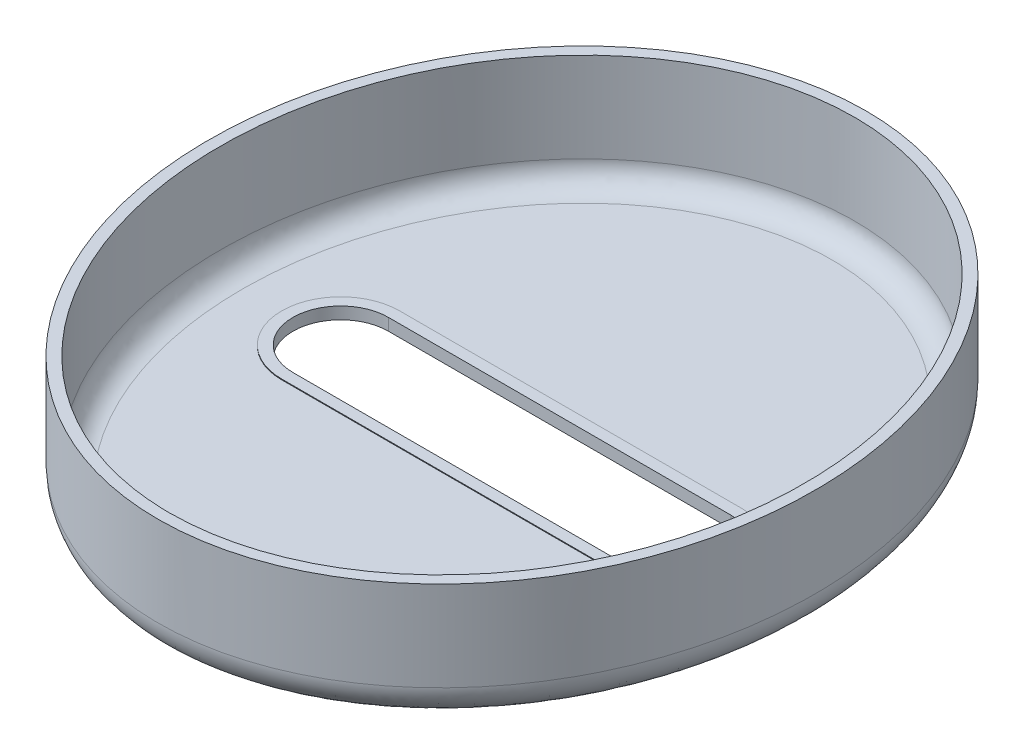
ISO-10303-21;
HEADER;
FILE_DESCRIPTION(('STEP AP214'),'2;1');
FILE_NAME('part.step','',(''),(''),'','','');
FILE_SCHEMA(('AUTOMOTIVE_DESIGN { 1 0 10303 214 1 1 1 1 }'));
ENDSEC;
DATA;
#1=APPLICATION_CONTEXT('core data for automotive mechanical design processes');
#2=APPLICATION_PROTOCOL_DEFINITION('international standard','automotive_design',2000,#1);
#3=PRODUCT_CONTEXT('',#1,'mechanical');
#4=PRODUCT('Part','Part','',(#3));
#5=PRODUCT_RELATED_PRODUCT_CATEGORY('part','',(#4));
#6=PRODUCT_DEFINITION_FORMATION('','',#4);
#7=PRODUCT_DEFINITION_CONTEXT('part definition',#1,'design');
#8=PRODUCT_DEFINITION('design','',#6,#7);
#9=PRODUCT_DEFINITION_SHAPE('','',#8);
#10=(LENGTH_UNIT() NAMED_UNIT(*) SI_UNIT(.MILLI.,.METRE.));
#11=(NAMED_UNIT(*) PLANE_ANGLE_UNIT() SI_UNIT($,.RADIAN.));
#12=(NAMED_UNIT(*) SI_UNIT($,.STERADIAN.) SOLID_ANGLE_UNIT());
#13=UNCERTAINTY_MEASURE_WITH_UNIT(LENGTH_MEASURE(1.E-05),#10,'distance_accuracy_value','');
#14=(GEOMETRIC_REPRESENTATION_CONTEXT(3) GLOBAL_UNCERTAINTY_ASSIGNED_CONTEXT((#13)) GLOBAL_UNIT_ASSIGNED_CONTEXT((#10,
#11,#12)) REPRESENTATION_CONTEXT('',''));
#15=CARTESIAN_POINT('',(0.,0.,0.));
#16=DIRECTION('',(0.,0.,1.));
#17=DIRECTION('',(1.,0.,0.));
#18=AXIS2_PLACEMENT_3D('',#15,#16,#17);
#19=CARTESIAN_POINT('',(0.,0.,0.));
#20=DIRECTION('',(0.,1.,0.));
#21=DIRECTION('',(0.,0.,1.));
#22=AXIS2_PLACEMENT_3D('',#19,#20,#21);
#23=PLANE('',#22);
#24=DIRECTION('',(-1.,0.,0.));
#25=VECTOR('',#24,1.);
#26=CARTESIAN_POINT('',(-2.59807621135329,0.,11.6222931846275));
#27=LINE('',#26,#25);
#28=CARTESIAN_POINT('',(-2.59807621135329,0.,11.6222931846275));
#29=VERTEX_POINT('',#28);
#30=CARTESIAN_POINT('',(-7.79422863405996,0.,11.6222931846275));
#31=VERTEX_POINT('',#30);
#32=EDGE_CURVE('E77',#29,#31,#27,.T.);
#33=ORIENTED_EDGE('',*,*,#32,.T.);
#34=DIRECTION('',(0.500000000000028,0.,0.866025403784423));
#35=VECTOR('',#34,1.);
#36=CARTESIAN_POINT('',(-7.79422863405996,0.,11.6222931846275));
#37=LINE('',#36,#35);
#38=CARTESIAN_POINT('',(-5.19615242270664,0.,16.1222931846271));
#39=VERTEX_POINT('',#38);
#40=EDGE_CURVE('E273',#31,#39,#37,.T.);
#41=ORIENTED_EDGE('',*,*,#40,.T.);
#42=DIRECTION('',(1.,0.,0.));
#43=VECTOR('',#42,1.);
#44=CARTESIAN_POINT('',(-5.19615242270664,0.,16.1222931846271));
#45=LINE('',#44,#43);
#46=CARTESIAN_POINT('',(-0.0665277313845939,0.,16.1222931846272));
#47=VERTEX_POINT('',#46);
#48=EDGE_CURVE('E270',#39,#47,#45,.T.);
#49=ORIENTED_EDGE('',*,*,#48,.T.);
#50=DIRECTION('',(0.500000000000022,0.,-0.866025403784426));
#51=VECTOR('',#50,1.);
#52=CARTESIAN_POINT('',(-0.0665277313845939,0.,16.1222931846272));
#53=LINE('',#52,#51);
#54=CARTESIAN_POINT('',(-0.0332638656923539,0.,16.0646784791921));
#55=VERTEX_POINT('',#54);
#56=EDGE_CURVE('E266',#47,#55,#53,.T.);
#57=ORIENTED_EDGE('',*,*,#56,.T.);
#58=DIRECTION('',(0.5,0.,0.866025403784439));
#59=VECTOR('',#58,1.);
#60=CARTESIAN_POINT('',(-2.59807621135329,0.,11.6222931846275));
#61=LINE('',#60,#59);
#62=EDGE_CURVE('E263',#29,#55,#61,.T.);
#63=ORIENTED_EDGE('',*,*,#62,.F.);
#64=EDGE_LOOP('',(#33,#41,#49,#57,#63));
#65=FACE_BOUND('',#64,.T.);
#66=CARTESIAN_POINT('',(-15.25,0.,0.));
#67=DIRECTION('',(0.,1.,0.));
#68=DIRECTION('',(0.,0.,1.));
#69=AXIS2_PLACEMENT_3D('',#66,#67,#68);
#70=CIRCLE('',#69,4.25);
#71=CARTESIAN_POINT('',(-15.25,0.,-4.25));
#72=VERTEX_POINT('',#71);
#73=CARTESIAN_POINT('',(-15.25,0.,4.25));
#74=VERTEX_POINT('',#73);
#75=EDGE_CURVE('E376',#72,#74,#70,.T.);
#76=ORIENTED_EDGE('',*,*,#75,.T.);
#77=DIRECTION('',(1.,0.,0.));
#78=VECTOR('',#77,1.);
#79=CARTESIAN_POINT('',(-15.25,0.,4.25));
#80=LINE('',#79,#78);
#81=CARTESIAN_POINT('',(15.25,0.,4.25));
#82=VERTEX_POINT('',#81);
#83=EDGE_CURVE('E382',#74,#82,#80,.T.);
#84=ORIENTED_EDGE('',*,*,#83,.T.);
#85=CARTESIAN_POINT('',(15.25,0.,0.));
#86=DIRECTION('',(0.,-1.,0.));
#87=DIRECTION('',(0.,0.,-1.));
#88=AXIS2_PLACEMENT_3D('',#85,#86,#87);
#89=CIRCLE('',#88,4.25);
#90=CARTESIAN_POINT('',(15.25,0.,-4.25));
#91=VERTEX_POINT('',#90);
#92=EDGE_CURVE('E385',#91,#82,#89,.T.);
#93=ORIENTED_EDGE('',*,*,#92,.F.);
#94=DIRECTION('',(1.,0.,0.));
#95=VECTOR('',#94,1.);
#96=CARTESIAN_POINT('',(-15.25,0.,-4.25));
#97=LINE('',#96,#95);
#98=EDGE_CURVE('E388',#72,#91,#97,.T.);
#99=ORIENTED_EDGE('',*,*,#98,.F.);
#100=EDGE_LOOP('',(#76,#84,#93,#99));
#101=FACE_BOUND('',#100,.T.);
#102=CARTESIAN_POINT('',(3.32786790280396,0.,-28.2237790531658));
#103=CARTESIAN_POINT('',(3.82146034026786,0.,-31.1828948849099));
#104=CARTESIAN_POINT('',(3.82146034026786,3.,-31.1828948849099));
#105=CARTESIAN_POINT('',(2.73134909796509,0.,-28.3232849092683));
#106=CARTESIAN_POINT('',(3.13719519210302,0.,-31.297038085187));
#107=CARTESIAN_POINT('',(3.13719519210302,3.,-31.297038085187));
#108=CARTESIAN_POINT('',(2.13043339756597,0.,-28.3962141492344));
#109=CARTESIAN_POINT('',(2.44729713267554,0.,-31.3807861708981));
#110=CARTESIAN_POINT('',(2.44729713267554,3.,-31.3807861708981));
#111=CARTESIAN_POINT('',(0.92450201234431,0.,-28.487839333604));
#112=CARTESIAN_POINT('',(1.0622304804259,0.,-31.4860213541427));
#113=CARTESIAN_POINT('',(1.0622304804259,3.,-31.4860213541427));
#114=CARTESIAN_POINT('',(0.319486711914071,0.,-28.506540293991));
#115=CARTESIAN_POINT('',(0.367062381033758,0.,-31.5075142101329));
#116=CARTESIAN_POINT('',(0.367062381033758,3.,-31.5075142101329));
#117=CARTESIAN_POINT('',(-0.889564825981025,0.,-28.4894260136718));
#118=CARTESIAN_POINT('',(-1.02204315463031,0.,-31.4878513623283));
#119=CARTESIAN_POINT('',(-1.02204315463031,3.,-31.4878513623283));
#120=CARTESIAN_POINT('',(-1.49360131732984,0.,-28.4536284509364));
#121=CARTESIAN_POINT('',(-1.7159809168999,0.,-31.4467159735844));
#122=CARTESIAN_POINT('',(-1.7159809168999,3.,-31.4467159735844));
#123=CARTESIAN_POINT('',(-2.69603399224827,0.,-28.3281035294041));
#124=CARTESIAN_POINT('',(-3.09661690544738,0.,-31.30258818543));
#125=CARTESIAN_POINT('',(-3.09661690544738,3.,-31.30258818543));
#126=CARTESIAN_POINT('',(-3.29443025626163,0.,-28.2383769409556));
#127=CARTESIAN_POINT('',(-3.78331523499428,0.,-31.1995966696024));
#128=CARTESIAN_POINT('',(-3.78331523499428,3.,-31.1995966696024));
#129=CARTESIAN_POINT('',(-4.44531250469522,0.,-28.0133215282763));
#130=CARTESIAN_POINT('',(-5.10273207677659,0.,-30.9415850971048));
#131=CARTESIAN_POINT('',(-5.10273207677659,3.,-30.9415850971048));
#132=CARTESIAN_POINT('',(-4.99840002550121,0.,-27.8810493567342));
#133=CARTESIAN_POINT('',(-5.73621852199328,0.,-30.7900546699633));
#134=CARTESIAN_POINT('',(-5.73621852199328,3.,-30.7900546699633));
#135=CARTESIAN_POINT('',(-6.09187018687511,0.,-27.5717608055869));
#136=CARTESIAN_POINT('',(-6.98708067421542,0.,-30.4362480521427));
#137=CARTESIAN_POINT('',(-6.98708067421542,3.,-30.4362480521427));
#138=CARTESIAN_POINT('',(-6.63225352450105,0.,-27.3947468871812));
#139=CARTESIAN_POINT('',(-7.60445726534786,0.,-30.2339746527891));
#140=CARTESIAN_POINT('',(-7.60445726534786,3.,-30.2339746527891));
#141=CARTESIAN_POINT('',(-7.69714435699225,0.,-26.998099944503));
#142=CARTESIAN_POINT('',(-8.81924785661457,0.,-29.781494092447));
#143=CARTESIAN_POINT('',(-8.81924785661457,3.,-29.781494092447));
#144=CARTESIAN_POINT('',(-8.22165101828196,0.,-26.7784646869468));
#145=CARTESIAN_POINT('',(-9.4166608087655,0.,-29.5312844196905));
#146=CARTESIAN_POINT('',(-9.4166608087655,3.,-29.5312844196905));
#147=CARTESIAN_POINT('',(-9.25197105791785,0.,-26.2990468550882));
#148=CARTESIAN_POINT('',(-10.5882214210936,0.,-28.9861464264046));
#149=CARTESIAN_POINT('',(-10.5882214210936,3.,-28.9861464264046));
#150=CARTESIAN_POINT('',(-9.75778354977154,0.,-26.0392623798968));
#151=CARTESIAN_POINT('',(-11.1623679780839,0.,-28.6912159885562));
#152=CARTESIAN_POINT('',(-11.1623679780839,3.,-28.6912159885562));
#153=CARTESIAN_POINT('',(-10.7743096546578,0.,-25.4676185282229));
#154=CARTESIAN_POINT('',(-12.3141540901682,0.,-28.0435090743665));
#155=CARTESIAN_POINT('',(-12.3141540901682,3.,-28.0435090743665));
#156=CARTESIAN_POINT('',(-11.2838883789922,0.,-25.153742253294));
#157=CARTESIAN_POINT('',(-12.890396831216,0.,-27.6885096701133));
#158=CARTESIAN_POINT('',(-12.890396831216,3.,-27.6885096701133));
#159=CARTESIAN_POINT('',(-12.2773888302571,0.,-24.4877777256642));
#160=CARTESIAN_POINT('',(-14.0116913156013,0.,-26.9368825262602));
#161=CARTESIAN_POINT('',(-14.0116913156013,3.,-26.9368825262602));
#162=CARTESIAN_POINT('',(-12.7613099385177,0.,-24.1356885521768));
#163=CARTESIAN_POINT('',(-14.556742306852,0.,-26.5402537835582));
#164=CARTESIAN_POINT('',(-14.556742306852,3.,-26.5402537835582));
#165=CARTESIAN_POINT('',(-13.701734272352,0.,-23.3965640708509));
#166=CARTESIAN_POINT('',(-15.6139206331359,0.,-25.7093671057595));
#167=CARTESIAN_POINT('',(-15.6139206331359,3.,-25.7093671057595));
#168=CARTESIAN_POINT('',(-14.1582341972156,0.,-23.0095245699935));
#169=CARTESIAN_POINT('',(-16.1260440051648,0.,-25.2751046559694));
#170=CARTESIAN_POINT('',(-16.1260440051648,3.,-25.2751046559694));
#171=CARTESIAN_POINT('',(-15.0425010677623,0.,-22.2036609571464));
#172=CARTESIAN_POINT('',(-17.1162016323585,0.,-24.3727391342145));
#173=CARTESIAN_POINT('',(-17.1162016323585,3.,-24.3727391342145));
#174=CARTESIAN_POINT('',(-15.4702572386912,0.,-21.7848250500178));
#175=CARTESIAN_POINT('',(-17.5942231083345,0.,-23.9046235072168));
#176=CARTESIAN_POINT('',(-17.5942231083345,3.,-23.9046235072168));
#177=CARTESIAN_POINT('',(-16.3490233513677,0.,-20.86279771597));
#178=CARTESIAN_POINT('',(-18.5745076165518,0.,-22.8760808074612));
#179=CARTESIAN_POINT('',(-18.5745076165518,3.,-22.8760808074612));
#180=CARTESIAN_POINT('',(-16.7959278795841,0.,-20.3556907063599));
#181=CARTESIAN_POINT('',(-19.0719580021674,0.,-22.3115311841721));
#182=CARTESIAN_POINT('',(-19.0719580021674,3.,-22.3115311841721));
#183=CARTESIAN_POINT('',(-17.6506078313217,0.,-19.3092813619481));
#184=CARTESIAN_POINT('',(-20.0215515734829,0.,-21.1489163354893));
#185=CARTESIAN_POINT('',(-20.0215515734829,3.,-21.1489163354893));
#186=CARTESIAN_POINT('',(-18.0583685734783,0.,-18.7699670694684));
#187=CARTESIAN_POINT('',(-20.4736777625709,0.,-20.5508386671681));
#188=CARTESIAN_POINT('',(-20.4736777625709,3.,-20.5508386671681));
#189=CARTESIAN_POINT('',(-18.8339916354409,0.,-17.6631848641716));
#190=CARTESIAN_POINT('',(-21.3322577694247,0.,-19.3256804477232));
#191=CARTESIAN_POINT('',(-21.3322577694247,3.,-19.3256804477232));
#192=CARTESIAN_POINT('',(-19.201842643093,0.,-17.095709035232));
#193=CARTESIAN_POINT('',(-21.7386986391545,0.,-18.6985917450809));
#194=CARTESIAN_POINT('',(-21.7386986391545,3.,-18.6985917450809));
#195=CARTESIAN_POINT('',(-19.8970506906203,0.,-15.9365636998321));
#196=CARTESIAN_POINT('',(-22.5057024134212,0.,-17.419738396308));
#197=CARTESIAN_POINT('',(-22.5057024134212,3.,-17.419738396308));
#198=CARTESIAN_POINT('',(-20.2244091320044,0.,-15.3448950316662));
#199=CARTESIAN_POINT('',(-22.8662669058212,0.,-16.7679746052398));
#200=CARTESIAN_POINT('',(-22.8662669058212,3.,-16.7679746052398));
#201=CARTESIAN_POINT('',(-20.8869781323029,0.,-14.0455948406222));
#202=CARTESIAN_POINT('',(-23.5951070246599,0.,-15.3387179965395));
#203=CARTESIAN_POINT('',(-23.5951070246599,3.,-15.3387179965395));
#204=CARTESIAN_POINT('',(-21.2152491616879,0.,-13.3344175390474));
#205=CARTESIAN_POINT('',(-23.9555910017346,0.,-14.5576373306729));
#206=CARTESIAN_POINT('',(-23.9555910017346,3.,-14.5576373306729));
#207=CARTESIAN_POINT('',(-21.8171364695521,0.,-11.8890678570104));
#208=CARTESIAN_POINT('',(-24.6157385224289,0.,-12.972382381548));
#209=CARTESIAN_POINT('',(-24.6157385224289,3.,-12.972382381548));
#210=CARTESIAN_POINT('',(-22.0907316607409,0.,-11.1548867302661));
#211=CARTESIAN_POINT('',(-24.9153786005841,0.,-12.1681993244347));
#212=CARTESIAN_POINT('',(-24.9153786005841,3.,-12.1681993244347));
#213=CARTESIAN_POINT('',(-22.5832120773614,0.,-9.66813085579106));
#214=CARTESIAN_POINT('',(-25.4542238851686,0.,-10.5414744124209));
#215=CARTESIAN_POINT('',(-25.4542238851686,3.,-10.5414744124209));
#216=CARTESIAN_POINT('',(-22.8020803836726,0.,-8.91555049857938));
#217=CARTESIAN_POINT('',(-25.6934104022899,0.,-9.71892696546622));
#218=CARTESIAN_POINT('',(-25.6934104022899,3.,-9.71892696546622));
#219=CARTESIAN_POINT('',(-23.1850310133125,0.,-7.39682306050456));
#220=CARTESIAN_POINT('',(-26.1116081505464,0.,-8.06040137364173));
#221=CARTESIAN_POINT('',(-26.1116081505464,3.,-8.06040137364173));
#222=CARTESIAN_POINT('',(-23.3491164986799,0.,-6.63067676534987));
#223=CARTESIAN_POINT('',(-26.2906228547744,0.,-7.22442400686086));
#224=CARTESIAN_POINT('',(-26.2906228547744,3.,-7.22442400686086));
#225=CARTESIAN_POINT('',(-23.7965307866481,0.,-4.10810926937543));
#226=CARTESIAN_POINT('',(-26.7785440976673,0.,-4.47358145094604));
#227=CARTESIAN_POINT('',(-26.7785440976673,3.,-4.47358145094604));
#228=CARTESIAN_POINT('',(-23.9664753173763,0.,-2.3303018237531));
#229=CARTESIAN_POINT('',(-26.9634950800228,0.,-2.53747281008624));
#230=CARTESIAN_POINT('',(-26.9634950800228,3.,-2.53747281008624));
#231=CARTESIAN_POINT('',(-24.024571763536,0.,1.23096797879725));
#232=CARTESIAN_POINT('',(-27.0267561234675,0.,1.34041530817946));
#233=CARTESIAN_POINT('',(-27.0267561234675,3.,1.34041530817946));
#234=CARTESIAN_POINT('',(-23.9125218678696,0.,3.01443347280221));
#235=CARTESIAN_POINT('',(-26.904846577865,0.,3.28219785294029));
#236=CARTESIAN_POINT('',(-26.904846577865,3.,3.28219785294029));
#237=CARTESIAN_POINT('',(-23.5251938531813,0.,5.71298229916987));
#238=CARTESIAN_POINT('',(-26.4826591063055,0.,6.22347841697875));
#239=CARTESIAN_POINT('',(-26.4826591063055,3.,6.22347841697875));
#240=CARTESIAN_POINT('',(-23.3509709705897,0.,6.64347954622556));
#241=CARTESIAN_POINT('',(-26.2926926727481,0.,7.23826737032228));
#242=CARTESIAN_POINT('',(-26.2926926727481,3.,7.23826737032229));
#243=CARTESIAN_POINT('',(-22.9226386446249,0.,8.48627192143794));
#244=CARTESIAN_POINT('',(-25.8251309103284,0.,9.24985190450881));
#245=CARTESIAN_POINT('',(-25.8251309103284,3.,9.24985190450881));
#246=CARTESIAN_POINT('',(-22.6685206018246,0.,9.39856507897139));
#247=CARTESIAN_POINT('',(-25.5475261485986,0.,10.2466455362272));
#248=CARTESIAN_POINT('',(-25.5475261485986,3.,10.2466455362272));
#249=CARTESIAN_POINT('',(-22.0805876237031,0.,11.1960957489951));
#250=CARTESIAN_POINT('',(-24.9043125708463,0.,12.213186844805));
#251=CARTESIAN_POINT('',(-24.9043125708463,3.,12.213186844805));
#252=CARTESIAN_POINT('',(-21.7468523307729,0.,12.0813593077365));
#253=CARTESIAN_POINT('',(-24.5387916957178,0.,13.1829604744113));
#254=CARTESIAN_POINT('',(-24.5387916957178,3.,13.1829604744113));
#255=CARTESIAN_POINT('',(-20.9994051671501,0.,13.817919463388));
#256=CARTESIAN_POINT('',(-23.7186469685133,0.,15.088423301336));
#257=CARTESIAN_POINT('',(-23.7186469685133,3.,15.088423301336));
#258=CARTESIAN_POINT('',(-20.5856735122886,0.,14.6692075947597));
#259=CARTESIAN_POINT('',(-23.2640010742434,0.,16.0241039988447));
#260=CARTESIAN_POINT('',(-23.2640010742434,3.,16.0241039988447));
#261=CARTESIAN_POINT('',(-19.7704514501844,0.,16.1605539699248));
#262=CARTESIAN_POINT('',(-22.3661639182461,0.,17.6665802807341));
#263=CARTESIAN_POINT('',(-22.3661639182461,3.,17.6665802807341));
#264=CARTESIAN_POINT('',(-19.3833892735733,0.,16.8085283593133));
#265=CARTESIAN_POINT('',(-21.9392313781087,0.,18.3814127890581));
#266=CARTESIAN_POINT('',(-21.9392313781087,3.,18.3814127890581));
#267=CARTESIAN_POINT('',(-18.5591743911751,0.,18.0717388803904));
#268=CARTESIAN_POINT('',(-21.028309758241,0.,19.777512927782));
#269=CARTESIAN_POINT('',(-21.028309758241,3.,19.777512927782));
#270=CARTESIAN_POINT('',(-18.1220296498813,0.,18.686980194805));
#271=CARTESIAN_POINT('',(-20.5443297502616,0.,20.4587858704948));
#272=CARTESIAN_POINT('',(-20.5443297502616,3.,20.4587858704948));
#273=CARTESIAN_POINT('',(-17.1983499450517,0.,19.8794054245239));
#274=CARTESIAN_POINT('',(-19.5194254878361,0.,21.7818870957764));
#275=CARTESIAN_POINT('',(-19.5194254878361,3.,21.7818870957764));
#276=CARTESIAN_POINT('',(-16.7118156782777,0.,20.4565898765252));
#277=CARTESIAN_POINT('',(-18.9785020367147,0.,22.423715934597));
#278=CARTESIAN_POINT('',(-18.9785020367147,3.,22.423715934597));
#279=CARTESIAN_POINT('',(-15.9462153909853,0.,21.289158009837));
#280=CARTESIAN_POINT('',(-18.1252674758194,0.,23.3515821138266));
#281=CARTESIAN_POINT('',(-18.1252674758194,3.,23.3515821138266));
#282=CARTESIAN_POINT('',(-15.6850398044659,0.,21.5611542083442));
#283=CARTESIAN_POINT('',(-17.8338709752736,0.,23.6550672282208));
#284=CARTESIAN_POINT('',(-17.8338709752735,3.,23.6550672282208));
#285=CARTESIAN_POINT('',(-15.1508434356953,0.,22.0934678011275));
#286=CARTESIAN_POINT('',(-17.2371396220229,0.,24.2496955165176));
#287=CARTESIAN_POINT('',(-17.2371396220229,3.,24.2496955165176));
#288=CARTESIAN_POINT('',(-14.8778179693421,0.,22.3537804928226));
#289=CARTESIAN_POINT('',(-16.9317992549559,0.,24.5408337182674));
#290=CARTESIAN_POINT('',(-16.9317992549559,3.,24.5408337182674));
#291=CARTESIAN_POINT('',(-14.0368624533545,0.,23.1200580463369));
#292=CARTESIAN_POINT('',(-15.9901350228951,0.,25.3988779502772));
#293=CARTESIAN_POINT('',(-15.9901350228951,3.,25.3988779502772));
#294=CARTESIAN_POINT('',(-13.4511921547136,0.,23.6068409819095));
#295=CARTESIAN_POINT('',(-15.3327777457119,0.,25.9453734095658));
#296=CARTESIAN_POINT('',(-15.3327777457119,3.,25.9453734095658));
#297=CARTESIAN_POINT('',(-12.236253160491,0.,24.5223482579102));
#298=CARTESIAN_POINT('',(-13.9655222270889,0.,26.9756556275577));
#299=CARTESIAN_POINT('',(-13.9655222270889,3.,26.9756556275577));
#300=CARTESIAN_POINT('',(-11.6069913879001,0.,24.9510817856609));
#301=CARTESIAN_POINT('',(-13.2556323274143,0.,27.4594523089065));
#302=CARTESIAN_POINT('',(-13.2556323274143,3.,27.4594523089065));
#303=CARTESIAN_POINT('',(-10.3095790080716,0.,25.7433995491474));
#304=CARTESIAN_POINT('',(-11.7881825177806,0.,28.3556092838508));
#305=CARTESIAN_POINT('',(-11.7881825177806,3.,28.3556092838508));
#306=CARTESIAN_POINT('',(-9.64147433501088,0.,26.1070587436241));
#307=CARTESIAN_POINT('',(-11.0306788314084,0.,28.7680517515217));
#308=CARTESIAN_POINT('',(-11.0306788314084,3.,28.7680517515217));
#309=CARTESIAN_POINT('',(-8.27123936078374,0.,26.7631715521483));
#310=CARTESIAN_POINT('',(-9.47336569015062,0.,29.5137406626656));
#311=CARTESIAN_POINT('',(-9.47336569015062,3.,29.5137406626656));
#312=CARTESIAN_POINT('',(-7.56912000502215,0.,27.0556478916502));
#313=CARTESIAN_POINT('',(-8.67356983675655,0.,29.8470123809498));
#314=CARTESIAN_POINT('',(-8.67356983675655,3.,29.8470123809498));
#315=CARTESIAN_POINT('',(-6.30425870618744,0.,27.5044896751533));
#316=CARTESIAN_POINT('',(-7.22982696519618,0.,30.3593315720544));
#317=CARTESIAN_POINT('',(-7.22982696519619,3.,30.3593315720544));
#318=CARTESIAN_POINT('',(-5.74708937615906,0.,27.6766907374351));
#319=CARTESIAN_POINT('',(-6.59290668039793,0.,30.5562206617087));
#320=CARTESIAN_POINT('',(-6.59290668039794,3.,30.5562206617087));
#321=CARTESIAN_POINT('',(-4.62027441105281,0.,27.9735826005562));
#322=CARTESIAN_POINT('',(-5.30320841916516,0.,30.8960281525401));
#323=CARTESIAN_POINT('',(-5.30320841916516,3.,30.8960281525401));
#324=CARTESIAN_POINT('',(-4.05063112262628,0.,28.0982822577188));
#325=CARTESIAN_POINT('',(-4.65043342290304,0.,31.0389566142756));
#326=CARTESIAN_POINT('',(-4.65043342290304,3.,31.0389566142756));
#327=CARTESIAN_POINT('',(-2.90301959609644,0.,28.29844776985));
#328=CARTESIAN_POINT('',(-3.33420052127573,0.,31.2685325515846));
#329=CARTESIAN_POINT('',(-3.33420052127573,3.,31.2685325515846));
#330=CARTESIAN_POINT('',(-2.32505528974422,0.,28.373936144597));
#331=CARTESIAN_POINT('',(-2.67074764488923,0.,31.3552057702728));
#332=CARTESIAN_POINT('',(-2.67074764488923,3.,31.3552057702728));
#333=CARTESIAN_POINT('',(-1.16472832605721,0.,28.4747134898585));
#334=CARTESIAN_POINT('',(-1.33819768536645,0.,31.4709409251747));
#335=CARTESIAN_POINT('',(-1.33819768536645,3.,31.4709409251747));
#336=CARTESIAN_POINT('',(-0.582365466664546,0.,28.500000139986));
#337=CARTESIAN_POINT('',(-0.669100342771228,0.,31.5000001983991));
#338=CARTESIAN_POINT('',(-0.669100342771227,3.,31.5000001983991));
#339=CARTESIAN_POINT('',(0.587898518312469,0.,28.499999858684));
#340=CARTESIAN_POINT('',(0.675457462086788,0.,31.4999997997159));
#341=CARTESIAN_POINT('',(0.675457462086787,3.,31.4999997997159));
#342=CARTESIAN_POINT('',(1.17579969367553,0.,28.4742301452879));
#343=CARTESIAN_POINT('',(1.35091798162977,0.,31.4703853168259));
#344=CARTESIAN_POINT('',(1.35091798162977,3.,31.4703853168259));
#345=CARTESIAN_POINT('',(2.34710426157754,0.,28.3715291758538));
#346=CARTESIAN_POINT('',(2.69606347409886,0.,31.3524420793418));
#347=CARTESIAN_POINT('',(2.69606347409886,3.,31.3524420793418));
#348=CARTESIAN_POINT('',(2.93050765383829,0.,28.2945979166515));
#349=CARTESIAN_POINT('',(3.36574844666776,0.,31.264113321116));
#350=CARTESIAN_POINT('',(3.36574844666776,3.,31.264113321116));
#351=CARTESIAN_POINT('',(4.08859119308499,0.,28.0906614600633));
#352=CARTESIAN_POINT('',(4.69394889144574,0.,31.0302199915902));
#353=CARTESIAN_POINT('',(4.69394889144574,3.,31.0302199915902));
#354=CARTESIAN_POINT('',(4.66326964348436,0.,27.9636466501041));
#355=CARTESIAN_POINT('',(5.35246219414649,0.,30.8846444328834));
#356=CARTESIAN_POINT('',(5.35246219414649,3.,30.8846444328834));
#357=CARTESIAN_POINT('',(5.79974822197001,0.,27.6613010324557));
#358=CARTESIAN_POINT('',(6.65313012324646,0.,30.5386188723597));
#359=CARTESIAN_POINT('',(6.65313012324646,3.,30.5386188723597));
#360=CARTESIAN_POINT('',(6.36154826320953,0.,27.4859698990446));
#361=CARTESIAN_POINT('',(7.29528463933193,0.,30.3381685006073));
#362=CARTESIAN_POINT('',(7.29528463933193,3.,30.3381685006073));
#363=CARTESIAN_POINT('',(7.46676990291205,0.,27.0899514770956));
#364=CARTESIAN_POINT('',(8.55667163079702,0.,29.8861941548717));
#365=CARTESIAN_POINT('',(8.55667163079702,3.,29.8861941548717));
#366=CARTESIAN_POINT('',(8.01024668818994,0.,26.8694178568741));
#367=CARTESIAN_POINT('',(9.17597359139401,0.,29.6348432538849));
#368=CARTESIAN_POINT('',(9.17597359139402,3.,29.6348432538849));
#369=CARTESIAN_POINT('',(9.07763464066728,0.,26.3853103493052));
#370=CARTESIAN_POINT('',(10.3901961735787,0.,29.0841402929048));
#371=CARTESIAN_POINT('',(10.3901961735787,3.,29.0841402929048));
#372=CARTESIAN_POINT('',(9.60154593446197,0.,26.1217367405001));
#373=CARTESIAN_POINT('',(10.9851169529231,0.,28.7847885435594));
#374=CARTESIAN_POINT('',(10.9851169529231,3.,28.7847885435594));
#375=CARTESIAN_POINT('',(10.6271182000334,0.,25.554492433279));
#376=CARTESIAN_POINT('',(12.1475479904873,0.,28.141848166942));
#377=CARTESIAN_POINT('',(12.1475479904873,3.,28.141848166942));
#378=CARTESIAN_POINT('',(11.1287802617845,0.,25.250823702));
#379=CARTESIAN_POINT('',(12.7150595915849,0.,27.798261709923));
#380=CARTESIAN_POINT('',(12.7150595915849,3.,27.798261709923));
#381=CARTESIAN_POINT('',(12.1078621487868,0.,24.6063443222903));
#382=CARTESIAN_POINT('',(13.8205571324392,0.,27.070569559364));
#383=CARTESIAN_POINT('',(13.8205571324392,3.,27.070569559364));
#384=CARTESIAN_POINT('',(12.585272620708,0.,24.2655195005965));
#385=CARTESIAN_POINT('',(14.3585316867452,0.,26.6864484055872));
#386=CARTESIAN_POINT('',(14.3585316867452,3.,26.6864484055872));
#387=CARTESIAN_POINT('',(13.5482049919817,0.,23.5234809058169));
#388=CARTESIAN_POINT('',(15.4415642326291,0.,25.8518613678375));
#389=CARTESIAN_POINT('',(15.4415642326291,3.,25.8518613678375));
#390=CARTESIAN_POINT('',(14.0317244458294,0.,23.1196665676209));
#391=CARTESIAN_POINT('',(15.984213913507,0.,25.3985911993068));
#392=CARTESIAN_POINT('',(15.984213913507,3.,25.3985911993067));
#393=CARTESIAN_POINT('',(14.9669650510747,0.,22.2766477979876));
#394=CARTESIAN_POINT('',(17.0317578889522,0.,24.4543410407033));
#395=CARTESIAN_POINT('',(17.0317578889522,3.,24.4543410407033));
#396=CARTESIAN_POINT('',(15.4186746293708,0.,21.8374306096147));
#397=CARTESIAN_POINT('',(17.5366384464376,0.,23.9633474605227));
#398=CARTESIAN_POINT('',(17.5366384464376,3.,23.9633474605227));
#399=CARTESIAN_POINT('',(16.7239729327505,0.,20.4722717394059));
#400=CARTESIAN_POINT('',(18.9928546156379,0.,22.4403621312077));
#401=CARTESIAN_POINT('',(18.9928546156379,3.,22.4403621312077));
#402=CARTESIAN_POINT('',(17.5281926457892,0.,19.4984624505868));
#403=CARTESIAN_POINT('',(19.8862829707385,0.,21.3579601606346));
#404=CARTESIAN_POINT('',(19.8862829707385,3.,21.3579601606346));
#405=CARTESIAN_POINT('',(19.1079818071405,0.,17.2977565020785));
#406=CARTESIAN_POINT('',(21.6360228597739,0.,18.9205208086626));
#407=CARTESIAN_POINT('',(21.6360228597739,3.,18.9205208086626));
#408=CARTESIAN_POINT('',(19.8610461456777,0.,16.0548238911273));
#409=CARTESIAN_POINT('',(22.4665374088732,0.,17.5489640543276));
#410=CARTESIAN_POINT('',(22.4665374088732,3.,17.5489640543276));
#411=CARTESIAN_POINT('',(21.1801233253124,0.,13.4733214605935));
#412=CARTESIAN_POINT('',(23.9175950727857,0.,14.7091531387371));
#413=CARTESIAN_POINT('',(23.9175950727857,3.,14.7091531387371));
#414=CARTESIAN_POINT('',(21.7460253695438,0.,12.1346955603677));
#415=CARTESIAN_POINT('',(24.5380138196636,0.,13.2408423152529));
#416=CARTESIAN_POINT('',(24.5380138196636,3.,13.2408423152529));
#417=CARTESIAN_POINT('',(22.7627401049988,0.,9.18148031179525));
#418=CARTESIAN_POINT('',(25.6508428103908,0.,10.0084704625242));
#419=CARTESIAN_POINT('',(25.6508428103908,3.,10.0084704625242));
#420=CARTESIAN_POINT('',(23.1823682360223,0.,7.55615824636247));
#421=CARTESIAN_POINT('',(26.1087819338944,0.,8.23370794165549));
#422=CARTESIAN_POINT('',(26.1087819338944,3.,8.23370794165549));
#423=CARTESIAN_POINT('',(23.7721161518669,0.,4.25999473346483));
#424=CARTESIAN_POINT('',(26.7519155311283,0.,4.63916027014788));
#425=CARTESIAN_POINT('',(26.7519155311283,3.,4.63916027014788));
#426=CARTESIAN_POINT('',(23.9421075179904,0.,2.58913030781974));
#427=CARTESIAN_POINT('',(26.9369696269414,0.,2.81935243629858));
#428=CARTESIAN_POINT('',(26.9369696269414,3.,2.81935243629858));
#429=CARTESIAN_POINT('',(24.0127335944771,0.,-0.0102903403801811));
#430=CARTESIAN_POINT('',(27.013860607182,0.,-0.0112294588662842));
#431=CARTESIAN_POINT('',(27.013860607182,3.,-0.0112294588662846));
#432=CARTESIAN_POINT('',(23.9997225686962,0.,-0.9373304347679));
#433=CARTESIAN_POINT('',(26.9997004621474,0.,-1.0205999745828));
#434=CARTESIAN_POINT('',(26.9997004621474,3.,-1.0205999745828));
#435=CARTESIAN_POINT('',(23.8973913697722,0.,-2.78756822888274));
#436=CARTESIAN_POINT('',(26.8882598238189,0.,-3.03559922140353));
#437=CARTESIAN_POINT('',(26.8882598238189,3.,-3.03559922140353));
#438=CARTESIAN_POINT('',(23.8080569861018,0.,-3.71076518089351));
#439=CARTESIAN_POINT('',(26.7909638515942,0.,-4.04122722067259));
#440=CARTESIAN_POINT('',(26.7909638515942,3.,-4.04122722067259));
#441=CARTESIAN_POINT('',(23.5528290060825,0.,-5.54727258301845));
#442=CARTESIAN_POINT('',(26.5127940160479,0.,-6.04280925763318));
#443=CARTESIAN_POINT('',(26.5127940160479,3.,-6.04280925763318));
#444=CARTESIAN_POINT('',(23.3868720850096,0.,-6.46057421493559));
#445=CARTESIAN_POINT('',(26.3318510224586,0.,-7.03875459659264));
#446=CARTESIAN_POINT('',(26.3318510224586,3.,-7.03875459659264));
#447=CARTESIAN_POINT('',(22.9783156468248,0.,-8.26950818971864));
#448=CARTESIAN_POINT('',(25.8859321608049,0.,-9.01311693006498));
#449=CARTESIAN_POINT('',(25.8859321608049,3.,-9.01311693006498));
#450=CARTESIAN_POINT('',(22.7357498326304,0.,-9.16514811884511));
#451=CARTESIAN_POINT('',(25.6209932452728,0.,-9.99154143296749));
#452=CARTESIAN_POINT('',(25.6209932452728,3.,-9.9915414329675));
#453=CARTESIAN_POINT('',(22.1704958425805,0.,-10.9424754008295));
#454=CARTESIAN_POINT('',(25.0027377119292,0.,-11.9355224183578));
#455=CARTESIAN_POINT('',(25.0027377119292,3.,-11.9355224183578));
#456=CARTESIAN_POINT('',(21.8468981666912,0.,-11.8238744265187));
#457=CARTESIAN_POINT('',(24.6484175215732,0.,-12.9007918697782));
#458=CARTESIAN_POINT('',(24.6484175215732,3.,-12.9007918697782));
#459=CARTESIAN_POINT('',(21.121007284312,0.,-13.5538678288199));
#460=CARTESIAN_POINT('',(23.852187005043,0.,-14.7984242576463));
#461=CARTESIAN_POINT('',(23.8521870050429,3.,-14.7984242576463));
#462=CARTESIAN_POINT('',(20.7187058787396,0.,-14.4024587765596));
#463=CARTESIAN_POINT('',(23.4102675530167,0.,-15.7307837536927));
#464=CARTESIAN_POINT('',(23.4102675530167,3.,-15.7307837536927));
#465=CARTESIAN_POINT('',(19.8363503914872,0.,-16.0568107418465));
#466=CARTESIAN_POINT('',(22.4389181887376,0.,-17.5519930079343));
#467=CARTESIAN_POINT('',(22.4389181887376,3.,-17.5519930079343));
#468=CARTESIAN_POINT('',(19.3564040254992,0.,-16.8626290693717));
#469=CARTESIAN_POINT('',(21.9096094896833,0.,-18.4409008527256));
#470=CARTESIAN_POINT('',(21.9096094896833,3.,-18.4409008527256));
#471=CARTESIAN_POINT('',(18.3193044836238,0.,-18.422847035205));
#472=CARTESIAN_POINT('',(20.7629440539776,0.,-20.1659514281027));
#473=CARTESIAN_POINT('',(20.7629440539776,3.,-20.1659514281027));
#474=CARTESIAN_POINT('',(17.7621799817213,0.,-19.1772656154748));
#475=CARTESIAN_POINT('',(20.1456200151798,0.,-21.0021135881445));
#476=CARTESIAN_POINT('',(20.1456200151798,3.,-21.0021135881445));
#477=CARTESIAN_POINT('',(16.7320424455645,0.,-20.4301589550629));
#478=CARTESIAN_POINT('',(19.0008913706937,0.,-22.3943727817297));
#479=CARTESIAN_POINT('',(19.0008913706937,3.,-22.3943727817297));
#480=CARTESIAN_POINT('',(16.2764802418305,0.,-20.9430566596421));
#481=CARTESIAN_POINT('',(18.4937020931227,0.,-22.9654881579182));
#482=CARTESIAN_POINT('',(18.4937020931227,3.,-22.9654881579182));
#483=CARTESIAN_POINT('',(15.3261602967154,0.,-21.9310907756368));
#484=CARTESIAN_POINT('',(17.4333393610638,0.,-24.06793285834));
#485=CARTESIAN_POINT('',(17.4333393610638,3.,-24.06793285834));
#486=CARTESIAN_POINT('',(14.8314113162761,0.,-22.4062355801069));
#487=CARTESIAN_POINT('',(16.880176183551,0.,-24.5992710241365));
#488=CARTESIAN_POINT('',(16.880176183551,3.,-24.5992710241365));
#489=CARTESIAN_POINT('',(13.8044818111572,0.,-23.31391927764));
#490=CARTESIAN_POINT('',(15.7293282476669,0.,-25.6164831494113));
#491=CARTESIAN_POINT('',(15.7293282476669,3.,-25.6164831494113));
#492=CARTESIAN_POINT('',(13.2723134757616,0.,-23.7464719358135));
#493=CARTESIAN_POINT('',(15.1316579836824,0.,-26.1023717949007));
#494=CARTESIAN_POINT('',(15.1316579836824,3.,-26.1023717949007));
#495=CARTESIAN_POINT('',(12.1726512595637,0.,-24.5642353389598));
#496=CARTESIAN_POINT('',(13.8937160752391,0.,-27.022966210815));
#497=CARTESIAN_POINT('',(13.8937160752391,3.,-27.022966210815));
#498=CARTESIAN_POINT('',(11.6051561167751,0.,-24.9494443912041));
#499=CARTESIAN_POINT('',(13.2534429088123,0.,-27.4576701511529));
#500=CARTESIAN_POINT('',(13.2534429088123,3.,-27.4576701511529));
#501=CARTESIAN_POINT('',(10.4337247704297,0.,-25.670076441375));
#502=CARTESIAN_POINT('',(11.9287012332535,0.,-28.2726134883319));
#503=CARTESIAN_POINT('',(11.9287012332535,3.,-28.2726134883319));
#504=CARTESIAN_POINT('',(9.8295580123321,0.,-26.0051257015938));
#505=CARTESIAN_POINT('',(11.2439506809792,0.,-28.6524433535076));
#506=CARTESIAN_POINT('',(11.2439506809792,3.,-28.6524433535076));
#507=CARTESIAN_POINT('',(8.59242441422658,0.,-26.617200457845));
#508=CARTESIAN_POINT('',(9.83872532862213,0.,-29.3476806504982));
#509=CARTESIAN_POINT('',(9.83872532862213,3.,-29.3476806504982));
#510=CARTESIAN_POINT('',(7.95945718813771,0.,-26.8942251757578));
#511=CARTESIAN_POINT('',(9.11825004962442,0.,-29.6630872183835));
#512=CARTESIAN_POINT('',(9.11825004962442,3.,-29.6630872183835));
#513=CARTESIAN_POINT('',(6.67001602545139,0.,-27.3855637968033));
#514=CARTESIAN_POINT('',(7.6477216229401,0.,-30.2234275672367));
#515=CARTESIAN_POINT('',(7.6477216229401,3.,-30.2234275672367));
#516=CARTESIAN_POINT('',(6.01355664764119,0.,-27.5999158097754));
#517=CARTESIAN_POINT('',(6.89768676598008,0.,-30.4684041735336));
#518=CARTESIAN_POINT('',(6.89768676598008,3.,-30.4684041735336));
#519=CARTESIAN_POINT('',(4.68259149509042,0.,-27.9622844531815));
#520=CARTESIAN_POINT('',(5.374693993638,0.,-30.8830525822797));
#521=CARTESIAN_POINT('',(5.374693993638,3.,-30.8830525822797));
#522=CARTESIAN_POINT('',(4.00808839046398,0.,-28.1103108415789));
#523=CARTESIAN_POINT('',(4.60173946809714,0.,-31.0527354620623));
#524=CARTESIAN_POINT('',(4.60173946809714,3.,-31.0527354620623));
#525=CARTESIAN_POINT('',(3.32786790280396,0.,-28.2237790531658));
#526=CARTESIAN_POINT('',(3.82146034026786,0.,-31.1828948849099));
#527=CARTESIAN_POINT('',(3.82146034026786,3.,-31.1828948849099));
#528=(BOUNDED_SURFACE() B_SPLINE_SURFACE(3,2,((#102,#103,#104),(#105,#106,#107),(#108,#109,
#110),(#111,#112,#113),(#114,#115,#116),(#117,#118,#119),(#120,#121,#122),(#123,#124,#125),
(#126,#127,#128),(#129,#130,#131),(#132,#133,#134),(#135,#136,#137),(#138,#139,#140),(#141,#142,
#143),(#144,#145,#146),(#147,#148,#149),(#150,#151,#152),(#153,#154,#155),(#156,#157,#158),
(#159,#160,#161),(#162,#163,#164),(#165,#166,#167),(#168,#169,#170),(#171,#172,#173),(#174,#175,
#176),(#177,#178,#179),(#180,#181,#182),(#183,#184,#185),(#186,#187,#188),(#189,#190,#191),
(#192,#193,#194),(#195,#196,#197),(#198,#199,#200),(#201,#202,#203),(#204,#205,#206),(#207,#208,
#209),(#210,#211,#212),(#213,#214,#215),(#216,#217,#218),(#219,#220,#221),(#222,#223,#224),
(#225,#226,#227),(#228,#229,#230),(#231,#232,#233),(#234,#235,#236),(#237,#238,#239),(#240,#241,
#242),(#243,#244,#245),(#246,#247,#248),(#249,#250,#251),(#252,#253,#254),(#255,#256,#257),
(#258,#259,#260),(#261,#262,#263),(#264,#265,#266),(#267,#268,#269),(#270,#271,#272),(#273,#274,
#275),(#276,#277,#278),(#279,#280,#281),(#282,#283,#284),(#285,#286,#287),(#288,#289,#290),
(#291,#292,#293),(#294,#295,#296),(#297,#298,#299),(#300,#301,#302),(#303,#304,#305),(#306,#307,
#308),(#309,#310,#311),(#312,#313,#314),(#315,#316,#317),(#318,#319,#320),(#321,#322,#323),
(#324,#325,#326),(#327,#328,#329),(#330,#331,#332),(#333,#334,#335),(#336,#337,#338),(#339,#340,
#341),(#342,#343,#344),(#345,#346,#347),(#348,#349,#350),(#351,#352,#353),(#354,#355,#356),
(#357,#358,#359),(#360,#361,#362),(#363,#364,#365),(#366,#367,#368),(#369,#370,#371),(#372,#373,
#374),(#375,#376,#377),(#378,#379,#380),(#381,#382,#383),(#384,#385,#386),(#387,#388,#389),
(#390,#391,#392),(#393,#394,#395),(#396,#397,#398),(#399,#400,#401),(#402,#403,#404),(#405,#406,
#407),(#408,#409,#410),(#411,#412,#413),(#414,#415,#416),(#417,#418,#419),(#420,#421,#422),
(#423,#424,#425),(#426,#427,#428),(#429,#430,#431),(#432,#433,#434),(#435,#436,#437),(#438,#439,
#440),(#441,#442,#443),(#444,#445,#446),(#447,#448,#449),(#450,#451,#452),(#453,#454,#455),
(#456,#457,#458),(#459,#460,#461),(#462,#463,#464),(#465,#466,#467),(#468,#469,#470),(#471,#472,
#473),(#474,#475,#476),(#477,#478,#479),(#480,#481,#482),(#483,#484,#485),(#486,#487,#488),
(#489,#490,#491),(#492,#493,#494),(#495,#496,#497),(#498,#499,#500),(#501,#502,#503),(#504,#505,
#506),(#507,#508,#509),(#510,#511,#512),(#513,#514,#515),(#516,#517,#518),(#519,#520,#521),
(#522,#523,#524),(#525,#526,#527)),.UNSPECIFIED.,.T.,.F.,.F.) B_SPLINE_SURFACE_WITH_KNOTS((4,2,
2,2,2,2,2,2,2,2,2,2,2,2,2,2,2,2,2,2,2,2,2,2,2,2,2,2,2,2,2,2,2,2,2,2,2,2,2,2,2,2,2,2,2,2,2,2,2,2,
2,2,2,2,2,2,2,2,2,2,2,2,2,2,2,2,2,2,2,2,4),(3,3),(0.,1.81360808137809,3.62704840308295,
5.43990061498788,7.2527269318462,8.95686398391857,10.6609073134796,12.3650399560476,
14.069253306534,15.8628689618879,17.6565278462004,19.4504022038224,21.2449452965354,
23.2707135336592,25.2972386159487,27.324336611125,29.3513644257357,31.6988319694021,
34.047203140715,36.3962994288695,38.7452601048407,44.078740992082,49.4160399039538,
52.2530385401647,55.0903426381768,57.9248203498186,60.7599999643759,63.0221246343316,
65.2838900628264,67.545623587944,68.6765633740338,69.8079543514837,72.0890589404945,
74.3698020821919,76.6479008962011,78.9252714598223,80.6728623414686,82.420127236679,
84.1665919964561,85.9131374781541,87.6762768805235,89.4394163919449,91.2028944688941,
92.9663844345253,94.7239758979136,96.48155598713,98.2390498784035,99.9972165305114,
101.885160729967,103.773788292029,107.54930442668,111.89272141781,116.238705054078,
121.254568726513,126.27301176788,129.051728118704,131.830961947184,134.612496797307,
137.392809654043,140.205849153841,143.019181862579,145.828644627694,148.63706637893,
150.693121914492,152.74871907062,154.803649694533,156.858653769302,158.928279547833,
160.997933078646,163.066325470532,165.134413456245),(0.,1.),
.UNSPECIFIED.) GEOMETRIC_REPRESENTATION_ITEM() RATIONAL_B_SPLINE_SURFACE(((1.,0.707106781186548,
1.),(1.,0.707106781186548,1.),(1.,0.707106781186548,1.),(1.,0.707106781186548,1.),(1.,
0.707106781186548,1.),(1.,0.707106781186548,1.),(1.,0.707106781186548,1.),(1.,0.707106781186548,
1.),(1.,0.707106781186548,1.),(1.,0.707106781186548,1.),(1.,0.707106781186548,1.),(1.,
0.707106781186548,1.),(1.,0.707106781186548,1.),(1.,0.707106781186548,1.),(1.,0.707106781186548,
1.),(1.,0.707106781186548,1.),(1.,0.707106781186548,1.),(1.,0.707106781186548,1.),(1.,
0.707106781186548,1.),(1.,0.707106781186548,1.),(1.,0.707106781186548,1.),(1.,0.707106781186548,
1.),(1.,0.707106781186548,1.),(1.,0.707106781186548,1.),(1.,0.707106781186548,1.),(1.,
0.707106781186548,1.),(1.,0.707106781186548,1.),(1.,0.707106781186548,1.),(1.,0.707106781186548,
1.),(1.,0.707106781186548,1.),(1.,0.707106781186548,1.),(1.,0.707106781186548,1.),(1.,
0.707106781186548,1.),(1.,0.707106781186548,1.),(1.,0.707106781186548,1.),(1.,0.707106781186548,
1.),(1.,0.707106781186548,1.),(1.,0.707106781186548,1.),(1.,0.707106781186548,1.),(1.,
0.707106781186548,1.),(1.,0.707106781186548,1.),(1.,0.707106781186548,1.),(1.,0.707106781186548,
1.),(1.,0.707106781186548,1.),(1.,0.707106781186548,1.),(1.,0.707106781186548,1.),(1.,
0.707106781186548,1.),(1.,0.707106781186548,1.),(1.,0.707106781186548,1.),(1.,0.707106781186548,
1.),(1.,0.707106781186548,1.),(1.,0.707106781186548,1.),(1.,0.707106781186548,1.),(1.,
0.707106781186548,1.),(1.,0.707106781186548,1.),(1.,0.707106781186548,1.),(1.,0.707106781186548,
1.),(1.,0.707106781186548,1.),(1.,0.707106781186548,1.),(1.,0.707106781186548,1.),(1.,
0.707106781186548,1.),(1.,0.707106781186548,1.),(1.,0.707106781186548,1.),(1.,0.707106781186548,
1.),(1.,0.707106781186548,1.),(1.,0.707106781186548,1.),(1.,0.707106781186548,1.),(1.,
0.707106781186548,1.),(1.,0.707106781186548,1.),(1.,0.707106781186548,1.),(1.,0.707106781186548,
1.),(1.,0.707106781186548,1.),(1.,0.707106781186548,1.),(1.,0.707106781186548,1.),(1.,
0.707106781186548,1.),(1.,0.707106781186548,1.),(1.,0.707106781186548,1.),(1.,0.707106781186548,
1.),(1.,0.707106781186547,1.),(1.,0.707106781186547,1.),(1.,0.707106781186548,1.),(1.,
0.707106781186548,1.),(1.,0.707106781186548,1.),(1.,0.707106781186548,1.),(1.,0.707106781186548,
1.),(1.,0.707106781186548,1.),(1.,0.707106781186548,1.),(1.,0.707106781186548,1.),(1.,
0.707106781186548,1.),(1.,0.707106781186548,1.),(1.,0.707106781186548,1.),(1.,0.707106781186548,
1.),(1.,0.707106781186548,1.),(1.,0.707106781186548,1.),(1.,0.707106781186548,1.),(1.,
0.707106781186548,1.),(1.,0.707106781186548,1.),(1.,0.707106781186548,1.),(1.,0.707106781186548,
1.),(1.,0.707106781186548,1.),(1.,0.707106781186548,1.),(1.,0.707106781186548,1.),(1.,
0.707106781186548,1.),(1.,0.707106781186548,1.),(1.,0.707106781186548,1.),(1.,0.707106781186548,
1.),(1.,0.707106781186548,1.),(1.,0.707106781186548,1.),(1.,0.707106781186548,1.),(1.,
0.707106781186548,1.),(1.,0.707106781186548,1.),(1.,0.707106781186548,1.),(1.,0.707106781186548,
1.),(1.,0.707106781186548,1.),(1.,0.707106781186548,1.),(1.,0.707106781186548,1.),(1.,
0.707106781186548,1.),(1.,0.707106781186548,1.),(1.,0.707106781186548,1.),(1.,0.707106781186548,
1.),(1.,0.707106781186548,1.),(1.,0.707106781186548,1.),(1.,0.707106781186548,1.),(1.,
0.707106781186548,1.),(1.,0.707106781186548,1.),(1.,0.707106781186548,1.),(1.,0.707106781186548,
1.),(1.,0.707106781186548,1.),(1.,0.707106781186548,1.),(1.,0.707106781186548,1.),(1.,
0.707106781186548,1.),(1.,0.707106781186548,1.),(1.,0.707106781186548,1.),(1.,0.707106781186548,
1.),(1.,0.707106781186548,1.),(1.,0.707106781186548,1.),(1.,0.707106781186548,1.),(1.,
0.707106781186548,1.),(1.,0.707106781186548,1.),(1.,0.707106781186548,1.),(1.,0.707106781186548,
1.),(1.,0.707106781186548,1.))) REPRESENTATION_ITEM('') SURFACE());
#529=CARTESIAN_POINT('',(3.32786790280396,0.,-28.2237790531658));
#530=CARTESIAN_POINT('',(4.00808839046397,0.,-28.1103108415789));
#531=CARTESIAN_POINT('',(4.68259149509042,0.,-27.9622844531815));
#532=CARTESIAN_POINT('',(6.0135566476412,0.,-27.5999158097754));
#533=CARTESIAN_POINT('',(6.67001602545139,0.,-27.3855637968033));
#534=CARTESIAN_POINT('',(7.95945718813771,0.,-26.8942251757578));
#535=CARTESIAN_POINT('',(8.59242441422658,0.,-26.617200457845));
#536=CARTESIAN_POINT('',(9.8295580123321,0.,-26.0051257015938));
#537=CARTESIAN_POINT('',(10.4337247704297,0.,-25.670076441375));
#538=CARTESIAN_POINT('',(11.6051561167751,0.,-24.9494443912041));
#539=CARTESIAN_POINT('',(12.1726512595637,0.,-24.5642353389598));
#540=CARTESIAN_POINT('',(13.2723134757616,0.,-23.7464719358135));
#541=CARTESIAN_POINT('',(13.8044818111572,0.,-23.31391927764));
#542=CARTESIAN_POINT('',(14.8314113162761,0.,-22.4062355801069));
#543=CARTESIAN_POINT('',(15.3261602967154,0.,-21.9310907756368));
#544=CARTESIAN_POINT('',(16.2764802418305,0.,-20.9430566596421));
#545=CARTESIAN_POINT('',(16.7320424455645,0.,-20.4301589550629));
#546=CARTESIAN_POINT('',(17.7621799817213,0.,-19.1772656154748));
#547=CARTESIAN_POINT('',(18.3193044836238,0.,-18.422847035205));
#548=CARTESIAN_POINT('',(19.3564040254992,0.,-16.8626290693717));
#549=CARTESIAN_POINT('',(19.8363503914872,0.,-16.0568107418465));
#550=CARTESIAN_POINT('',(20.7187058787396,0.,-14.4024587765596));
#551=CARTESIAN_POINT('',(21.121007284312,0.,-13.5538678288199));
#552=CARTESIAN_POINT('',(21.8468981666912,0.,-11.8238744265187));
#553=CARTESIAN_POINT('',(22.1704958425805,0.,-10.9424754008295));
#554=CARTESIAN_POINT('',(22.7357498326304,0.,-9.16514811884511));
#555=CARTESIAN_POINT('',(22.9783156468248,0.,-8.26950818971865));
#556=CARTESIAN_POINT('',(23.3868720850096,0.,-6.46057421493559));
#557=CARTESIAN_POINT('',(23.5528290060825,0.,-5.54727258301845));
#558=CARTESIAN_POINT('',(23.8080569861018,0.,-3.71076518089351));
#559=CARTESIAN_POINT('',(23.8973913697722,0.,-2.78756822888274));
#560=CARTESIAN_POINT('',(23.9997225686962,0.,-0.937330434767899));
#561=CARTESIAN_POINT('',(24.0127335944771,0.,-0.0102903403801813));
#562=CARTESIAN_POINT('',(23.9421075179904,0.,2.58913030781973));
#563=CARTESIAN_POINT('',(23.7721161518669,0.,4.25999473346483));
#564=CARTESIAN_POINT('',(23.1823682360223,0.,7.55615824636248));
#565=CARTESIAN_POINT('',(22.7627401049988,0.,9.18148031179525));
#566=CARTESIAN_POINT('',(21.7460253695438,0.,12.1346955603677));
#567=CARTESIAN_POINT('',(21.1801233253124,0.,13.4733214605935));
#568=CARTESIAN_POINT('',(19.8610461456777,0.,16.0548238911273));
#569=CARTESIAN_POINT('',(19.1079818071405,0.,17.2977565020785));
#570=CARTESIAN_POINT('',(17.5281926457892,0.,19.4984624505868));
#571=CARTESIAN_POINT('',(16.7239729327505,0.,20.4722717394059));
#572=CARTESIAN_POINT('',(15.4186746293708,0.,21.8374306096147));
#573=CARTESIAN_POINT('',(14.9669650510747,0.,22.2766477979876));
#574=CARTESIAN_POINT('',(14.0317244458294,0.,23.1196665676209));
#575=CARTESIAN_POINT('',(13.5482049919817,0.,23.5234809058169));
#576=CARTESIAN_POINT('',(12.585272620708,0.,24.2655195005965));
#577=CARTESIAN_POINT('',(12.1078621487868,0.,24.6063443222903));
#578=CARTESIAN_POINT('',(11.1287802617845,0.,25.2508237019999));
#579=CARTESIAN_POINT('',(10.6271182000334,0.,25.554492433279));
#580=CARTESIAN_POINT('',(9.60154593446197,0.,26.1217367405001));
#581=CARTESIAN_POINT('',(9.07763464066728,0.,26.3853103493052));
#582=CARTESIAN_POINT('',(8.01024668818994,0.,26.8694178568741));
#583=CARTESIAN_POINT('',(7.46676990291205,0.,27.0899514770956));
#584=CARTESIAN_POINT('',(6.36154826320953,0.,27.4859698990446));
#585=CARTESIAN_POINT('',(5.79974822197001,0.,27.6613010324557));
#586=CARTESIAN_POINT('',(4.66326964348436,0.,27.9636466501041));
#587=CARTESIAN_POINT('',(4.08859119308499,0.,28.0906614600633));
#588=CARTESIAN_POINT('',(2.93050765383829,0.,28.2945979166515));
#589=CARTESIAN_POINT('',(2.34710426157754,0.,28.3715291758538));
#590=CARTESIAN_POINT('',(1.17579969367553,0.,28.4742301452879));
#591=CARTESIAN_POINT('',(0.58789851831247,0.,28.499999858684));
#592=CARTESIAN_POINT('',(-0.582365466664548,0.,28.500000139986));
#593=CARTESIAN_POINT('',(-1.16472832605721,0.,28.4747134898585));
#594=CARTESIAN_POINT('',(-2.32505528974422,0.,28.373936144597));
#595=CARTESIAN_POINT('',(-2.90301959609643,0.,28.2984477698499));
#596=CARTESIAN_POINT('',(-4.05063112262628,0.,28.0982822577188));
#597=CARTESIAN_POINT('',(-4.62027441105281,0.,27.9735826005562));
#598=CARTESIAN_POINT('',(-5.74708937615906,0.,27.6766907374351));
#599=CARTESIAN_POINT('',(-6.30425870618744,0.,27.5044896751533));
#600=CARTESIAN_POINT('',(-7.56912000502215,0.,27.0556478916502));
#601=CARTESIAN_POINT('',(-8.27123936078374,0.,26.7631715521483));
#602=CARTESIAN_POINT('',(-9.64147433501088,0.,26.1070587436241));
#603=CARTESIAN_POINT('',(-10.3095790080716,0.,25.7433995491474));
#604=CARTESIAN_POINT('',(-11.6069913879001,0.,24.9510817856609));
#605=CARTESIAN_POINT('',(-12.236253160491,0.,24.5223482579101));
#606=CARTESIAN_POINT('',(-13.4511921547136,0.,23.6068409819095));
#607=CARTESIAN_POINT('',(-14.0368624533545,0.,23.1200580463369));
#608=CARTESIAN_POINT('',(-14.8778179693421,0.,22.3537804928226));
#609=CARTESIAN_POINT('',(-15.1508434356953,0.,22.0934678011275));
#610=CARTESIAN_POINT('',(-15.6850398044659,0.,21.5611542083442));
#611=CARTESIAN_POINT('',(-15.9462153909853,0.,21.289158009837));
#612=CARTESIAN_POINT('',(-16.7118156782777,0.,20.4565898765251));
#613=CARTESIAN_POINT('',(-17.1983499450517,0.,19.8794054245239));
#614=CARTESIAN_POINT('',(-18.1220296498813,0.,18.686980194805));
#615=CARTESIAN_POINT('',(-18.5591743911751,0.,18.0717388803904));
#616=CARTESIAN_POINT('',(-19.3833892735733,0.,16.8085283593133));
#617=CARTESIAN_POINT('',(-19.7704514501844,0.,16.1605539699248));
#618=CARTESIAN_POINT('',(-20.5856735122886,0.,14.6692075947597));
#619=CARTESIAN_POINT('',(-20.9994051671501,0.,13.817919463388));
#620=CARTESIAN_POINT('',(-21.7468523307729,0.,12.0813593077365));
#621=CARTESIAN_POINT('',(-22.0805876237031,0.,11.1960957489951));
#622=CARTESIAN_POINT('',(-22.6685206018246,0.,9.39856507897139));
#623=CARTESIAN_POINT('',(-22.9226386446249,0.,8.48627192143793));
#624=CARTESIAN_POINT('',(-23.3509709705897,0.,6.64347954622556));
#625=CARTESIAN_POINT('',(-23.5251938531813,0.,5.71298229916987));
#626=CARTESIAN_POINT('',(-23.9125218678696,0.,3.01443347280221));
#627=CARTESIAN_POINT('',(-24.024571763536,0.,1.23096797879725));
#628=CARTESIAN_POINT('',(-23.9664753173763,0.,-2.3303018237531));
#629=CARTESIAN_POINT('',(-23.7965307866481,0.,-4.10810926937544));
#630=CARTESIAN_POINT('',(-23.3491164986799,0.,-6.63067676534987));
#631=CARTESIAN_POINT('',(-23.1850310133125,0.,-7.39682306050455));
#632=CARTESIAN_POINT('',(-22.8020803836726,0.,-8.91555049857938));
#633=CARTESIAN_POINT('',(-22.5832120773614,0.,-9.66813085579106));
#634=CARTESIAN_POINT('',(-22.0907316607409,0.,-11.1548867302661));
#635=CARTESIAN_POINT('',(-21.8171364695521,0.,-11.8890678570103));
#636=CARTESIAN_POINT('',(-21.2152491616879,0.,-13.3344175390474));
#637=CARTESIAN_POINT('',(-20.8869781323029,0.,-14.0455948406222));
#638=CARTESIAN_POINT('',(-20.2244091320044,0.,-15.3448950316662));
#639=CARTESIAN_POINT('',(-19.8970506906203,0.,-15.9365636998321));
#640=CARTESIAN_POINT('',(-19.201842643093,0.,-17.095709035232));
#641=CARTESIAN_POINT('',(-18.8339916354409,0.,-17.6631848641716));
#642=CARTESIAN_POINT('',(-18.0583685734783,0.,-18.7699670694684));
#643=CARTESIAN_POINT('',(-17.6506078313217,0.,-19.3092813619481));
#644=CARTESIAN_POINT('',(-16.7959278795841,0.,-20.3556907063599));
#645=CARTESIAN_POINT('',(-16.3490233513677,0.,-20.86279771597));
#646=CARTESIAN_POINT('',(-15.4702572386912,0.,-21.7848250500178));
#647=CARTESIAN_POINT('',(-15.0425010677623,0.,-22.2036609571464));
#648=CARTESIAN_POINT('',(-14.1582341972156,0.,-23.0095245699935));
#649=CARTESIAN_POINT('',(-13.701734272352,0.,-23.3965640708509));
#650=CARTESIAN_POINT('',(-12.7613099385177,0.,-24.1356885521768));
#651=CARTESIAN_POINT('',(-12.2773888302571,0.,-24.4877777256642));
#652=CARTESIAN_POINT('',(-11.2838883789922,0.,-25.153742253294));
#653=CARTESIAN_POINT('',(-10.7743096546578,0.,-25.4676185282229));
#654=CARTESIAN_POINT('',(-9.75778354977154,0.,-26.0392623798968));
#655=CARTESIAN_POINT('',(-9.25197105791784,0.,-26.2990468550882));
#656=CARTESIAN_POINT('',(-8.22165101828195,0.,-26.7784646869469));
#657=CARTESIAN_POINT('',(-7.69714435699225,0.,-26.998099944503));
#658=CARTESIAN_POINT('',(-6.63225352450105,0.,-27.3947468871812));
#659=CARTESIAN_POINT('',(-6.09187018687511,0.,-27.5717608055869));
#660=CARTESIAN_POINT('',(-4.99840002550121,0.,-27.8810493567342));
#661=CARTESIAN_POINT('',(-4.44531250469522,0.,-28.0133215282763));
#662=CARTESIAN_POINT('',(-3.29443025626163,0.,-28.2383769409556));
#663=CARTESIAN_POINT('',(-2.69603399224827,0.,-28.3281035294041));
#664=CARTESIAN_POINT('',(-1.49360131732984,0.,-28.4536284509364));
#665=CARTESIAN_POINT('',(-0.889564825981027,0.,-28.4894260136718));
#666=CARTESIAN_POINT('',(0.319486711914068,0.,-28.506540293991));
#667=CARTESIAN_POINT('',(0.924502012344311,0.,-28.487839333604));
#668=CARTESIAN_POINT('',(2.13043339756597,0.,-28.3962141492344));
#669=CARTESIAN_POINT('',(2.73134909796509,0.,-28.3232849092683));
#670=CARTESIAN_POINT('',(3.32786790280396,0.,-28.2237790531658));
#671=B_SPLINE_CURVE_WITH_KNOTS('',3,(#529,#530,#531,#532,#533,#534,#535,#536,#537,#538,#539,
#540,#541,#542,#543,#544,#545,#546,#547,#548,#549,#550,#551,#552,#553,#554,#555,#556,#557,#558,
#559,#560,#561,#562,#563,#564,#565,#566,#567,#568,#569,#570,#571,#572,#573,#574,#575,#576,#577,
#578,#579,#580,#581,#582,#583,#584,#585,#586,#587,#588,#589,#590,#591,#592,#593,#594,#595,#596,
#597,#598,#599,#600,#601,#602,#603,#604,#605,#606,#607,#608,#609,#610,#611,#612,#613,#614,#615,
#616,#617,#618,#619,#620,#621,#622,#623,#624,#625,#626,#627,#628,#629,#630,#631,#632,#633,#634,
#635,#636,#637,#638,#639,#640,#641,#642,#643,#644,#645,#646,#647,#648,#649,#650,#651,#652,#653,
#654,#655,#656,#657,#658,#659,#660,#661,#662,#663,#664,#665,#666,#667,#668,#669,#670),
.UNSPECIFIED.,.T.,.F.,(4,2,2,2,2,2,2,2,2,2,2,2,2,2,2,2,2,2,2,2,2,2,2,2,2,2,2,2,2,2,2,2,2,2,2,2,
2,2,2,2,2,2,2,2,2,2,2,2,2,2,2,2,2,2,2,2,2,2,2,2,2,2,2,2,2,2,2,2,2,2,4),(0.,2.06808798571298,
4.13648037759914,6.20613390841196,8.27575968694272,10.3307637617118,12.3856943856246,
14.4412915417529,16.4973470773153,19.3057688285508,22.1152315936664,24.9285643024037,
27.7416038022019,30.5219166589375,33.3034515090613,36.0826853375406,38.8614016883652,
43.8798447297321,48.8957084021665,53.2416920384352,57.585109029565,61.3606251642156,
63.249252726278,65.1371969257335,66.8953635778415,68.6528574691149,70.4104375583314,
72.1680290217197,73.9315189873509,75.6949970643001,77.4581365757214,79.2212759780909,
80.9678214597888,82.714286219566,84.4615511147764,86.2091419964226,88.4865125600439,
90.764611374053,93.0453545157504,95.3264591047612,96.4578500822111,97.5887898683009,
99.8505233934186,102.112288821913,104.374413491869,107.209593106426,110.044070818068,
112.88137491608,115.718373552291,121.055672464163,126.389153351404,128.738114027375,
131.08721031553,133.435581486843,135.783049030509,137.81007684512,139.837174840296,
141.863699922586,143.88946815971,145.684011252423,147.477885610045,149.271544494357,
151.065160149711,152.769373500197,154.473506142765,156.177549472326,157.881686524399,
159.694512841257,161.507365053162,163.320805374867,165.134413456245),.UNSPECIFIED.);
#672=CARTESIAN_POINT('',(3.32786790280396,0.,-28.2237790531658));
#673=VERTEX_POINT('',#672);
#674=EDGE_CURVE('E435',#673,#673,#671,.T.);
#675=ORIENTED_EDGE('',*,*,#674,.T.);
#676=EDGE_LOOP('',(#675));
#677=FACE_BOUND('',#676,.T.);
#678=DIRECTION('',(0.5,0.,-0.866025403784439));
#679=VECTOR('',#678,1.);
#680=CARTESIAN_POINT('',(5.19615242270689,0.,16.1222931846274));
#681=LINE('',#680,#679);
#682=CARTESIAN_POINT('',(5.19615242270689,0.,16.1222931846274));
#683=VERTEX_POINT('',#682);
#684=CARTESIAN_POINT('',(7.79422863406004,0.,11.6222931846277));
#685=VERTEX_POINT('',#684);
#686=EDGE_CURVE('E241',#683,#685,#681,.T.);
#687=ORIENTED_EDGE('',*,*,#686,.T.);
#688=DIRECTION('',(1.,0.,0.));
#689=VECTOR('',#688,1.);
#690=CARTESIAN_POINT('',(2.59807621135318,0.,11.6222931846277));
#691=LINE('',#690,#689);
#692=CARTESIAN_POINT('',(2.59807621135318,0.,11.6222931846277));
#693=VERTEX_POINT('',#692);
#694=EDGE_CURVE('E305',#693,#685,#691,.T.);
#695=ORIENTED_EDGE('',*,*,#694,.F.);
#696=DIRECTION('',(0.499999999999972,0.,-0.866025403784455));
#697=VECTOR('',#696,1.);
#698=CARTESIAN_POINT('',(0.0332638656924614,0.,16.0646784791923));
#699=LINE('',#698,#697);
#700=CARTESIAN_POINT('',(0.0332638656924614,0.,16.0646784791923));
#701=VERTEX_POINT('',#700);
#702=EDGE_CURVE('E308',#701,#693,#699,.T.);
#703=ORIENTED_EDGE('',*,*,#702,.F.);
#704=DIRECTION('',(0.500000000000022,0.,0.866025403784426));
#705=VECTOR('',#704,1.);
#706=CARTESIAN_POINT('',(0.0332638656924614,0.,16.0646784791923));
#707=LINE('',#706,#705);
#708=CARTESIAN_POINT('',(0.0665277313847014,0.,16.1222931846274));
#709=VERTEX_POINT('',#708);
#710=EDGE_CURVE('E311',#701,#709,#707,.T.);
#711=ORIENTED_EDGE('',*,*,#710,.T.);
#712=DIRECTION('',(-1.,0.,0.));
#713=VECTOR('',#712,1.);
#714=CARTESIAN_POINT('',(5.19615242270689,0.,16.1222931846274));
#715=LINE('',#714,#713);
#716=EDGE_CURVE('E291',#683,#709,#715,.T.);
#717=ORIENTED_EDGE('',*,*,#716,.F.);
#718=EDGE_LOOP('',(#687,#695,#703,#711,#717));
#719=FACE_BOUND('',#718,.T.);
#720=DIRECTION('',(0.5,0.,0.866025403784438));
#721=VECTOR('',#720,1.);
#722=CARTESIAN_POINT('',(-2.59807621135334,0.,20.6222931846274));
#723=LINE('',#722,#721);
#724=CARTESIAN_POINT('',(-2.59807621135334,0.,20.6222931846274));
#725=VERTEX_POINT('',#724);
#726=CARTESIAN_POINT('',(1.11920100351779E-13,0.,25.1222931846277));
#727=VERTEX_POINT('',#726);
#728=EDGE_CURVE('E69',#725,#727,#723,.T.);
#729=ORIENTED_EDGE('',*,*,#728,.T.);
#730=DIRECTION('',(0.499999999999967,0.,-0.866025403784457));
#731=VECTOR('',#730,1.);
#732=CARTESIAN_POINT('',(1.11920100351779E-13,0.,25.1222931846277));
#733=LINE('',#732,#731);
#734=CARTESIAN_POINT('',(2.59807621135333,0.,20.6222931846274));
#735=VERTEX_POINT('',#734);
#736=EDGE_CURVE('E235',#727,#735,#733,.T.);
#737=ORIENTED_EDGE('',*,*,#736,.T.);
#738=DIRECTION('',(0.5,0.,0.866025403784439));
#739=VECTOR('',#738,1.);
#740=CARTESIAN_POINT('',(0.0332638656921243,0.,16.1799078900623));
#741=LINE('',#740,#739);
#742=CARTESIAN_POINT('',(0.0332638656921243,0.,16.1799078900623));
#743=VERTEX_POINT('',#742);
#744=EDGE_CURVE('E233',#743,#735,#741,.T.);
#745=ORIENTED_EDGE('',*,*,#744,.F.);
#746=DIRECTION('',(-1.,0.,0.));
#747=VECTOR('',#746,1.);
#748=CARTESIAN_POINT('',(0.0332638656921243,0.,16.1799078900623));
#749=LINE('',#748,#747);
#750=CARTESIAN_POINT('',(-0.0332638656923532,0.,16.1799078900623));
#751=VERTEX_POINT('',#750);
#752=EDGE_CURVE('E215',#743,#751,#749,.T.);
#753=ORIENTED_EDGE('',*,*,#752,.T.);
#754=DIRECTION('',(0.499999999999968,0.,-0.866025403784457));
#755=VECTOR('',#754,1.);
#756=CARTESIAN_POINT('',(-2.59807621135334,0.,20.6222931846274));
#757=LINE('',#756,#755);
#758=EDGE_CURVE('E226',#725,#751,#757,.T.);
#759=ORIENTED_EDGE('',*,*,#758,.F.);
#760=EDGE_LOOP('',(#729,#737,#745,#753,#759));
#761=FACE_BOUND('',#760,.T.);
#762=ADVANCED_FACE('F50',(#65,#101,#677,#719,#761),#23,.F.);
#763=CARTESIAN_POINT('',(0.,11.,0.));
#764=DIRECTION('',(0.,1.,0.));
#765=DIRECTION('',(0.,0.,1.));
#766=AXIS2_PLACEMENT_3D('',#763,#764,#765);
#767=PLANE('',#766);
#768=CARTESIAN_POINT('',(0.,11.,0.));
#769=DIRECTION('',(0.,1.,0.));
#770=DIRECTION('',(0.,0.,-1.));
#771=AXIS2_PLACEMENT_3D('',#768,#769,#770);
#772=ELLIPSE('',#771,31.5,27.);
#773=CARTESIAN_POINT('',(0.,11.,-31.5));
#774=VERTEX_POINT('',#773);
#775=EDGE_CURVE('E399',#774,#774,#772,.T.);
#776=ORIENTED_EDGE('',*,*,#775,.T.);
#777=EDGE_LOOP('',(#776));
#778=FACE_BOUND('',#777,.T.);
#779=CARTESIAN_POINT('',(0.,11.,30.5));
#780=CARTESIAN_POINT('',(0.644223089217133,11.,30.499998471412));
#781=CARTESIAN_POINT('',(1.28846602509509,11.,30.4718512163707));
#782=CARTESIAN_POINT('',(2.57207033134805,11.,30.3596490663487));
#783=CARTESIAN_POINT('',(3.21143150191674,11.,30.2755918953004));
#784=CARTESIAN_POINT('',(4.48066001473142,11.,30.0526973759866));
#785=CARTESIAN_POINT('',(5.1105252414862,11.,29.9138480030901));
#786=CARTESIAN_POINT('',(6.35617141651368,11.,29.5832082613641));
#787=CARTESIAN_POINT('',(6.97195242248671,11.,29.3914181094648));
#788=CARTESIAN_POINT('',(8.18352809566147,11.,28.9579812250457));
#789=CARTESIAN_POINT('',(8.77937859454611,11.,28.7164902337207));
#790=CARTESIAN_POINT('',(9.94955938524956,11.,28.1861236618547));
#791=CARTESIAN_POINT('',(10.5238897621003,11.,27.8972482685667));
#792=CARTESIAN_POINT('',(11.6480725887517,11.,27.2752154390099));
#793=CARTESIAN_POINT('',(12.1979228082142,11.,26.9420539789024));
#794=CARTESIAN_POINT('',(13.2705915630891,11.,26.2347747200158));
#795=CARTESIAN_POINT('',(13.7934090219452,11.,25.8606552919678));
#796=CARTESIAN_POINT('',(14.8443375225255,11.,25.0482671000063));
#797=CARTESIAN_POINT('',(15.3704172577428,11.,24.6073714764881));
#798=CARTESIAN_POINT('',(16.3874753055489,11.,23.686844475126));
#799=CARTESIAN_POINT('',(16.8784523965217,11.,23.2072117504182));
#800=CARTESIAN_POINT('',(17.8239367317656,11.,22.2130919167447));
#801=CARTESIAN_POINT('',(18.2784346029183,11.,21.6985959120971));
#802=CARTESIAN_POINT('',(19.1498214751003,11.,20.6385796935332));
#803=CARTESIAN_POINT('',(19.566706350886,11.,20.0930560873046));
#804=CARTESIAN_POINT('',(20.190901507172,11.,19.2153396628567));
#805=CARTESIAN_POINT('',(20.4112281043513,11.,18.8923141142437));
#806=CARTESIAN_POINT('',(20.8392573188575,11.,18.2381042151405));
#807=CARTESIAN_POINT('',(21.0469625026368,11.,17.906921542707));
#808=CARTESIAN_POINT('',(21.6511362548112,11.,16.9018733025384));
#809=CARTESIAN_POINT('',(22.028665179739,11.,16.2165044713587));
#810=CARTESIAN_POINT('',(22.7327191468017,11.,14.8198249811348));
#811=CARTESIAN_POINT('',(23.0592226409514,11.,14.1085035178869));
#812=CARTESIAN_POINT('',(23.6608798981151,11.,12.664464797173));
#813=CARTESIAN_POINT('',(23.9360313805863,11.,11.9317465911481));
#814=CARTESIAN_POINT('',(24.4708720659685,11.,10.342021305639));
#815=CARTESIAN_POINT('',(24.7226069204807,11.,9.48233066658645));
#816=CARTESIAN_POINT('',(25.1587049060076,11.,7.74604003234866));
#817=CARTESIAN_POINT('',(25.3430623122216,11.,6.86943860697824));
#818=CARTESIAN_POINT('',(25.6445168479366,11.,5.10430928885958));
#819=CARTESIAN_POINT('',(25.7615871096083,11.,4.2157767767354));
#820=CARTESIAN_POINT('',(25.8866834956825,11.,2.87848787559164));
#821=CARTESIAN_POINT('',(25.9199644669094,11.,2.43195733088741));
#822=CARTESIAN_POINT('',(25.969713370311,11.,1.53785125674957));
#823=CARTESIAN_POINT('',(25.9861771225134,11.,1.09027549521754));
#824=CARTESIAN_POINT('',(26.0119135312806,11.,-0.341520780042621));
#825=CARTESIAN_POINT('',(25.9889619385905,11.,-1.32650344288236));
#826=CARTESIAN_POINT('',(25.8617095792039,11.,-3.29122285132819));
#827=CARTESIAN_POINT('',(25.7574073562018,11.,-4.27095950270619));
#828=CARTESIAN_POINT('',(25.5398768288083,11.,-5.7317745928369));
#829=CARTESIAN_POINT('',(25.4571177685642,11.,-6.21754243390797));
#830=CARTESIAN_POINT('',(25.271228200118,11.,-7.18503290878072));
#831=CARTESIAN_POINT('',(25.1681028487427,11.,-7.66675653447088));
#832=CARTESIAN_POINT('',(24.8282111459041,11.,-9.10429602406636));
#833=CARTESIAN_POINT('',(24.5608402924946,11.,-10.0530796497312));
#834=CARTESIAN_POINT('',(23.9420389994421,11.,-11.9313774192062));
#835=CARTESIAN_POINT('',(23.5899391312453,11.,-12.8606705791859));
#836=CARTESIAN_POINT('',(22.8029566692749,11.,-14.6837695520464));
#837=CARTESIAN_POINT('',(22.3680664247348,11.,-15.5775720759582));
#838=CARTESIAN_POINT('',(21.4167276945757,11.,-17.3192728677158));
#839=CARTESIAN_POINT('',(20.9003843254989,11.,-18.1672284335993));
#840=CARTESIAN_POINT('',(19.7870291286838,11.,-19.8083201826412));
#841=CARTESIAN_POINT('',(19.1900447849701,11.,-20.6014749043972));
#842=CARTESIAN_POINT('',(18.0791028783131,11.,-21.9292565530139));
#843=CARTESIAN_POINT('',(17.5824664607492,11.,-22.4784471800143));
#844=CARTESIAN_POINT('',(16.54696833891,11.,-23.5354446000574));
#845=CARTESIAN_POINT('',(16.0081136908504,11.,-24.0432582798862));
#846=CARTESIAN_POINT('',(14.890326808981,11.,-25.0123268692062));
#847=CARTESIAN_POINT('',(14.3114091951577,11.,-25.4735986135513));
#848=CARTESIAN_POINT('',(13.1159448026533,11.,-26.3446623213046));
#849=CARTESIAN_POINT('',(12.4993967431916,11.,-26.7544525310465));
#850=CARTESIAN_POINT('',(11.2280382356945,11.,-27.519856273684));
#851=CARTESIAN_POINT('',(10.5730069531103,11.,-27.8751039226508));
#852=CARTESIAN_POINT('',(9.23269544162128,11.,-28.5232263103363));
#853=CARTESIAN_POINT('',(8.54741484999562,11.,-28.8161003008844));
#854=CARTESIAN_POINT('',(7.15227044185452,11.,-29.3348060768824));
#855=CARTESIAN_POINT('',(6.44241915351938,11.,-29.5606714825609));
#856=CARTESIAN_POINT('',(5.00401481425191,11.,-29.9417582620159));
#857=CARTESIAN_POINT('',(4.27546419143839,11.,-30.0969887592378));
#858=CARTESIAN_POINT('',(2.88999504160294,11.,-30.3206349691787));
#859=CARTESIAN_POINT('',(2.23433463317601,11.,-30.3969060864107));
#860=CARTESIAN_POINT('',(0.918847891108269,11.,-30.4907361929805));
#861=CARTESIAN_POINT('',(0.259021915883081,11.,-30.5083001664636));
#862=CARTESIAN_POINT('',(-1.05934969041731,11.,-30.4844676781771));
#863=CARTESIAN_POINT('',(-1.717895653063,11.,-30.4430893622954));
#864=CARTESIAN_POINT('',(-3.02870017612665,11.,-30.3020075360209));
#865=CARTESIAN_POINT('',(-3.68095880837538,11.,-30.2023046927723));
#866=CARTESIAN_POINT('',(-4.94004583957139,11.,-29.9527667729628));
#867=CARTESIAN_POINT('',(-5.54745628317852,11.,-29.8058521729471));
#868=CARTESIAN_POINT('',(-6.7481607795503,11.,-29.4627882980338));
#869=CARTESIAN_POINT('',(-7.34145552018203,11.,-29.2666414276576));
#870=CARTESIAN_POINT('',(-8.51039797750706,11.,-28.8273863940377));
#871=CARTESIAN_POINT('',(-9.08604481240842,11.,-28.5842758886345));
#872=CARTESIAN_POINT('',(-10.2165331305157,11.,-28.053749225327));
#873=CARTESIAN_POINT('',(-10.7713736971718,11.,-27.7663311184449));
#874=CARTESIAN_POINT('',(-11.8839652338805,11.,-27.1351011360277));
#875=CARTESIAN_POINT('',(-12.4405451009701,11.,-26.7892262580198));
#876=CARTESIAN_POINT('',(-13.5252496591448,11.,-26.0554770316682));
#877=CARTESIAN_POINT('',(-14.0533737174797,11.,-25.6676017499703));
#878=CARTESIAN_POINT('',(-15.0792025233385,11.,-24.8533413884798));
#879=CARTESIAN_POINT('',(-15.5769002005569,11.,-24.4269474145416));
#880=CARTESIAN_POINT('',(-16.5401544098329,11.,-23.5392445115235));
#881=CARTESIAN_POINT('',(-17.0057070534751,11.,-23.0779313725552));
#882=CARTESIAN_POINT('',(-17.9570683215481,11.,-22.0668072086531));
#883=CARTESIAN_POINT('',(-18.4386430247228,11.,-21.5130098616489));
#884=CARTESIAN_POINT('',(-19.3586029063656,11.,-20.3706629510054));
#885=CARTESIAN_POINT('',(-19.7969851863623,11.,-19.7821110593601));
#886=CARTESIAN_POINT('',(-20.6298248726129,11.,-18.574440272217));
#887=CARTESIAN_POINT('',(-21.0242665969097,11.,-17.9553105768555));
#888=CARTESIAN_POINT('',(-21.7685015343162,11.,-16.6907670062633));
#889=CARTESIAN_POINT('',(-22.1182908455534,11.,-16.0453508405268));
#890=CARTESIAN_POINT('',(-22.8211831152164,11.,-14.6351444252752));
#891=CARTESIAN_POINT('',(-23.1671565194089,11.,-13.8667941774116));
#892=CARTESIAN_POINT('',(-23.7995656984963,11.,-12.3059750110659));
#893=CARTESIAN_POINT('',(-24.0859964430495,11.,-11.5135040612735));
#894=CARTESIAN_POINT('',(-24.5993301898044,11.,-9.90916573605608));
#895=CARTESIAN_POINT('',(-24.8262080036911,11.,-9.09729031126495));
#896=CARTESIAN_POINT('',(-25.2202914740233,11.,-7.45920121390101));
#897=CARTESIAN_POINT('',(-25.38749469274,11.,-6.63298695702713));
#898=CARTESIAN_POINT('',(-25.679695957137,11.,-4.86527590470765));
#899=CARTESIAN_POINT('',(-25.7966573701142,11.,-3.92244166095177));
#900=CARTESIAN_POINT('',(-25.9549412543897,11.,-2.03043896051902));
#901=CARTESIAN_POINT('',(-25.9962574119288,11.,-1.08126998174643));
#902=CARTESIAN_POINT('',(-26.0032573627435,11.,0.817856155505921));
#903=CARTESIAN_POINT('',(-25.9689100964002,11.,1.76781347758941));
#904=CARTESIAN_POINT('',(-25.860632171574,11.,3.18813072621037));
#905=CARTESIAN_POINT('',(-25.8150787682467,11.,3.66080802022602));
#906=CARTESIAN_POINT('',(-25.7050268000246,11.,4.60412450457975));
#907=CARTESIAN_POINT('',(-25.6405213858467,11.,5.07476289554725));
#908=CARTESIAN_POINT('',(-25.4104715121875,11.,6.53355258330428));
#909=CARTESIAN_POINT('',(-25.2122129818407,11.,7.51674329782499));
#910=CARTESIAN_POINT('',(-24.7312433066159,11.,9.46224155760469));
#911=CARTESIAN_POINT('',(-24.4485381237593,11.,10.4245505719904));
#912=CARTESIAN_POINT('',(-23.9611661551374,11.,11.8463902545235));
#913=CARTESIAN_POINT('',(-23.7880745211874,11.,12.3169167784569));
#914=CARTESIAN_POINT('',(-23.4208427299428,11.,13.2495371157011));
#915=CARTESIAN_POINT('',(-23.2267079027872,11.,13.7116330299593));
#916=CARTESIAN_POINT('',(-22.6126923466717,11.,15.0838170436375));
#917=CARTESIAN_POINT('',(-22.1611280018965,11.,15.9800139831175));
#918=CARTESIAN_POINT('',(-21.199602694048,11.,17.6806588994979));
#919=CARTESIAN_POINT('',(-20.6937843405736,11.,18.4874550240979));
#920=CARTESIAN_POINT('',(-19.6079406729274,11.,20.0497735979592));
#921=CARTESIAN_POINT('',(-19.0279107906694,11.,20.8052928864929));
#922=CARTESIAN_POINT('',(-17.7968313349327,11.,22.2539731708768));
#923=CARTESIAN_POINT('',(-17.1459049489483,11.,22.9472386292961));
#924=CARTESIAN_POINT('',(-15.7756219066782,11.,24.2623346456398));
#925=CARTESIAN_POINT('',(-15.0562940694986,11.,24.8841950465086));
#926=CARTESIAN_POINT('',(-13.7674275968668,11.,25.8809000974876));
#927=CARTESIAN_POINT('',(-13.2132808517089,11.,26.2757757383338));
#928=CARTESIAN_POINT('',(-12.0748825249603,11.,27.019418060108));
#929=CARTESIAN_POINT('',(-11.4906362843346,11.,27.3681928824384));
#930=CARTESIAN_POINT('',(-10.29555248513,11.,28.0154681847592));
#931=CARTESIAN_POINT('',(-9.68473840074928,11.,28.3140119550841));
#932=CARTESIAN_POINT('',(-8.43968412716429,11.,28.857535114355));
#933=CARTESIAN_POINT('',(-7.80544507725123,11.,29.1025171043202));
#934=CARTESIAN_POINT('',(-6.58580222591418,11.,29.5128105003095));
#935=CARTESIAN_POINT('',(-6.00230381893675,11.,29.6837998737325));
#936=CARTESIAN_POINT('',(-4.82348424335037,11.,29.9783949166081));
#937=CARTESIAN_POINT('',(-4.22816414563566,11.,30.1020048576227));
#938=CARTESIAN_POINT('',(-3.02944012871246,11.,30.3003877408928));
#939=CARTESIAN_POINT('',(-2.42603636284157,11.,30.3751616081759));
#940=CARTESIAN_POINT('',(-1.21509444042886,11.,30.4749699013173));
#941=CARTESIAN_POINT('',(-0.607556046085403,11.,30.5000014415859));
#942=CARTESIAN_POINT('',(0.,11.,30.5));
#943=B_SPLINE_CURVE_WITH_KNOTS('',3,(#779,#780,#781,#782,#783,#784,#785,#786,#787,#788,#789,
#790,#791,#792,#793,#794,#795,#796,#797,#798,#799,#800,#801,#802,#803,#804,#805,#806,#807,#808,
#809,#810,#811,#812,#813,#814,#815,#816,#817,#818,#819,#820,#821,#822,#823,#824,#825,#826,#827,
#828,#829,#830,#831,#832,#833,#834,#835,#836,#837,#838,#839,#840,#841,#842,#843,#844,#845,#846,
#847,#848,#849,#850,#851,#852,#853,#854,#855,#856,#857,#858,#859,#860,#861,#862,#863,#864,#865,
#866,#867,#868,#869,#870,#871,#872,#873,#874,#875,#876,#877,#878,#879,#880,#881,#882,#883,#884,
#885,#886,#887,#888,#889,#890,#891,#892,#893,#894,#895,#896,#897,#898,#899,#900,#901,#902,#903,
#904,#905,#906,#907,#908,#909,#910,#911,#912,#913,#914,#915,#916,#917,#918,#919,#920,#921,#922,
#923,#924,#925,#926,#927,#928,#929,#930,#931,#932,#933,#934,#935,#936,#937,#938,#939,#940,#941,
#942),.UNSPECIFIED.,.T.,.F.,(4,2,2,2,2,2,2,2,2,2,2,2,2,2,2,2,2,2,2,2,2,2,2,2,2,2,2,2,2,2,2,2,2,
2,2,2,2,2,2,2,2,2,2,2,2,2,2,2,2,2,2,2,2,2,2,2,2,2,2,2,2,2,2,2,2,2,2,2,2,2,2,2,2,2,2,2,2,2,2,2,2,
4),(0.,1.93209281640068,3.86426429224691,5.79686003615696,7.72944786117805,9.65606955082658,
11.5826836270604,13.5094728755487,15.4363387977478,17.4934609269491,19.55065461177,
21.6083751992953,23.6663211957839,24.8390915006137,26.011622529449,28.3566734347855,
30.7027119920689,33.0488547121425,35.7333925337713,38.4181583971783,41.1039955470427,
42.4470291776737,43.7903965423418,46.7425554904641,49.6947672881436,51.1726824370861,
52.6502238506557,55.6034954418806,58.580914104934,61.5586080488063,64.5324902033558,
67.5053613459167,69.7245436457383,71.9433558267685,74.1613625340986,76.3794447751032,
78.6118111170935,80.8442042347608,83.0754753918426,85.3064582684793,87.2841534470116,
89.2616807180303,91.238599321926,93.2154953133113,95.0881565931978,96.960726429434,
98.8333896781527,100.706135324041,102.66997115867,104.63385064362,106.598184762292,
108.562756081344,110.762229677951,112.96185077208,115.162254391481,117.36285015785,
119.888214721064,122.413792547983,124.94043687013,127.467184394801,130.314224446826,
133.161502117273,136.009948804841,137.434220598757,138.859007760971,141.864027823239,
144.868835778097,146.372443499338,147.875671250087,150.881455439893,153.734236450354,
156.587193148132,159.435269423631,162.28215101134,164.321466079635,166.360420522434,
168.397608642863,170.434697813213,172.256915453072,174.078968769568,175.900987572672,
177.723112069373),.UNSPECIFIED.);
#944=CARTESIAN_POINT('',(0.,11.,30.5));
#945=VERTEX_POINT('',#944);
#946=EDGE_CURVE('E370',#945,#945,#943,.T.);
#947=ORIENTED_EDGE('',*,*,#946,.F.);
#948=EDGE_LOOP('',(#947));
#949=FACE_BOUND('',#948,.T.);
#950=ADVANCED_FACE('F414',(#778,#949),#767,.T.);
#951=DIRECTION('',(0.,-1.,0.));
#952=VECTOR('',#951,1.);
#953=SURFACE_OF_LINEAR_EXTRUSION('',#772,#952);
#954=CARTESIAN_POINT('',(3.82146034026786,3.,-31.1828948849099));
#955=CARTESIAN_POINT('',(3.13719519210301,3.,-31.297038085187));
#956=CARTESIAN_POINT('',(2.44729713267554,3.,-31.3807861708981));
#957=CARTESIAN_POINT('',(1.0622304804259,3.,-31.4860213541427));
#958=CARTESIAN_POINT('',(0.367062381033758,3.,-31.5075142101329));
#959=CARTESIAN_POINT('',(-1.02204315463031,3.,-31.4878513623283));
#960=CARTESIAN_POINT('',(-1.7159809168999,3.,-31.4467159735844));
#961=CARTESIAN_POINT('',(-3.09661690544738,3.,-31.30258818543));
#962=CARTESIAN_POINT('',(-3.78331523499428,3.,-31.1995966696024));
#963=CARTESIAN_POINT('',(-5.10273207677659,3.,-30.9415850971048));
#964=CARTESIAN_POINT('',(-5.73621852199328,3.,-30.7900546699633));
#965=CARTESIAN_POINT('',(-6.98708067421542,3.,-30.4362480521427));
#966=CARTESIAN_POINT('',(-7.60445726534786,3.,-30.2339746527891));
#967=CARTESIAN_POINT('',(-8.81924785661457,3.,-29.781494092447));
#968=CARTESIAN_POINT('',(-9.4166608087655,3.,-29.5312844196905));
#969=CARTESIAN_POINT('',(-10.5882214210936,3.,-28.9861464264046));
#970=CARTESIAN_POINT('',(-11.1623679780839,3.,-28.6912159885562));
#971=CARTESIAN_POINT('',(-12.3141540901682,3.,-28.0435090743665));
#972=CARTESIAN_POINT('',(-12.890396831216,3.,-27.6885096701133));
#973=CARTESIAN_POINT('',(-14.0116913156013,3.,-26.9368825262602));
#974=CARTESIAN_POINT('',(-14.556742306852,3.,-26.5402537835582));
#975=CARTESIAN_POINT('',(-15.6139206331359,3.,-25.7093671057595));
#976=CARTESIAN_POINT('',(-16.1260440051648,3.,-25.2751046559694));
#977=CARTESIAN_POINT('',(-17.1162016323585,3.,-24.3727391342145));
#978=CARTESIAN_POINT('',(-17.5942231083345,3.,-23.9046235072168));
#979=CARTESIAN_POINT('',(-18.5745076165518,3.,-22.8760808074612));
#980=CARTESIAN_POINT('',(-19.0719580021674,3.,-22.3115311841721));
#981=CARTESIAN_POINT('',(-20.0215515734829,3.,-21.1489163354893));
#982=CARTESIAN_POINT('',(-20.4736777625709,3.,-20.5508386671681));
#983=CARTESIAN_POINT('',(-21.3322577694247,3.,-19.3256804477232));
#984=CARTESIAN_POINT('',(-21.7386986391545,3.,-18.6985917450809));
#985=CARTESIAN_POINT('',(-22.5057024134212,3.,-17.419738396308));
#986=CARTESIAN_POINT('',(-22.8662669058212,3.,-16.7679746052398));
#987=CARTESIAN_POINT('',(-23.5951070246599,3.,-15.3387179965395));
#988=CARTESIAN_POINT('',(-23.9555910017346,3.,-14.5576373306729));
#989=CARTESIAN_POINT('',(-24.6157385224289,3.,-12.972382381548));
#990=CARTESIAN_POINT('',(-24.9153786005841,3.,-12.1681993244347));
#991=CARTESIAN_POINT('',(-25.4542238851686,3.,-10.5414744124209));
#992=CARTESIAN_POINT('',(-25.6934104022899,3.,-9.71892696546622));
#993=CARTESIAN_POINT('',(-26.1116081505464,3.,-8.06040137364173));
#994=CARTESIAN_POINT('',(-26.2906228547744,3.,-7.22442400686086));
#995=CARTESIAN_POINT('',(-26.7785440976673,3.,-4.47358145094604));
#996=CARTESIAN_POINT('',(-26.9634950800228,3.,-2.53747281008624));
#997=CARTESIAN_POINT('',(-27.0267561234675,3.,1.34041530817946));
#998=CARTESIAN_POINT('',(-26.904846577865,3.,3.28219785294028));
#999=CARTESIAN_POINT('',(-26.4826591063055,3.,6.22347841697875));
#1000=CARTESIAN_POINT('',(-26.2926926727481,3.,7.23826737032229));
#1001=CARTESIAN_POINT('',(-25.8251309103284,3.,9.24985190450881));
#1002=CARTESIAN_POINT('',(-25.5475261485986,3.,10.2466455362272));
#1003=CARTESIAN_POINT('',(-24.9043125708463,3.,12.213186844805));
#1004=CARTESIAN_POINT('',(-24.5387916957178,3.,13.1829604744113));
#1005=CARTESIAN_POINT('',(-23.7186469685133,3.,15.088423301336));
#1006=CARTESIAN_POINT('',(-23.2640010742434,3.,16.0241039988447));
#1007=CARTESIAN_POINT('',(-22.3661639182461,3.,17.6665802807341));
#1008=CARTESIAN_POINT('',(-21.9392313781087,3.,18.3814127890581));
#1009=CARTESIAN_POINT('',(-21.028309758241,3.,19.777512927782));
#1010=CARTESIAN_POINT('',(-20.5443297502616,3.,20.4587858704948));
#1011=CARTESIAN_POINT('',(-19.5194254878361,3.,21.7818870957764));
#1012=CARTESIAN_POINT('',(-18.9785020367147,3.,22.423715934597));
#1013=CARTESIAN_POINT('',(-18.1252674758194,3.,23.3515821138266));
#1014=CARTESIAN_POINT('',(-17.8338709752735,3.,23.6550672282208));
#1015=CARTESIAN_POINT('',(-17.2371396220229,3.,24.2496955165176));
#1016=CARTESIAN_POINT('',(-16.9317992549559,3.,24.5408337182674));
#1017=CARTESIAN_POINT('',(-15.9901350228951,3.,25.3988779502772));
#1018=CARTESIAN_POINT('',(-15.3327777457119,3.,25.9453734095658));
#1019=CARTESIAN_POINT('',(-13.9655222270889,3.,26.9756556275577));
#1020=CARTESIAN_POINT('',(-13.2556323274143,3.,27.4594523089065));
#1021=CARTESIAN_POINT('',(-11.7881825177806,3.,28.3556092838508));
#1022=CARTESIAN_POINT('',(-11.0306788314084,3.,28.7680517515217));
#1023=CARTESIAN_POINT('',(-9.47336569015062,3.,29.5137406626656));
#1024=CARTESIAN_POINT('',(-8.67356983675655,3.,29.8470123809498));
#1025=CARTESIAN_POINT('',(-7.22982696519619,3.,30.3593315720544));
#1026=CARTESIAN_POINT('',(-6.59290668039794,3.,30.5562206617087));
#1027=CARTESIAN_POINT('',(-5.30320841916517,3.,30.8960281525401));
#1028=CARTESIAN_POINT('',(-4.65043342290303,3.,31.0389566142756));
#1029=CARTESIAN_POINT('',(-3.33420052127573,3.,31.2685325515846));
#1030=CARTESIAN_POINT('',(-2.67074764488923,3.,31.3552057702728));
#1031=CARTESIAN_POINT('',(-1.33819768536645,3.,31.4709409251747));
#1032=CARTESIAN_POINT('',(-0.66910034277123,3.,31.5000001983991));
#1033=CARTESIAN_POINT('',(0.675457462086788,3.,31.4999997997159));
#1034=CARTESIAN_POINT('',(1.35091798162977,3.,31.4703853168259));
#1035=CARTESIAN_POINT('',(2.69606347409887,3.,31.3524420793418));
#1036=CARTESIAN_POINT('',(3.36574844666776,3.,31.264113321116));
#1037=CARTESIAN_POINT('',(4.69394889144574,3.,31.0302199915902));
#1038=CARTESIAN_POINT('',(5.35246219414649,3.,30.8846444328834));
#1039=CARTESIAN_POINT('',(6.65313012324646,3.,30.5386188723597));
#1040=CARTESIAN_POINT('',(7.29528463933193,3.,30.3381685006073));
#1041=CARTESIAN_POINT('',(8.55667163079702,3.,29.8861941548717));
#1042=CARTESIAN_POINT('',(9.17597359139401,3.,29.6348432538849));
#1043=CARTESIAN_POINT('',(10.3901961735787,3.,29.0841402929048));
#1044=CARTESIAN_POINT('',(10.9851169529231,3.,28.7847885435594));
#1045=CARTESIAN_POINT('',(12.1475479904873,3.,28.141848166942));
#1046=CARTESIAN_POINT('',(12.7150595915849,3.,27.798261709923));
#1047=CARTESIAN_POINT('',(13.8205571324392,3.,27.070569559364));
#1048=CARTESIAN_POINT('',(14.3585316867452,3.,26.6864484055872));
#1049=CARTESIAN_POINT('',(15.4415642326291,3.,25.8518613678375));
#1050=CARTESIAN_POINT('',(15.984213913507,3.,25.3985911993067));
#1051=CARTESIAN_POINT('',(17.0317578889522,3.,24.4543410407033));
#1052=CARTESIAN_POINT('',(17.5366384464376,3.,23.9633474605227));
#1053=CARTESIAN_POINT('',(18.9928546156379,3.,22.4403621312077));
#1054=CARTESIAN_POINT('',(19.8862829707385,3.,21.3579601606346));
#1055=CARTESIAN_POINT('',(21.6360228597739,3.,18.9205208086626));
#1056=CARTESIAN_POINT('',(22.4665374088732,3.,17.5489640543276));
#1057=CARTESIAN_POINT('',(23.9175950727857,3.,14.7091531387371));
#1058=CARTESIAN_POINT('',(24.5380138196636,3.,13.2408423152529));
#1059=CARTESIAN_POINT('',(25.6508428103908,3.,10.0084704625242));
#1060=CARTESIAN_POINT('',(26.1087819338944,3.,8.23370794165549));
#1061=CARTESIAN_POINT('',(26.7519155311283,3.,4.63916027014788));
#1062=CARTESIAN_POINT('',(26.9369696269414,3.,2.81935243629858));
#1063=CARTESIAN_POINT('',(27.013860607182,3.,-0.0112294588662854));
#1064=CARTESIAN_POINT('',(26.9997004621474,3.,-1.0205999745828));
#1065=CARTESIAN_POINT('',(26.8882598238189,3.,-3.03559922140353));
#1066=CARTESIAN_POINT('',(26.7909638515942,3.,-4.04122722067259));
#1067=CARTESIAN_POINT('',(26.5127940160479,3.,-6.04280925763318));
#1068=CARTESIAN_POINT('',(26.3318510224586,3.,-7.03875459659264));
#1069=CARTESIAN_POINT('',(25.8859321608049,3.,-9.01311693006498));
#1070=CARTESIAN_POINT('',(25.6209932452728,3.,-9.9915414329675));
#1071=CARTESIAN_POINT('',(25.0027377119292,3.,-11.9355224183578));
#1072=CARTESIAN_POINT('',(24.6484175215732,3.,-12.9007918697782));
#1073=CARTESIAN_POINT('',(23.8521870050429,3.,-14.7984242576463));
#1074=CARTESIAN_POINT('',(23.4102675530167,3.,-15.7307837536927));
#1075=CARTESIAN_POINT('',(22.4389181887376,3.,-17.5519930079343));
#1076=CARTESIAN_POINT('',(21.9096094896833,3.,-18.4409008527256));
#1077=CARTESIAN_POINT('',(20.7629440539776,3.,-20.1659514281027));
#1078=CARTESIAN_POINT('',(20.1456200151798,3.,-21.0021135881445));
#1079=CARTESIAN_POINT('',(19.0008913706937,3.,-22.3943727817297));
#1080=CARTESIAN_POINT('',(18.4937020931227,3.,-22.9654881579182));
#1081=CARTESIAN_POINT('',(17.4333393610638,3.,-24.06793285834));
#1082=CARTESIAN_POINT('',(16.880176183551,3.,-24.5992710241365));
#1083=CARTESIAN_POINT('',(15.7293282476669,3.,-25.6164831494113));
#1084=CARTESIAN_POINT('',(15.1316579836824,3.,-26.1023717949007));
#1085=CARTESIAN_POINT('',(13.8937160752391,3.,-27.022966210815));
#1086=CARTESIAN_POINT('',(13.2534429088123,3.,-27.4576701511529));
#1087=CARTESIAN_POINT('',(11.9287012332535,3.,-28.2726134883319));
#1088=CARTESIAN_POINT('',(11.2439506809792,3.,-28.6524433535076));
#1089=CARTESIAN_POINT('',(9.83872532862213,3.,-29.3476806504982));
#1090=CARTESIAN_POINT('',(9.11825004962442,3.,-29.6630872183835));
#1091=CARTESIAN_POINT('',(7.6477216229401,3.,-30.2234275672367));
#1092=CARTESIAN_POINT('',(6.89768676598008,3.,-30.4684041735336));
#1093=CARTESIAN_POINT('',(5.374693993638,3.,-30.8830525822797));
#1094=CARTESIAN_POINT('',(4.60173946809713,3.,-31.0527354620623));
#1095=CARTESIAN_POINT('',(3.82146034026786,3.,-31.1828948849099));
#1096=B_SPLINE_CURVE_WITH_KNOTS('',3,(#954,#955,#956,#957,#958,#959,#960,#961,#962,#963,#964,
#965,#966,#967,#968,#969,#970,#971,#972,#973,#974,#975,#976,#977,#978,#979,#980,#981,#982,#983,
#984,#985,#986,#987,#988,#989,#990,#991,#992,#993,#994,#995,#996,#997,#998,#999,#1000,#1001,
#1002,#1003,#1004,#1005,#1006,#1007,#1008,#1009,#1010,#1011,#1012,#1013,#1014,#1015,#1016,#1017,
#1018,#1019,#1020,#1021,#1022,#1023,#1024,#1025,#1026,#1027,#1028,#1029,#1030,#1031,#1032,#1033,
#1034,#1035,#1036,#1037,#1038,#1039,#1040,#1041,#1042,#1043,#1044,#1045,#1046,#1047,#1048,#1049,
#1050,#1051,#1052,#1053,#1054,#1055,#1056,#1057,#1058,#1059,#1060,#1061,#1062,#1063,#1064,#1065,
#1066,#1067,#1068,#1069,#1070,#1071,#1072,#1073,#1074,#1075,#1076,#1077,#1078,#1079,#1080,#1081,
#1082,#1083,#1084,#1085,#1086,#1087,#1088,#1089,#1090,#1091,#1092,#1093,#1094,#1095),
.UNSPECIFIED.,.T.,.F.,(4,2,2,2,2,2,2,2,2,2,2,2,2,2,2,2,2,2,2,2,2,2,2,2,2,2,2,2,2,2,2,2,2,2,2,2,
2,2,2,2,2,2,2,2,2,2,2,2,2,2,2,2,2,2,2,2,2,2,2,2,2,2,2,2,2,2,2,2,2,2,4),(0.,1.81360808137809,
3.62704840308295,5.43990061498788,7.2527269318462,8.95686398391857,10.6609073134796,
12.3650399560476,14.069253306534,15.8628689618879,17.6565278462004,19.4504022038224,
21.2449452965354,23.2707135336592,25.2972386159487,27.324336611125,29.3513644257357,
31.6988319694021,34.047203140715,36.3962994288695,38.7452601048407,44.078740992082,
49.4160399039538,52.2530385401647,55.0903426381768,57.9248203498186,60.7599999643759,
63.0221246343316,65.2838900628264,67.545623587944,68.6765633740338,69.8079543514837,
72.0890589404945,74.3698020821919,76.6479008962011,78.9252714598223,80.6728623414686,
82.420127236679,84.1665919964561,85.9131374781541,87.6762768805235,89.4394163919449,
91.2028944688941,92.9663844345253,94.7239758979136,96.48155598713,98.2390498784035,
99.9972165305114,101.885160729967,103.773788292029,107.54930442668,111.89272141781,
116.238705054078,121.254568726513,126.27301176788,129.051728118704,131.830961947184,
134.612496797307,137.392809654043,140.205849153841,143.019181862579,145.828644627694,
148.63706637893,150.693121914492,152.74871907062,154.803649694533,156.858653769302,
158.928279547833,160.997933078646,163.066325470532,165.134413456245),.UNSPECIFIED.);
#1097=CARTESIAN_POINT('',(3.82146034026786,3.,-31.1828948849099));
#1098=VERTEX_POINT('',#1097);
#1099=EDGE_CURVE('E403',#1098,#1098,#1096,.T.);
#1100=ORIENTED_EDGE('',*,*,#1099,.T.);
#1101=EDGE_LOOP('',(#1100));
#1102=FACE_BOUND('',#1101,.T.);
#1103=ORIENTED_EDGE('',*,*,#775,.F.);
#1104=EDGE_LOOP('',(#1103));
#1105=FACE_BOUND('',#1104,.T.);
#1106=ADVANCED_FACE('F409',(#1102,#1105),#953,.F.);
#1107=CARTESIAN_POINT('',(-15.25,11.,0.));
#1108=DIRECTION('',(0.,-1.,0.));
#1109=DIRECTION('',(0.,0.,-1.));
#1110=AXIS2_PLACEMENT_3D('',#1107,#1108,#1109);
#1111=CYLINDRICAL_SURFACE('',#1110,4.25);
#1112=CARTESIAN_POINT('',(-15.25,1.06856936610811,0.));
#1113=DIRECTION('',(0.,-1.,0.));
#1114=DIRECTION('',(0.,0.,-1.));
#1115=AXIS2_PLACEMENT_3D('',#1112,#1113,#1114);
#1116=CIRCLE('',#1115,4.25);
#1117=CARTESIAN_POINT('',(-15.25,1.06856936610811,4.25));
#1118=VERTEX_POINT('',#1117);
#1119=CARTESIAN_POINT('',(-15.25,1.06856936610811,-4.25));
#1120=VERTEX_POINT('',#1119);
#1121=EDGE_CURVE('E341',#1118,#1120,#1116,.T.);
#1122=ORIENTED_EDGE('',*,*,#1121,.F.);
#1123=DIRECTION('',(0.,-1.,0.));
#1124=VECTOR('',#1123,1.);
#1125=CARTESIAN_POINT('',(-15.25,11.,4.25));
#1126=LINE('',#1125,#1124);
#1127=EDGE_CURVE('E397',#1118,#74,#1126,.T.);
#1128=ORIENTED_EDGE('',*,*,#1127,.T.);
#1129=ORIENTED_EDGE('',*,*,#75,.F.);
#1130=DIRECTION('',(0.,-1.,0.));
#1131=VECTOR('',#1130,1.);
#1132=CARTESIAN_POINT('',(-15.25,11.,-4.25));
#1133=LINE('',#1132,#1131);
#1134=EDGE_CURVE('E391',#1120,#72,#1133,.T.);
#1135=ORIENTED_EDGE('',*,*,#1134,.F.);
#1136=EDGE_LOOP('',(#1122,#1128,#1129,#1135));
#1137=FACE_BOUND('',#1136,.T.);
#1138=ADVANCED_FACE('F413',(#1137),#1111,.F.);
#1139=CARTESIAN_POINT('',(-15.25,11.,4.25));
#1140=DIRECTION('',(0.,0.,-1.));
#1141=DIRECTION('',(-1.,0.,0.));
#1142=AXIS2_PLACEMENT_3D('',#1139,#1140,#1141);
#1143=PLANE('',#1142);
#1144=DIRECTION('',(-1.,0.,0.));
#1145=VECTOR('',#1144,1.);
#1146=CARTESIAN_POINT('',(-15.25,1.06856936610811,4.25));
#1147=LINE('',#1146,#1145);
#1148=CARTESIAN_POINT('',(15.25,1.06856936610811,4.25));
#1149=VERTEX_POINT('',#1148);
#1150=EDGE_CURVE('E339',#1149,#1118,#1147,.T.);
#1151=ORIENTED_EDGE('',*,*,#1150,.F.);
#1152=DIRECTION('',(0.,-1.,0.));
#1153=VECTOR('',#1152,1.);
#1154=CARTESIAN_POINT('',(15.25,11.,4.25));
#1155=LINE('',#1154,#1153);
#1156=EDGE_CURVE('E395',#1149,#82,#1155,.T.);
#1157=ORIENTED_EDGE('',*,*,#1156,.T.);
#1158=ORIENTED_EDGE('',*,*,#83,.F.);
#1159=ORIENTED_EDGE('',*,*,#1127,.F.);
#1160=EDGE_LOOP('',(#1151,#1157,#1158,#1159));
#1161=FACE_BOUND('',#1160,.T.);
#1162=ADVANCED_FACE('F764',(#1161),#1143,.T.);
#1163=CARTESIAN_POINT('',(15.25,11.,0.));
#1164=DIRECTION('',(0.,-1.,0.));
#1165=DIRECTION('',(0.,0.,-1.));
#1166=AXIS2_PLACEMENT_3D('',#1163,#1164,#1165);
#1167=CYLINDRICAL_SURFACE('',#1166,4.25);
#1168=ORIENTED_EDGE('',*,*,#1156,.F.);
#1169=CARTESIAN_POINT('',(15.25,1.06856936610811,0.));
#1170=DIRECTION('',(0.,-1.,0.));
#1171=DIRECTION('',(0.,0.,-1.));
#1172=AXIS2_PLACEMENT_3D('',#1169,#1170,#1171);
#1173=CIRCLE('',#1172,4.25);
#1174=CARTESIAN_POINT('',(15.25,1.06856936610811,-4.25));
#1175=VERTEX_POINT('',#1174);
#1176=EDGE_CURVE('E336',#1149,#1175,#1173,.F.);
#1177=ORIENTED_EDGE('',*,*,#1176,.T.);
#1178=DIRECTION('',(0.,-1.,0.));
#1179=VECTOR('',#1178,1.);
#1180=CARTESIAN_POINT('',(15.25,11.,-4.25));
#1181=LINE('',#1180,#1179);
#1182=EDGE_CURVE('E393',#1175,#91,#1181,.T.);
#1183=ORIENTED_EDGE('',*,*,#1182,.T.);
#1184=ORIENTED_EDGE('',*,*,#92,.T.);
#1185=EDGE_LOOP('',(#1168,#1177,#1183,#1184));
#1186=FACE_BOUND('',#1185,.T.);
#1187=ADVANCED_FACE('F755',(#1186),#1167,.F.);
#1188=CARTESIAN_POINT('',(-15.25,11.,-4.25));
#1189=DIRECTION('',(0.,0.,-1.));
#1190=DIRECTION('',(-1.,0.,0.));
#1191=AXIS2_PLACEMENT_3D('',#1188,#1189,#1190);
#1192=PLANE('',#1191);
#1193=ORIENTED_EDGE('',*,*,#1182,.F.);
#1194=DIRECTION('',(-1.,0.,0.));
#1195=VECTOR('',#1194,1.);
#1196=CARTESIAN_POINT('',(-15.25,1.06856936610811,-4.25));
#1197=LINE('',#1196,#1195);
#1198=EDGE_CURVE('E333',#1175,#1120,#1197,.T.);
#1199=ORIENTED_EDGE('',*,*,#1198,.T.);
#1200=ORIENTED_EDGE('',*,*,#1134,.T.);
#1201=ORIENTED_EDGE('',*,*,#98,.T.);
#1202=EDGE_LOOP('',(#1193,#1199,#1200,#1201));
#1203=FACE_BOUND('',#1202,.T.);
#1204=ADVANCED_FACE('F742',(#1203),#1192,.F.);
#1205=CARTESIAN_POINT('',(0.,1.,0.));
#1206=DIRECTION('',(0.,1.,0.));
#1207=DIRECTION('',(0.,0.,1.));
#1208=AXIS2_PLACEMENT_3D('',#1205,#1206,#1207);
#1209=PLANE('',#1208);
#1210=CARTESIAN_POINT('',(-0.852127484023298,3.,30.4835993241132));
#1211=CARTESIAN_POINT('',(-0.852127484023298,0.999999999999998,30.4835993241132));
#1212=CARTESIAN_POINT('',(-0.77517688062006,1.,28.4850802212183));
#1213=CARTESIAN_POINT('',(-1.48441312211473,3.,30.4592585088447));
#1214=CARTESIAN_POINT('',(-1.48441312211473,0.999999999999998,30.4592585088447));
#1215=CARTESIAN_POINT('',(-1.35038823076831,1.,28.4629362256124));
#1216=CARTESIAN_POINT('',(-2.11552294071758,3.,30.4077956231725));
#1217=CARTESIAN_POINT('',(-2.11552294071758,1.,30.4077956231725));
#1218=CARTESIAN_POINT('',(-1.92460887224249,1.,28.4161196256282));
#1219=CARTESIAN_POINT('',(-3.37048370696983,3.,30.2514603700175));
#1220=CARTESIAN_POINT('',(-3.37048370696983,1.,30.2514603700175));
#1221=CARTESIAN_POINT('',(-3.0669382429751,1.,28.2738152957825));
#1222=CARTESIAN_POINT('',(-3.99433534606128,3.,30.1465931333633));
#1223=CARTESIAN_POINT('',(-3.99433534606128,1.,30.1465931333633));
#1224=CARTESIAN_POINT('',(-3.63504755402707,1.,28.178332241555));
#1225=CARTESIAN_POINT('',(-5.23009165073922,3.,29.885060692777));
#1226=CARTESIAN_POINT('',(-5.23009165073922,1.,29.885060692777));
#1227=CARTESIAN_POINT('',(-4.76117045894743,1.,27.9400020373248));
#1228=CARTESIAN_POINT('',(-5.84199721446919,3.,29.7283993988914));
#1229=CARTESIAN_POINT('',(-5.84199721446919,1.,29.7283993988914));
#1230=CARTESIAN_POINT('',(-5.31918481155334,1.,27.7971584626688));
#1231=CARTESIAN_POINT('',(-7.04969616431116,3.,29.3655467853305));
#1232=CARTESIAN_POINT('',(-7.04969616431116,1.,29.3655467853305));
#1233=CARTESIAN_POINT('',(-6.42153165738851,1.,27.4659585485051));
#1234=CARTESIAN_POINT('',(-7.64548899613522,3.,29.1593537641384));
#1235=CARTESIAN_POINT('',(-7.64548899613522,0.999999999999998,29.1593537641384));
#1236=CARTESIAN_POINT('',(-6.9658636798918,1.,27.2776006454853));
#1237=CARTESIAN_POINT('',(-8.81949779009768,3.,28.6993444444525));
#1238=CARTESIAN_POINT('',(-8.81949779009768,0.999999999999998,28.6993444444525));
#1239=CARTESIAN_POINT('',(-8.03963724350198,1.,26.8568659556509));
#1240=CARTESIAN_POINT('',(-9.39763688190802,3.,28.4453470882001));
#1241=CARTESIAN_POINT('',(-9.39763688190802,1.,28.4453470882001));
#1242=CARTESIAN_POINT('',(-8.56901307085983,1.,26.6243217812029));
#1243=CARTESIAN_POINT('',(-10.5307464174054,3.,27.8934440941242));
#1244=CARTESIAN_POINT('',(-10.5307464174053,1.,27.8934440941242));
#1245=CARTESIAN_POINT('',(-9.60780749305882,1.,26.1183565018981));
#1246=CARTESIAN_POINT('',(-11.0857170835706,3.,27.5955388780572));
#1247=CARTESIAN_POINT('',(-11.0857170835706,1.,27.5955388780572));
#1248=CARTESIAN_POINT('',(-10.1172262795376,1.,25.8449357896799));
#1249=CARTESIAN_POINT('',(-12.1699389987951,3.,26.9591917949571));
#1250=CARTESIAN_POINT('',(-12.1699389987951,1.,26.9591917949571));
#1251=CARTESIAN_POINT('',(-11.1137287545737,1.,25.2600723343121));
#1252=CARTESIAN_POINT('',(-12.6991895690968,3.,26.6207488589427));
#1253=CARTESIAN_POINT('',(-12.6991895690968,1.,26.6207488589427));
#1254=CARTESIAN_POINT('',(-11.6008118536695,1.,24.9486285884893));
#1255=CARTESIAN_POINT('',(-13.7301084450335,3.,25.9066678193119));
#1256=CARTESIAN_POINT('',(-13.7301084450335,1.,25.9066678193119));
#1257=CARTESIAN_POINT('',(-12.550828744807,1.,24.290585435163));
#1258=CARTESIAN_POINT('',(-14.2317662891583,3.,25.5310157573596));
#1259=CARTESIAN_POINT('',(-14.2317662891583,0.999999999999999,25.5310157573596));
#1260=CARTESIAN_POINT('',(-13.0137533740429,1.,23.943972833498));
#1261=CARTESIAN_POINT('',(-15.2546879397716,3.,24.7065809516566));
#1262=CARTESIAN_POINT('',(-15.2546879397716,0.999999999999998,24.7065809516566));
#1263=CARTESIAN_POINT('',(-13.9589115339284,1.,23.182211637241));
#1264=CARTESIAN_POINT('',(-15.7728649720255,3.,24.2542424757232));
#1265=CARTESIAN_POINT('',(-15.7728649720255,1.,24.2542424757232));
#1266=CARTESIAN_POINT('',(-14.438418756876,1.,22.763675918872));
#1267=CARTESIAN_POINT('',(-16.7723361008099,3.,23.3130969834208));
#1268=CARTESIAN_POINT('',(-16.7723361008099,1.,23.3130969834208));
#1269=CARTESIAN_POINT('',(-15.3645608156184,1.,21.8915815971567));
#1270=CARTESIAN_POINT('',(-17.2536164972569,3.,22.8242765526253));
#1271=CARTESIAN_POINT('',(-17.2536164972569,1.,22.8242765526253));
#1272=CARTESIAN_POINT('',(-15.8111834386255,1.,21.4380101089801));
#1273=CARTESIAN_POINT('',(-18.6404370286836,3.,21.3093664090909));
#1274=CARTESIAN_POINT('',(-18.6404370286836,0.999999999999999,21.3093664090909));
#1275=CARTESIAN_POINT('',(-17.0997840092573,1.,20.030383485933));
#1276=CARTESIAN_POINT('',(-19.4893788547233,3.,20.2344823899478));
#1277=CARTESIAN_POINT('',(-19.4893788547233,0.999999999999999,20.2344823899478));
#1278=CARTESIAN_POINT('',(-17.8908853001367,1.,19.0290971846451));
#1279=CARTESIAN_POINT('',(-21.1476564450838,3.,17.8158425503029));
#1280=CARTESIAN_POINT('',(-21.1476564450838,0.999999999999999,17.8158425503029));
#1281=CARTESIAN_POINT('',(-19.4393134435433,1.,16.7706669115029));
#1282=CARTESIAN_POINT('',(-21.9315814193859,3.,16.4560094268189));
#1283=CARTESIAN_POINT('',(-21.9315814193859,1.,16.4560094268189));
#1284=CARTESIAN_POINT('',(-20.1734346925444,1.,15.4977303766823));
#1285=CARTESIAN_POINT('',(-23.2927075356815,3.,13.6431180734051));
#1286=CARTESIAN_POINT('',(-23.2927075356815,1.,13.6431180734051));
#1287=CARTESIAN_POINT('',(-21.4502113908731,1.,12.8591655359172));
#1288=CARTESIAN_POINT('',(-23.8697904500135,3.,12.1900070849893));
#1289=CARTESIAN_POINT('',(-23.8697904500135,0.999999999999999,12.1900070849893));
#1290=CARTESIAN_POINT('',(-21.9927573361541,1.,11.4934847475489));
#1291=CARTESIAN_POINT('',(-24.891136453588,3.,8.99626356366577));
#1292=CARTESIAN_POINT('',(-24.891136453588,0.999999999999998,8.99626356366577));
#1293=CARTESIAN_POINT('',(-22.9539794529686,1.,8.48773290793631));
#1294=CARTESIAN_POINT('',(-25.3017130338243,3.,7.24558330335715));
#1295=CARTESIAN_POINT('',(-25.3017130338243,1.,7.24558330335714));
#1296=CARTESIAN_POINT('',(-23.3411378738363,1.,6.83758288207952));
#1297=CARTESIAN_POINT('',(-25.8530212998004,3.,3.70399488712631));
#1298=CARTESIAN_POINT('',(-25.8530212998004,1.,3.70399488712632));
#1299=CARTESIAN_POINT('',(-23.8611959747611,1.,3.49674706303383));
#1300=CARTESIAN_POINT('',(-25.9936128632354,3.,1.91306632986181));
#1301=CARTESIAN_POINT('',(-25.9936128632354,0.999999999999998,1.91306632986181));
#1302=CARTESIAN_POINT('',(-23.9939636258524,1.,1.80604068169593));
#1303=CARTESIAN_POINT('',(-26.0031903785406,3.,-0.863109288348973));
#1304=CARTESIAN_POINT('',(-26.0031903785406,0.999999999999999,-0.863109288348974));
#1305=CARTESIAN_POINT('',(-24.0030155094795,1.,-0.814822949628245));
#1306=CARTESIAN_POINT('',(-25.9658018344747,3.,-1.84895501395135));
#1307=CARTESIAN_POINT('',(-25.9658018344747,1.,-1.84895501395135));
#1308=CARTESIAN_POINT('',(-23.9677116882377,1.,-1.74552487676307));
#1309=CARTESIAN_POINT('',(-25.8093757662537,3.,-3.81499186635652));
#1310=CARTESIAN_POINT('',(-25.8093757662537,1.,-3.81499186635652));
#1311=CARTESIAN_POINT('',(-23.8200654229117,1.,-3.60118812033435));
#1312=CARTESIAN_POINT('',(-25.6903229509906,3.,-4.79518189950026));
#1313=CARTESIAN_POINT('',(-25.6903229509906,1.,-4.79518189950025));
#1314=CARTESIAN_POINT('',(-23.7077085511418,1.,-4.52614832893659));
#1315=CARTESIAN_POINT('',(-25.3701131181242,3.,-6.74375741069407));
#1316=CARTESIAN_POINT('',(-25.3701131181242,1.,-6.74375741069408));
#1317=CARTESIAN_POINT('',(-23.4056760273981,1.,-6.36411191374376));
#1318=CARTESIAN_POINT('',(-25.1688895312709,3.,-7.71213266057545));
#1319=CARTESIAN_POINT('',(-25.1688895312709,1.,-7.71213266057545));
#1320=CARTESIAN_POINT('',(-23.2159376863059,1.,-7.2771049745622));
#1321=CARTESIAN_POINT('',(-24.6839927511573,3.,-9.62902842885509));
#1322=CARTESIAN_POINT('',(-24.6839927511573,1.,-9.62902842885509));
#1323=CARTESIAN_POINT('',(-22.7590819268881,1.,-9.08314780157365));
#1324=CARTESIAN_POINT('',(-24.4003571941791,3.,-10.5775577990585));
#1325=CARTESIAN_POINT('',(-24.4003571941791,0.999999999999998,-10.5775577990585));
#1326=CARTESIAN_POINT('',(-22.4919998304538,1.,-9.97620647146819));
#1327=CARTESIAN_POINT('',(-23.7489948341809,3.,-12.4508599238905));
#1328=CARTESIAN_POINT('',(-23.7489948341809,0.999999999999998,-12.4508599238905));
#1329=CARTESIAN_POINT('',(-21.8792906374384,1.,-11.7383425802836));
#1330=CARTESIAN_POINT('',(-23.380993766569,3.,-13.3755440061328));
#1331=CARTESIAN_POINT('',(-23.380993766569,1.,-13.3755440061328));
#1332=CARTESIAN_POINT('',(-21.5334073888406,1.,-12.6073312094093));
#1333=CARTESIAN_POINT('',(-22.560890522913,3.,-15.1897186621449));
#1334=CARTESIAN_POINT('',(-22.560890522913,1.,-15.1897186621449));
#1335=CARTESIAN_POINT('',(-20.7635960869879,1.,-14.3102531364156));
#1336=CARTESIAN_POINT('',(-22.1087797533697,3.,-16.0792056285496));
#1337=CARTESIAN_POINT('',(-22.1087797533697,1.,-16.0792056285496));
#1338=CARTESIAN_POINT('',(-20.3396600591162,1.,-15.1441828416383));
#1339=CARTESIAN_POINT('',(-21.1210199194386,3.,-17.8122984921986));
#1340=CARTESIAN_POINT('',(-21.1210199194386,1.,-17.8122984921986));
#1341=CARTESIAN_POINT('',(-19.4148979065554,1.,-16.7667417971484));
#1342=CARTESIAN_POINT('',(-20.5854950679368,3.,-18.6559701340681));
#1343=CARTESIAN_POINT('',(-20.5854950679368,1.,-18.6559701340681));
#1344=CARTESIAN_POINT('',(-18.9141861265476,1.,-17.5554360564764));
#1345=CARTESIAN_POINT('',(-19.4308784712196,3.,-20.2882286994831));
#1346=CARTESIAN_POINT('',(-19.4308784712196,1.,-20.2882286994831));
#1347=CARTESIAN_POINT('',(-17.8365779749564,1.,-19.0788287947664));
#1348=CARTESIAN_POINT('',(-18.8118193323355,3.,-21.0768369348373));
#1349=CARTESIAN_POINT('',(-18.8118193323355,0.999999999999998,-21.0768369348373));
#1350=CARTESIAN_POINT('',(-17.2597113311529,1.,-19.8135481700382));
#1351=CARTESIAN_POINT('',(-17.6735773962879,3.,-22.3791400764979));
#1352=CARTESIAN_POINT('',(-17.6735773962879,0.999999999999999,-22.3791400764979));
#1353=CARTESIAN_POINT('',(-16.2011984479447,1.,-21.0246330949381));
#1354=CARTESIAN_POINT('',(-17.1738568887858,3.,-22.9087236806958));
#1355=CARTESIAN_POINT('',(-17.1738568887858,1.,-22.9087236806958));
#1356=CARTESIAN_POINT('',(-15.7370954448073,1.,-21.5164149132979));
#1357=CARTESIAN_POINT('',(-16.1323991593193,3.,-23.9279742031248));
#1358=CARTESIAN_POINT('',(-16.1323991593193,1.,-23.9279742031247));
#1359=CARTESIAN_POINT('',(-14.7713551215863,1.,-22.4615621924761));
#1360=CARTESIAN_POINT('',(-15.5906714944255,3.,-24.4176501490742));
#1361=CARTESIAN_POINT('',(-15.5906714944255,1.,-24.4176501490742));
#1362=CARTESIAN_POINT('',(-14.2697263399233,1.,-22.9149363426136));
#1363=CARTESIAN_POINT('',(-14.4669080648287,3.,-25.3518279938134));
#1364=CARTESIAN_POINT('',(-14.4669080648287,1.,-25.3518279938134));
#1365=CARTESIAN_POINT('',(-13.2308076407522,1.,-23.7785837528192));
#1366=CARTESIAN_POINT('',(-13.8848830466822,3.,-25.7963418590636));
#1367=CARTESIAN_POINT('',(-13.8848830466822,1.,-25.7963418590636));
#1368=CARTESIAN_POINT('',(-12.6935272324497,1.,-24.188868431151));
#1369=CARTESIAN_POINT('',(-12.6827326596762,3.,-26.6349270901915));
#1370=CARTESIAN_POINT('',(-12.6827326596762,1.,-26.6349270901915));
#1371=CARTESIAN_POINT('',(-11.5855841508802,1.,-24.9617377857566));
#1372=CARTESIAN_POINT('',(-12.0626061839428,3.,-27.0289969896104));
#1373=CARTESIAN_POINT('',(-12.0626061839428,0.999999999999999,-27.0289969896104));
#1374=CARTESIAN_POINT('',(-11.01492050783,1.,-25.3243210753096));
#1375=CARTESIAN_POINT('',(-10.783025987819,3.,-27.7637450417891));
#1376=CARTESIAN_POINT('',(-10.783025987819,0.999999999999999,-27.7637450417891));
#1377=CARTESIAN_POINT('',(-9.83924532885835,1.,-25.9994063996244));
#1378=CARTESIAN_POINT('',(-10.1233251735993,3.,-28.1040259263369));
#1379=CARTESIAN_POINT('',(-10.1233251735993,1.,-28.1040259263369));
#1380=CARTESIAN_POINT('',(-9.2340194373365,1.,-26.3115361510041));
#1381=CARTESIAN_POINT('',(-8.77298140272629,3.,-28.7223406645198));
#1382=CARTESIAN_POINT('',(-8.77298140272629,1.,-28.7223406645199));
#1383=CARTESIAN_POINT('',(-7.99697818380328,1.,-26.8779710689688));
#1384=CARTESIAN_POINT('',(-8.08233704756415,3.,-29.0003717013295));
#1385=CARTESIAN_POINT('',(-8.08233704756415,1.,-29.0003717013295));
#1386=CARTESIAN_POINT('',(-7.36516162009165,1.,-27.1322736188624));
#1387=CARTESIAN_POINT('',(-6.67645318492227,3.,-29.4888994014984));
#1388=CARTESIAN_POINT('',(-6.67645318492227,1.,-29.4888994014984));
#1389=CARTESIAN_POINT('',(-6.08062209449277,1.,-27.5786362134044));
#1390=CARTESIAN_POINT('',(-5.96124058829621,3.,-29.6994675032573));
#1391=CARTESIAN_POINT('',(-5.9612405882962,1.,-29.6994675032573));
#1392=CARTESIAN_POINT('',(-5.42792205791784,1.,-27.7707621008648));
#1393=CARTESIAN_POINT('',(-4.51225347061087,3.,-30.049274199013));
#1394=CARTESIAN_POINT('',(-4.51225347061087,1.,-30.049274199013));
#1395=CARTESIAN_POINT('',(-4.10682694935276,1.,-28.0896949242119));
#1396=CARTESIAN_POINT('',(-3.77848413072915,3.,-30.1885324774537));
#1397=CARTESIAN_POINT('',(-3.77848413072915,0.999999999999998,-30.1885324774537));
#1398=CARTESIAN_POINT('',(-3.43843626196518,1.,-28.2165198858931));
#1399=CARTESIAN_POINT('',(-2.49418411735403,3.,-30.3660438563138));
#1400=CARTESIAN_POINT('',(-2.49418411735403,0.999999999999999,-30.3660438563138));
#1401=CARTESIAN_POINT('',(-2.26923331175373,1.,-28.3781218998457));
#1402=CARTESIAN_POINT('',(-1.94612685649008,3.,-30.4212167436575));
#1403=CARTESIAN_POINT('',(-1.94612685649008,1.,-30.4212167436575));
#1404=CARTESIAN_POINT('',(-1.77049914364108,1.,-28.4283240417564));
#1405=CARTESIAN_POINT('',(-0.847230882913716,3.,-30.4906231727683));
#1406=CARTESIAN_POINT('',(-0.847230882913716,1.,-30.4906231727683));
#1407=CARTESIAN_POINT('',(-0.770694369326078,1.,-28.4914721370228));
#1408=CARTESIAN_POINT('',(-0.296392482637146,3.,-30.5048612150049));
#1409=CARTESIAN_POINT('',(-0.296392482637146,1.,-30.5048612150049));
#1410=CARTESIAN_POINT('',(-0.269624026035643,1.,-28.5044221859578));
#1411=CARTESIAN_POINT('',(0.804659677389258,3.,-30.4922220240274));
#1412=CARTESIAN_POINT('',(0.804659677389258,1.,-30.4922220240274));
#1413=CARTESIAN_POINT('',(0.731984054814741,1.,-28.4929244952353));
#1414=CARTESIAN_POINT('',(1.3548735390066,3.,-30.465352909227));
#1415=CARTESIAN_POINT('',(1.3548735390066,1.,-30.465352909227));
#1416=CARTESIAN_POINT('',(1.23252187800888,1.,-28.4684841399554));
#1417=CARTESIAN_POINT('',(2.45155714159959,3.,-30.3708436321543));
#1418=CARTESIAN_POINT('',(2.45155714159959,1.,-30.3708436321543));
#1419=CARTESIAN_POINT('',(2.23045374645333,1.,-28.3824848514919));
#1420=CARTESIAN_POINT('',(2.99802627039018,3.,-30.3031969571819));
#1421=CARTESIAN_POINT('',(2.99802627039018,0.999999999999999,-30.3031969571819));
#1422=CARTESIAN_POINT('',(2.72784727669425,1.,-28.3209199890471));
#1423=CARTESIAN_POINT('',(4.20471419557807,3.,-30.1084085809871));
#1424=CARTESIAN_POINT('',(4.20471419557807,0.999999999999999,-30.1084085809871));
#1425=CARTESIAN_POINT('',(3.82669359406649,1.,-28.1435403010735));
#1426=CARTESIAN_POINT('',(4.86322638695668,3.,-29.9713867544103));
#1427=CARTESIAN_POINT('',(4.86322638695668,1.,-29.9713867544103));
#1428=CARTESIAN_POINT('',(4.42670966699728,1.,-28.0187105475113));
#1429=CARTESIAN_POINT('',(6.16442847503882,3.,-29.6398674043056));
#1430=CARTESIAN_POINT('',(6.16442847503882,1.,-29.6398674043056));
#1431=CARTESIAN_POINT('',(5.6133483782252,1.,-27.7163789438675));
#1432=CARTESIAN_POINT('',(6.8071159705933,3.,-29.4453612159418));
#1433=CARTESIAN_POINT('',(6.80711597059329,1.,-29.4453612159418));
#1434=CARTESIAN_POINT('',(6.19996898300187,1.,-27.5388691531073));
#1435=CARTESIAN_POINT('',(8.0722777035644,3.,-29.0018130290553));
#1436=CARTESIAN_POINT('',(8.0722777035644,1.,-29.0018130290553));
#1437=CARTESIAN_POINT('',(7.35601252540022,1.,-27.1335759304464));
#1438=CARTESIAN_POINT('',(8.69473731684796,3.,-28.7527325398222));
#1439=CARTESIAN_POINT('',(8.69473731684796,1.,-28.7527325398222));
#1440=CARTESIAN_POINT('',(7.92542300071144,1.,-26.9057570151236));
#1441=CARTESIAN_POINT('',(9.91486759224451,3.,-28.2037696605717));
#1442=CARTESIAN_POINT('',(9.91486759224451,1.,-28.2037696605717));
#1443=CARTESIAN_POINT('',(9.04295507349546,1.,-26.4029548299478));
#1444=CARTESIAN_POINT('',(10.5125389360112,3.,-27.9038886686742));
#1445=CARTESIAN_POINT('',(10.5125389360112,0.999999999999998,-27.9038886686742));
#1446=CARTESIAN_POINT('',(9.59107725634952,1.,-26.1279728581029));
#1447=CARTESIAN_POINT('',(11.6768482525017,3.,-27.2589289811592));
#1448=CARTESIAN_POINT('',(11.6768482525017,0.999999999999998,-27.2589289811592));
#1449=CARTESIAN_POINT('',(10.6602898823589,1.,-25.5356908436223));
#1450=CARTESIAN_POINT('',(12.2436276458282,3.,-26.9140860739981));
#1451=CARTESIAN_POINT('',(12.2436276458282,1.,-26.9140860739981));
#1452=CARTESIAN_POINT('',(11.1815028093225,1.,-25.2186114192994));
#1453=CARTESIAN_POINT('',(13.3470190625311,3.,-26.1819583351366));
#1454=CARTESIAN_POINT('',(13.3470190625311,1.,-26.1819583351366));
#1455=CARTESIAN_POINT('',(12.1975771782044,1.,-24.5444204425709));
#1456=CARTESIAN_POINT('',(13.8836200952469,3.,-25.794658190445));
#1457=CARTESIAN_POINT('',(13.8836200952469,1.,-25.794658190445));
#1458=CARTESIAN_POINT('',(12.6924290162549,1.,-24.1872944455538));
#1459=CARTESIAN_POINT('',(14.9243041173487,3.,-24.981901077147));
#1460=CARTESIAN_POINT('',(14.9243041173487,1.,-24.981901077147));
#1461=CARTESIAN_POINT('',(13.6534536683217,1.,-23.4367497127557));
#1462=CARTESIAN_POINT('',(15.4283990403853,3.,-24.5564582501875));
#1463=CARTESIAN_POINT('',(15.4283990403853,1.,-24.5564582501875));
#1464=CARTESIAN_POINT('',(14.119637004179,1.,-23.0433444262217));
#1465=CARTESIAN_POINT('',(16.4030550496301,3.,-23.6710547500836));
#1466=CARTESIAN_POINT('',(16.4030550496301,1.,-23.6710547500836));
#1467=CARTESIAN_POINT('',(15.0221821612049,1.,-22.2234483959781));
#1468=CARTESIAN_POINT('',(16.8736033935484,3.,-23.2110810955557));
#1469=CARTESIAN_POINT('',(16.8736033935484,0.999999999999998,-23.2110810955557));
#1470=CARTESIAN_POINT('',(15.4585326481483,1.,-21.7969452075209));
#1471=CARTESIAN_POINT('',(17.8280299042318,3.,-22.2100796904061));
#1472=CARTESIAN_POINT('',(17.8280299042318,0.999999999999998,-22.2100796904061));
#1473=CARTESIAN_POINT('',(16.3447026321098,1.,-20.8675302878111));
#1474=CARTESIAN_POINT('',(18.3080442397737,3.,-21.6656265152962));
#1475=CARTESIAN_POINT('',(18.3080442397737,1.,-21.6656265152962));
#1476=CARTESIAN_POINT('',(16.7910564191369,1.,-20.361309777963));
#1477=CARTESIAN_POINT('',(19.2249068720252,3.,-20.543820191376));
#1478=CARTESIAN_POINT('',(19.2249068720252,1.,-20.543820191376));
#1479=CARTESIAN_POINT('',(17.6447095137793,1.,-19.3168439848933));
#1480=CARTESIAN_POINT('',(19.6617392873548,3.,-19.9664550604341));
#1481=CARTESIAN_POINT('',(19.6617392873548,1.,-19.9664550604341));
#1482=CARTESIAN_POINT('',(18.0519944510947,1.,-18.7785870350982));
#1483=CARTESIAN_POINT('',(20.9066563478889,3.,-18.1915365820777));
#1484=CARTESIAN_POINT('',(20.9066563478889,0.999999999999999,-18.1915365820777));
#1485=CARTESIAN_POINT('',(19.2140338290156,1.,-17.1218185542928));
#1486=CARTESIAN_POINT('',(21.6495131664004,3.,-16.9507853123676));
#1487=CARTESIAN_POINT('',(21.6495131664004,0.999999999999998,-16.9507853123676));
#1488=CARTESIAN_POINT('',(19.9093004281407,1.,-15.9609614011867));
#1489=CARTESIAN_POINT('',(23.0639150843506,3.,-14.1814101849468));
#1490=CARTESIAN_POINT('',(23.0639150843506,0.999999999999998,-14.1814101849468));
#1491=CARTESIAN_POINT('',(21.2352561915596,1.,-13.3647550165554));
#1492=CARTESIAN_POINT('',(23.7051156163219,3.,-12.6384608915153));
#1493=CARTESIAN_POINT('',(23.7051156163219,1.,-12.6384608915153));
#1494=CARTESIAN_POINT('',(21.8378907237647,1.,-11.9151791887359));
#1495=CARTESIAN_POINT('',(24.7534588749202,3.,-9.47995182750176));
#1496=CARTESIAN_POINT('',(24.7534588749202,1.,-9.47995182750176));
#1497=CARTESIAN_POINT('',(22.8243147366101,1.,-8.94324060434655));
#1498=CARTESIAN_POINT('',(25.1604715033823,3.,-7.86435223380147));
#1499=CARTESIAN_POINT('',(25.1604715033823,0.999999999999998,-7.86435223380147));
#1500=CARTESIAN_POINT('',(23.2079825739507,1.,-7.42083789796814));
#1501=CARTESIAN_POINT('',(25.7820877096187,3.,-4.37217195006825));
#1502=CARTESIAN_POINT('',(25.7820877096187,0.999999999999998,-4.37217195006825));
#1503=CARTESIAN_POINT('',(23.7942215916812,1.,-4.12737648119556));
#1504=CARTESIAN_POINT('',(25.9630035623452,3.,-2.48997524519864));
#1505=CARTESIAN_POINT('',(25.9630035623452,1.,-2.48997524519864));
#1506=CARTESIAN_POINT('',(23.9650748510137,1.,-2.35065454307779));
#1507=CARTESIAN_POINT('',(26.0267757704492,3.,1.28108716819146));
#1508=CARTESIAN_POINT('',(26.0267757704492,1.,1.28108716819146));
#1509=CARTESIAN_POINT('',(24.0252763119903,1.,1.20940015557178));
#1510=CARTESIAN_POINT('',(25.9094195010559,3.,3.16995667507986));
#1511=CARTESIAN_POINT('',(25.9094195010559,0.999999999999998,3.16995667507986));
#1512=CARTESIAN_POINT('',(23.9144236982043,1.,2.99273672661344));
#1513=CARTESIAN_POINT('',(25.5008212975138,3.,6.03023401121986));
#1514=CARTESIAN_POINT('',(25.5008212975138,0.999999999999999,6.03023401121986));
#1515=CARTESIAN_POINT('',(23.5289517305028,1.,5.69121456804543));
#1516=CARTESIAN_POINT('',(25.3167636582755,3.,7.01700030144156));
#1517=CARTESIAN_POINT('',(25.3167636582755,1.,7.01700030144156));
#1518=CARTESIAN_POINT('',(23.3553507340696,1.,6.62178968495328));
#1519=CARTESIAN_POINT('',(24.8636129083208,3.,8.97254972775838));
#1520=CARTESIAN_POINT('',(24.8636129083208,1.,8.97254972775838));
#1521=CARTESIAN_POINT('',(22.9282718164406,1.,8.46481619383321));
#1522=CARTESIAN_POINT('',(24.5945106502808,3.,9.94133091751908));
#1523=CARTESIAN_POINT('',(24.5945106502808,1.,9.94133091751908));
#1524=CARTESIAN_POINT('',(22.6747853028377,1.,9.37726562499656));
#1525=CARTESIAN_POINT('',(23.9710636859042,3.,11.8519456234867));
#1526=CARTESIAN_POINT('',(23.9710636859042,1.,11.8519456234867));
#1527=CARTESIAN_POINT('',(22.0881049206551,1.,11.1752073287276));
#1528=CARTESIAN_POINT('',(23.6168001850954,3.,12.793803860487));
#1529=CARTESIAN_POINT('',(23.6168001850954,1.,12.793803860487));
#1530=CARTESIAN_POINT('',(21.7549869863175,1.,12.0607243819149));
#1531=CARTESIAN_POINT('',(22.8222425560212,3.,14.6434715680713));
#1532=CARTESIAN_POINT('',(22.8222425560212,1.,14.6434715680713));
#1533=CARTESIAN_POINT('',(21.0087986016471,1.,13.7977905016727));
#1534=CARTESIAN_POINT('',(22.3819340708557,3.,15.5512753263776));
#1535=CARTESIAN_POINT('',(22.3819340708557,0.999999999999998,15.5512753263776));
#1536=CARTESIAN_POINT('',(20.5957148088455,1.,14.6493338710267));
#1537=CARTESIAN_POINT('',(21.5127172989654,3.,17.1442502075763));
#1538=CARTESIAN_POINT('',(21.5127172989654,0.999999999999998,17.1442502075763));
#1539=CARTESIAN_POINT('',(19.7814882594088,1.,16.1415331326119));
#1540=CARTESIAN_POINT('',(21.0994270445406,3.,17.8373904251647));
#1541=CARTESIAN_POINT('',(21.0994270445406,1.,17.8373904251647));
#1542=CARTESIAN_POINT('',(19.3947465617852,1.,16.79007824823));
#1543=CARTESIAN_POINT('',(20.2180515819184,3.,19.1904094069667));
#1544=CARTESIAN_POINT('',(20.2180515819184,1.,19.1904094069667));
#1545=CARTESIAN_POINT('',(18.5711135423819,1.,18.0544549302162));
#1546=CARTESIAN_POINT('',(19.749976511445,3.,19.8502942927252));
#1547=CARTESIAN_POINT('',(19.749976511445,1.,19.8502942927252));
#1548=CARTESIAN_POINT('',(18.1342314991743,1.,18.6702925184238));
#1549=CARTESIAN_POINT('',(18.7593206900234,3.,21.1311634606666));
#1550=CARTESIAN_POINT('',(18.7593206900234,1.,21.1311634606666));
#1551=CARTESIAN_POINT('',(17.2109999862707,1.,19.8639856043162));
#1552=CARTESIAN_POINT('',(18.2367286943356,3.,21.7521396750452));
#1553=CARTESIAN_POINT('',(18.2367286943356,1.,21.7521396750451));
#1554=CARTESIAN_POINT('',(16.7246403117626,1.,20.4418332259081));
#1555=CARTESIAN_POINT('',(17.1383629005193,3.,22.9483024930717));
#1556=CARTESIAN_POINT('',(17.1383629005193,1.,22.9483024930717));
#1557=CARTESIAN_POINT('',(15.7041215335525,1.,21.5532178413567));
#1558=CARTESIAN_POINT('',(16.56261692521,3.,23.5235127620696));
#1559=CARTESIAN_POINT('',(16.56261692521,0.999999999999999,23.5235127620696));
#1560=CARTESIAN_POINT('',(15.1699874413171,1.,22.0867777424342));
#1561=CARTESIAN_POINT('',(15.3540947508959,3.,24.626383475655));
#1562=CARTESIAN_POINT('',(15.3540947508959,0.999999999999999,24.626383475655));
#1563=CARTESIAN_POINT('',(14.0507846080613,1.,23.1081379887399));
#1564=CARTESIAN_POINT('',(14.7208588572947,3.,25.1535779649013));
#1565=CARTESIAN_POINT('',(14.7208588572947,1.,25.1535779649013));
#1566=CARTESIAN_POINT('',(13.4653068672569,1.,23.5954914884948));
#1567=CARTESIAN_POINT('',(13.4049605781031,3.,26.1466892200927));
#1568=CARTESIAN_POINT('',(13.4049605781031,1.,26.1466892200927));
#1569=CARTESIAN_POINT('',(12.2508748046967,1.,24.5120267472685));
#1570=CARTESIAN_POINT('',(12.7223274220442,3.,26.612641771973));
#1571=CARTESIAN_POINT('',(12.7223274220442,1.,26.612641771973));
#1572=CARTESIAN_POINT('',(11.6219462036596,1.,24.9412424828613));
#1573=CARTESIAN_POINT('',(11.3118783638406,3.,27.4755071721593));
#1574=CARTESIAN_POINT('',(11.3118783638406,1.,27.4755071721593));
#1575=CARTESIAN_POINT('',(10.3247943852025,1.,25.7347972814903));
#1576=CARTESIAN_POINT('',(10.5840883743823,3.,27.872459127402));
#1577=CARTESIAN_POINT('',(10.5840883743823,1.,27.872459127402));
#1578=CARTESIAN_POINT('',(9.65659371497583,1.,26.0991730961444));
#1579=CARTESIAN_POINT('',(9.08881917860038,3.,28.589834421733));
#1580=CARTESIAN_POINT('',(9.08881917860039,1.,28.589834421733));
#1581=CARTESIAN_POINT('',(8.28603730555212,1.,26.756717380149));
#1582=CARTESIAN_POINT('',(8.3213486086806,3.,28.9102743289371));
#1583=CARTESIAN_POINT('',(8.3213486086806,0.999999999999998,28.9102743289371));
#1584=CARTESIAN_POINT('',(7.58368900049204,1.,27.0499012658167));
#1585=CARTESIAN_POINT('',(6.86907257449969,3.,29.4267795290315));
#1586=CARTESIAN_POINT('',(6.8690725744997,0.999999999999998,29.4267795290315));
#1587=CARTESIAN_POINT('',(6.25651667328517,1.,27.5219132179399));
#1588=CARTESIAN_POINT('',(6.18861490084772,3.,29.63418546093));
#1589=CARTESIAN_POINT('',(6.18861490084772,1.,29.6341854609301));
#1590=CARTESIAN_POINT('',(5.63539721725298,1.,27.7111993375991));
#1591=CARTESIAN_POINT('',(4.80994534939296,3.,29.984471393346));
#1592=CARTESIAN_POINT('',(4.80994534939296,1.,29.984471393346));
#1593=CARTESIAN_POINT('',(4.37812799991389,1.,28.0306410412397));
#1594=CARTESIAN_POINT('',(4.11173534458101,3.,30.1273581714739));
#1595=CARTESIAN_POINT('',(4.11173534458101,1.,30.1273581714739));
#1596=CARTESIAN_POINT('',(3.74197982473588,1.,28.1608028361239));
#1597=CARTESIAN_POINT('',(2.70448121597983,3.,30.3458195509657));
#1598=CARTESIAN_POINT('',(2.70448121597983,1.,30.3458195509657));
#1599=CARTESIAN_POINT('',(2.46059022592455,1.,28.3597253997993));
#1600=CARTESIAN_POINT('',(1.99544484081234,3.,30.4214401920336));
#1601=CARTESIAN_POINT('',(1.99544484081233,1.,30.4214401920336));
#1602=CARTESIAN_POINT('',(1.81535532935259,1.,28.4285281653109));
#1603=CARTESIAN_POINT('',(0.573066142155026,3.,30.5040294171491));
#1604=CARTESIAN_POINT('',(0.573066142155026,1.,30.5040294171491));
#1605=CARTESIAN_POINT('',(0.521269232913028,1.,28.5036685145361));
#1606=CARTESIAN_POINT('',(-0.140275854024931,3.,30.5110031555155));
#1607=CARTESIAN_POINT('',(-0.14027585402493,0.999999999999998,30.5110031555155));
#1608=CARTESIAN_POINT('',(-0.127581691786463,1.,28.5100107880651));
#1609=CARTESIAN_POINT('',(-0.852127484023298,3.,30.4835993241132));
#1610=CARTESIAN_POINT('',(-0.852127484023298,0.999999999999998,30.4835993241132));
#1611=CARTESIAN_POINT('',(-0.77517688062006,1.,28.4850802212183));
#1612=(BOUNDED_SURFACE() B_SPLINE_SURFACE(3,2,((#1210,#1211,#1212),(#1213,#1214,#1215),(#1216,
#1217,#1218),(#1219,#1220,#1221),(#1222,#1223,#1224),(#1225,#1226,#1227),(#1228,#1229,#1230),
(#1231,#1232,#1233),(#1234,#1235,#1236),(#1237,#1238,#1239),(#1240,#1241,#1242),(#1243,#1244,
#1245),(#1246,#1247,#1248),(#1249,#1250,#1251),(#1252,#1253,#1254),(#1255,#1256,#1257),(#1258,
#1259,#1260),(#1261,#1262,#1263),(#1264,#1265,#1266),(#1267,#1268,#1269),(#1270,#1271,#1272),
(#1273,#1274,#1275),(#1276,#1277,#1278),(#1279,#1280,#1281),(#1282,#1283,#1284),(#1285,#1286,
#1287),(#1288,#1289,#1290),(#1291,#1292,#1293),(#1294,#1295,#1296),(#1297,#1298,#1299),(#1300,
#1301,#1302),(#1303,#1304,#1305),(#1306,#1307,#1308),(#1309,#1310,#1311),(#1312,#1313,#1314),
(#1315,#1316,#1317),(#1318,#1319,#1320),(#1321,#1322,#1323),(#1324,#1325,#1326),(#1327,#1328,
#1329),(#1330,#1331,#1332),(#1333,#1334,#1335),(#1336,#1337,#1338),(#1339,#1340,#1341),(#1342,
#1343,#1344),(#1345,#1346,#1347),(#1348,#1349,#1350),(#1351,#1352,#1353),(#1354,#1355,#1356),
(#1357,#1358,#1359),(#1360,#1361,#1362),(#1363,#1364,#1365),(#1366,#1367,#1368),(#1369,#1370,
#1371),(#1372,#1373,#1374),(#1375,#1376,#1377),(#1378,#1379,#1380),(#1381,#1382,#1383),(#1384,
#1385,#1386),(#1387,#1388,#1389),(#1390,#1391,#1392),(#1393,#1394,#1395),(#1396,#1397,#1398),
(#1399,#1400,#1401),(#1402,#1403,#1404),(#1405,#1406,#1407),(#1408,#1409,#1410),(#1411,#1412,
#1413),(#1414,#1415,#1416),(#1417,#1418,#1419),(#1420,#1421,#1422),(#1423,#1424,#1425),(#1426,
#1427,#1428),(#1429,#1430,#1431),(#1432,#1433,#1434),(#1435,#1436,#1437),(#1438,#1439,#1440),
(#1441,#1442,#1443),(#1444,#1445,#1446),(#1447,#1448,#1449),(#1450,#1451,#1452),(#1453,#1454,
#1455),(#1456,#1457,#1458),(#1459,#1460,#1461),(#1462,#1463,#1464),(#1465,#1466,#1467),(#1468,
#1469,#1470),(#1471,#1472,#1473),(#1474,#1475,#1476),(#1477,#1478,#1479),(#1480,#1481,#1482),
(#1483,#1484,#1485),(#1486,#1487,#1488),(#1489,#1490,#1491),(#1492,#1493,#1494),(#1495,#1496,
#1497),(#1498,#1499,#1500),(#1501,#1502,#1503),(#1504,#1505,#1506),(#1507,#1508,#1509),(#1510,
#1511,#1512),(#1513,#1514,#1515),(#1516,#1517,#1518),(#1519,#1520,#1521),(#1522,#1523,#1524),
(#1525,#1526,#1527),(#1528,#1529,#1530),(#1531,#1532,#1533),(#1534,#1535,#1536),(#1537,#1538,
#1539),(#1540,#1541,#1542),(#1543,#1544,#1545),(#1546,#1547,#1548),(#1549,#1550,#1551),(#1552,
#1553,#1554),(#1555,#1556,#1557),(#1558,#1559,#1560),(#1561,#1562,#1563),(#1564,#1565,#1566),
(#1567,#1568,#1569),(#1570,#1571,#1572),(#1573,#1574,#1575),(#1576,#1577,#1578),(#1579,#1580,
#1581),(#1582,#1583,#1584),(#1585,#1586,#1587),(#1588,#1589,#1590),(#1591,#1592,#1593),(#1594,
#1595,#1596),(#1597,#1598,#1599),(#1600,#1601,#1602),(#1603,#1604,#1605),(#1606,#1607,#1608),
(#1609,#1610,#1611)),.UNSPECIFIED.,.T.,.F.,.F.) B_SPLINE_SURFACE_WITH_KNOTS((4,2,2,2,2,2,2,2,2,
2,2,2,2,2,2,2,2,2,2,2,2,2,2,2,2,2,2,2,2,2,2,2,2,2,2,2,2,2,2,2,2,2,2,2,2,2,2,2,2,2,2,2,2,2,2,2,2,
2,2,2,2,2,2,2,2,2,4),(3,3),(0.,1.72631974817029,3.45247367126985,5.17849731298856,
6.90458025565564,8.63733728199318,10.3700776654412,12.1028637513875,13.8363023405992,
15.7437444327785,17.6518913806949,21.4666870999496,25.8584642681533,30.2527477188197,
35.317311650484,40.3845033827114,43.1758990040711,45.9678174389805,48.7620022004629,
51.5549129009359,54.3570351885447,57.1594439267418,59.9577187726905,62.7549044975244,
64.78156437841,66.8077645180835,68.8334263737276,70.8591471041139,72.8991928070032,
74.9393308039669,76.9773012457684,79.0147088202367,80.5171731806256,82.0194723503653,
83.5214748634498,85.0237173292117,86.8597702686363,88.6961001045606,90.5337292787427,
92.3713078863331,94.1996108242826,96.0285753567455,97.8568645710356,99.6858445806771,
101.708478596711,103.731853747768,107.777184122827,112.468687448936,117.16279453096,
122.495176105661,127.831359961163,130.668292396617,133.505530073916,136.340072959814,
139.175089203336,141.438207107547,143.700906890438,145.964074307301,148.226063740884,
150.508075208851,152.788747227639,155.068122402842,157.347003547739,159.292243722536,
161.237279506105,163.180983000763,165.124540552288),(0.,1.),
.UNSPECIFIED.) GEOMETRIC_REPRESENTATION_ITEM() RATIONAL_B_SPLINE_SURFACE(((1.,0.707106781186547,
1.),(1.,0.707106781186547,1.),(1.,0.707106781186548,1.),(1.,0.707106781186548,1.),(1.,
0.707106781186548,1.),(1.,0.707106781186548,1.),(1.,0.707106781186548,1.),(1.,0.707106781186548,
1.),(1.,0.707106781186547,1.),(1.,0.707106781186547,1.),(1.,0.707106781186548,1.),(1.,
0.707106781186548,1.),(1.,0.707106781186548,1.),(1.,0.707106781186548,1.),(1.,0.707106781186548,
1.),(1.,0.707106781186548,1.),(1.,0.707106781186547,1.),(1.,0.707106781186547,1.),(1.,
0.707106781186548,1.),(1.,0.707106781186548,1.),(1.,0.707106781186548,1.),(1.,0.707106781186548,
1.),(1.,0.707106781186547,1.),(1.,0.707106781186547,1.),(1.,0.707106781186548,1.),(1.,
0.707106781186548,1.),(1.,0.707106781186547,1.),(1.,0.707106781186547,1.),(1.,0.707106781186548,
1.),(1.,0.707106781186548,1.),(1.,0.707106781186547,1.),(1.,0.707106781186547,1.),(1.,
0.707106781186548,1.),(1.,0.707106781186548,1.),(1.,0.707106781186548,1.),(1.,0.707106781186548,
1.),(1.,0.707106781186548,1.),(1.,0.707106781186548,1.),(1.,0.707106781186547,1.),(1.,
0.707106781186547,1.),(1.,0.707106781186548,1.),(1.,0.707106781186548,1.),(1.,0.707106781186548,
1.),(1.,0.707106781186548,1.),(1.,0.707106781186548,1.),(1.,0.707106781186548,1.),(1.,
0.707106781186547,1.),(1.,0.707106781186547,1.),(1.,0.707106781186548,1.),(1.,0.707106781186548,
1.),(1.,0.707106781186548,1.),(1.,0.707106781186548,1.),(1.,0.707106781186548,1.),(1.,
0.707106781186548,1.),(1.,0.707106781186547,1.),(1.,0.707106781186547,1.),(1.,0.707106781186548,
1.),(1.,0.707106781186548,1.),(1.,0.707106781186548,1.),(1.,0.707106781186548,1.),(1.,
0.707106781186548,1.),(1.,0.707106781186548,1.),(1.,0.707106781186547,1.),(1.,0.707106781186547,
1.),(1.,0.707106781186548,1.),(1.,0.707106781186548,1.),(1.,0.707106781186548,1.),(1.,
0.707106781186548,1.),(1.,0.707106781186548,1.),(1.,0.707106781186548,1.),(1.,0.707106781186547,
1.),(1.,0.707106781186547,1.),(1.,0.707106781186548,1.),(1.,0.707106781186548,1.),(1.,
0.707106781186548,1.),(1.,0.707106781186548,1.),(1.,0.707106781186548,1.),(1.,0.707106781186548,
1.),(1.,0.707106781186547,1.),(1.,0.707106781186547,1.),(1.,0.707106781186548,1.),(1.,
0.707106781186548,1.),(1.,0.707106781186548,1.),(1.,0.707106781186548,1.),(1.,0.707106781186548,
1.),(1.,0.707106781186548,1.),(1.,0.707106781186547,1.),(1.,0.707106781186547,1.),(1.,
0.707106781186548,1.),(1.,0.707106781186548,1.),(1.,0.707106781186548,1.),(1.,0.707106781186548,
1.),(1.,0.707106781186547,1.),(1.,0.707106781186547,1.),(1.,0.707106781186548,1.),(1.,
0.707106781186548,1.),(1.,0.707106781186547,1.),(1.,0.707106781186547,1.),(1.,0.707106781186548,
1.),(1.,0.707106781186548,1.),(1.,0.707106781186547,1.),(1.,0.707106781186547,1.),(1.,
0.707106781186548,1.),(1.,0.707106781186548,1.),(1.,0.707106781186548,1.),(1.,0.707106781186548,
1.),(1.,0.707106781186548,1.),(1.,0.707106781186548,1.),(1.,0.707106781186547,1.),(1.,
0.707106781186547,1.),(1.,0.707106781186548,1.),(1.,0.707106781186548,1.),(1.,0.707106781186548,
1.),(1.,0.707106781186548,1.),(1.,0.707106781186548,1.),(1.,0.707106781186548,1.),(1.,
0.707106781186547,1.),(1.,0.707106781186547,1.),(1.,0.707106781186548,1.),(1.,0.707106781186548,
1.),(1.,0.707106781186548,1.),(1.,0.707106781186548,1.),(1.,0.707106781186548,1.),(1.,
0.707106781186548,1.),(1.,0.707106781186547,1.),(1.,0.707106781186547,1.),(1.,0.707106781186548,
1.),(1.,0.707106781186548,1.),(1.,0.707106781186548,1.),(1.,0.707106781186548,1.),(1.,
0.707106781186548,1.),(1.,0.707106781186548,1.),(1.,0.707106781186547,1.),(1.,0.707106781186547,1.))) REPRESENTATION_ITEM('') SURFACE());
#1613=CARTESIAN_POINT('',(-0.77517688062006,1.,28.4850802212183));
#1614=CARTESIAN_POINT('',(-0.127581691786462,1.,28.5100107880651));
#1615=CARTESIAN_POINT('',(0.521269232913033,1.,28.5036685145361));
#1616=CARTESIAN_POINT('',(1.8153553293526,1.,28.4285281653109));
#1617=CARTESIAN_POINT('',(2.46059022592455,1.,28.3597253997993));
#1618=CARTESIAN_POINT('',(3.74197982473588,1.,28.1608028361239));
#1619=CARTESIAN_POINT('',(4.3781279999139,1.,28.0306410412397));
#1620=CARTESIAN_POINT('',(5.63539721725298,1.,27.7111993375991));
#1621=CARTESIAN_POINT('',(6.25651667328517,1.,27.5219132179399));
#1622=CARTESIAN_POINT('',(7.58368900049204,1.,27.0499012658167));
#1623=CARTESIAN_POINT('',(8.28603730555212,1.,26.756717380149));
#1624=CARTESIAN_POINT('',(9.65659371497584,1.,26.0991730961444));
#1625=CARTESIAN_POINT('',(10.3247943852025,1.,25.7347972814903));
#1626=CARTESIAN_POINT('',(11.6219462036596,1.,24.9412424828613));
#1627=CARTESIAN_POINT('',(12.2508748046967,1.,24.5120267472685));
#1628=CARTESIAN_POINT('',(13.4653068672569,1.,23.5954914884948));
#1629=CARTESIAN_POINT('',(14.0507846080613,1.,23.1081379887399));
#1630=CARTESIAN_POINT('',(15.1699874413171,1.,22.0867777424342));
#1631=CARTESIAN_POINT('',(15.7041215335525,1.,21.5532178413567));
#1632=CARTESIAN_POINT('',(16.7246403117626,1.,20.4418332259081));
#1633=CARTESIAN_POINT('',(17.2109999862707,1.,19.8639856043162));
#1634=CARTESIAN_POINT('',(18.1342314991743,1.,18.6702925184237));
#1635=CARTESIAN_POINT('',(18.5711135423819,1.,18.0544549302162));
#1636=CARTESIAN_POINT('',(19.3947465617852,1.,16.79007824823));
#1637=CARTESIAN_POINT('',(19.7814882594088,1.,16.1415331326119));
#1638=CARTESIAN_POINT('',(20.5957148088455,1.,14.6493338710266));
#1639=CARTESIAN_POINT('',(21.0087986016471,1.,13.7977905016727));
#1640=CARTESIAN_POINT('',(21.7549869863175,1.,12.0607243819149));
#1641=CARTESIAN_POINT('',(22.0881049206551,1.,11.1752073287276));
#1642=CARTESIAN_POINT('',(22.6747853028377,1.,9.37726562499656));
#1643=CARTESIAN_POINT('',(22.9282718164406,1.,8.46481619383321));
#1644=CARTESIAN_POINT('',(23.3553507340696,1.,6.62178968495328));
#1645=CARTESIAN_POINT('',(23.5289517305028,1.,5.69121456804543));
#1646=CARTESIAN_POINT('',(23.9144236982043,1.,2.99273672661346));
#1647=CARTESIAN_POINT('',(24.0252763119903,1.,1.20940015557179));
#1648=CARTESIAN_POINT('',(23.9650748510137,1.,-2.3506545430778));
#1649=CARTESIAN_POINT('',(23.7942215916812,1.,-4.12737648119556));
#1650=CARTESIAN_POINT('',(23.2079825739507,1.,-7.42083789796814));
#1651=CARTESIAN_POINT('',(22.8243147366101,1.,-8.94324060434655));
#1652=CARTESIAN_POINT('',(21.8378907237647,1.,-11.9151791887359));
#1653=CARTESIAN_POINT('',(21.2352561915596,1.,-13.3647550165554));
#1654=CARTESIAN_POINT('',(19.9093004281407,1.,-15.9609614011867));
#1655=CARTESIAN_POINT('',(19.2140338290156,1.,-17.1218185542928));
#1656=CARTESIAN_POINT('',(18.0519944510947,1.,-18.7785870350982));
#1657=CARTESIAN_POINT('',(17.6447095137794,1.,-19.3168439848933));
#1658=CARTESIAN_POINT('',(16.7910564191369,1.,-20.361309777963));
#1659=CARTESIAN_POINT('',(16.3447026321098,1.,-20.8675302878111));
#1660=CARTESIAN_POINT('',(15.4585326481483,1.,-21.7969452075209));
#1661=CARTESIAN_POINT('',(15.0221821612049,1.,-22.2234483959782));
#1662=CARTESIAN_POINT('',(14.119637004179,1.,-23.0433444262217));
#1663=CARTESIAN_POINT('',(13.6534536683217,1.,-23.4367497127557));
#1664=CARTESIAN_POINT('',(12.6924290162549,1.,-24.1872944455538));
#1665=CARTESIAN_POINT('',(12.1975771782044,1.,-24.5444204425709));
#1666=CARTESIAN_POINT('',(11.1815028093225,1.,-25.2186114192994));
#1667=CARTESIAN_POINT('',(10.6602898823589,1.,-25.5356908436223));
#1668=CARTESIAN_POINT('',(9.59107725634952,1.,-26.1279728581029));
#1669=CARTESIAN_POINT('',(9.04295507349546,1.,-26.4029548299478));
#1670=CARTESIAN_POINT('',(7.92542300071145,1.,-26.9057570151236));
#1671=CARTESIAN_POINT('',(7.35601252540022,1.,-27.1335759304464));
#1672=CARTESIAN_POINT('',(6.19996898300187,1.,-27.5388691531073));
#1673=CARTESIAN_POINT('',(5.6133483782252,1.,-27.7163789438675));
#1674=CARTESIAN_POINT('',(4.42670966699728,1.,-28.0187105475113));
#1675=CARTESIAN_POINT('',(3.82669359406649,1.,-28.1435403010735));
#1676=CARTESIAN_POINT('',(2.72784727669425,1.,-28.3209199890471));
#1677=CARTESIAN_POINT('',(2.23045374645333,1.,-28.3824848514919));
#1678=CARTESIAN_POINT('',(1.23252187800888,1.,-28.4684841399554));
#1679=CARTESIAN_POINT('',(0.731984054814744,1.,-28.4929244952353));
#1680=CARTESIAN_POINT('',(-0.269624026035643,1.,-28.5044221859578));
#1681=CARTESIAN_POINT('',(-0.770694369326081,1.,-28.4914721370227));
#1682=CARTESIAN_POINT('',(-1.77049914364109,1.,-28.4283240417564));
#1683=CARTESIAN_POINT('',(-2.26923331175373,1.,-28.3781218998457));
#1684=CARTESIAN_POINT('',(-3.43843626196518,1.,-28.2165198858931));
#1685=CARTESIAN_POINT('',(-4.10682694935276,1.,-28.0896949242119));
#1686=CARTESIAN_POINT('',(-5.42792205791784,1.,-27.7707621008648));
#1687=CARTESIAN_POINT('',(-6.08062209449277,1.,-27.5786362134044));
#1688=CARTESIAN_POINT('',(-7.36516162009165,1.,-27.1322736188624));
#1689=CARTESIAN_POINT('',(-7.99697818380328,1.,-26.8779710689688));
#1690=CARTESIAN_POINT('',(-9.2340194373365,1.,-26.3115361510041));
#1691=CARTESIAN_POINT('',(-9.83924532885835,1.,-25.9994063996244));
#1692=CARTESIAN_POINT('',(-11.01492050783,1.,-25.3243210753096));
#1693=CARTESIAN_POINT('',(-11.5855841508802,1.,-24.9617377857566));
#1694=CARTESIAN_POINT('',(-12.6935272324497,1.,-24.188868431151));
#1695=CARTESIAN_POINT('',(-13.2308076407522,1.,-23.7785837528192));
#1696=CARTESIAN_POINT('',(-14.2697263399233,1.,-22.9149363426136));
#1697=CARTESIAN_POINT('',(-14.7713551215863,1.,-22.4615621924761));
#1698=CARTESIAN_POINT('',(-15.7370954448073,1.,-21.5164149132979));
#1699=CARTESIAN_POINT('',(-16.2011984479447,1.,-21.0246330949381));
#1700=CARTESIAN_POINT('',(-17.2597113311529,1.,-19.8135481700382));
#1701=CARTESIAN_POINT('',(-17.8365779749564,1.,-19.0788287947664));
#1702=CARTESIAN_POINT('',(-18.9141861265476,1.,-17.5554360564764));
#1703=CARTESIAN_POINT('',(-19.4148979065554,1.,-16.7667417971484));
#1704=CARTESIAN_POINT('',(-20.3396600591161,1.,-15.1441828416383));
#1705=CARTESIAN_POINT('',(-20.7635960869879,1.,-14.3102531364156));
#1706=CARTESIAN_POINT('',(-21.5334073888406,1.,-12.6073312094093));
#1707=CARTESIAN_POINT('',(-21.8792906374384,1.,-11.7383425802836));
#1708=CARTESIAN_POINT('',(-22.4919998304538,1.,-9.9762064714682));
#1709=CARTESIAN_POINT('',(-22.7590819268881,1.,-9.08314780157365));
#1710=CARTESIAN_POINT('',(-23.2159376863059,1.,-7.2771049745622));
#1711=CARTESIAN_POINT('',(-23.4056760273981,1.,-6.36411191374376));
#1712=CARTESIAN_POINT('',(-23.7077085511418,1.,-4.52614832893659));
#1713=CARTESIAN_POINT('',(-23.8200654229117,1.,-3.60118812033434));
#1714=CARTESIAN_POINT('',(-23.9677116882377,1.,-1.74552487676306));
#1715=CARTESIAN_POINT('',(-24.0030155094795,1.,-0.814822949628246));
#1716=CARTESIAN_POINT('',(-23.9939636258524,1.,1.80604068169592));
#1717=CARTESIAN_POINT('',(-23.8611959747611,1.,3.49674706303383));
#1718=CARTESIAN_POINT('',(-23.3411378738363,1.,6.83758288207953));
#1719=CARTESIAN_POINT('',(-22.9539794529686,1.,8.48773290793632));
#1720=CARTESIAN_POINT('',(-21.9927573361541,1.,11.4934847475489));
#1721=CARTESIAN_POINT('',(-21.4502113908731,1.,12.8591655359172));
#1722=CARTESIAN_POINT('',(-20.1734346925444,1.,15.4977303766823));
#1723=CARTESIAN_POINT('',(-19.4393134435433,1.,16.7706669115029));
#1724=CARTESIAN_POINT('',(-17.8908853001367,1.,19.0290971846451));
#1725=CARTESIAN_POINT('',(-17.0997840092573,1.,20.030383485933));
#1726=CARTESIAN_POINT('',(-15.8111834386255,1.,21.4380101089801));
#1727=CARTESIAN_POINT('',(-15.3645608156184,1.,21.8915815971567));
#1728=CARTESIAN_POINT('',(-14.438418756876,1.,22.763675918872));
#1729=CARTESIAN_POINT('',(-13.9589115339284,1.,23.182211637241));
#1730=CARTESIAN_POINT('',(-13.0137533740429,1.,23.943972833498));
#1731=CARTESIAN_POINT('',(-12.550828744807,1.,24.290585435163));
#1732=CARTESIAN_POINT('',(-11.6008118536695,1.,24.9486285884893));
#1733=CARTESIAN_POINT('',(-11.1137287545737,1.,25.2600723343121));
#1734=CARTESIAN_POINT('',(-10.1172262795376,1.,25.8449357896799));
#1735=CARTESIAN_POINT('',(-9.60780749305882,1.,26.1183565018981));
#1736=CARTESIAN_POINT('',(-8.56901307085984,1.,26.6243217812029));
#1737=CARTESIAN_POINT('',(-8.03963724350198,1.,26.8568659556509));
#1738=CARTESIAN_POINT('',(-6.9658636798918,1.,27.2776006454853));
#1739=CARTESIAN_POINT('',(-6.42153165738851,1.,27.4659585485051));
#1740=CARTESIAN_POINT('',(-5.31918481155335,1.,27.7971584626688));
#1741=CARTESIAN_POINT('',(-4.76117045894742,1.,27.9400020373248));
#1742=CARTESIAN_POINT('',(-3.63504755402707,1.,28.178332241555));
#1743=CARTESIAN_POINT('',(-3.0669382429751,1.,28.2738152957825));
#1744=CARTESIAN_POINT('',(-1.9246088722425,1.,28.4161196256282));
#1745=CARTESIAN_POINT('',(-1.35038823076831,1.,28.4629362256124));
#1746=CARTESIAN_POINT('',(-0.77517688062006,1.,28.4850802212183));
#1747=B_SPLINE_CURVE_WITH_KNOTS('',3,(#1613,#1614,#1615,#1616,#1617,#1618,#1619,#1620,#1621,
#1622,#1623,#1624,#1625,#1626,#1627,#1628,#1629,#1630,#1631,#1632,#1633,#1634,#1635,#1636,#1637,
#1638,#1639,#1640,#1641,#1642,#1643,#1644,#1645,#1646,#1647,#1648,#1649,#1650,#1651,#1652,#1653,
#1654,#1655,#1656,#1657,#1658,#1659,#1660,#1661,#1662,#1663,#1664,#1665,#1666,#1667,#1668,#1669,
#1670,#1671,#1672,#1673,#1674,#1675,#1676,#1677,#1678,#1679,#1680,#1681,#1682,#1683,#1684,#1685,
#1686,#1687,#1688,#1689,#1690,#1691,#1692,#1693,#1694,#1695,#1696,#1697,#1698,#1699,#1700,#1701,
#1702,#1703,#1704,#1705,#1706,#1707,#1708,#1709,#1710,#1711,#1712,#1713,#1714,#1715,#1716,#1717,
#1718,#1719,#1720,#1721,#1722,#1723,#1724,#1725,#1726,#1727,#1728,#1729,#1730,#1731,#1732,#1733,
#1734,#1735,#1736,#1737,#1738,#1739,#1740,#1741,#1742,#1743,#1744,#1745,#1746),.UNSPECIFIED.,
.T.,.F.,(4,2,2,2,2,2,2,2,2,2,2,2,2,2,2,2,2,2,2,2,2,2,2,2,2,2,2,2,2,2,2,2,2,2,2,2,2,2,2,2,2,2,2,
2,2,2,2,2,2,2,2,2,2,2,2,2,2,2,2,2,2,2,2,2,2,2,4),(0.,1.94355755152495,3.887261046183,
5.83229682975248,7.77753700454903,10.0564181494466,12.335793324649,14.6164653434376,
16.8984768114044,19.160466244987,21.42363366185,23.6863334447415,25.949451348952,
28.784467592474,31.619010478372,34.4562481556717,37.2931805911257,42.6293644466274,
47.9617460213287,52.655853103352,57.3473564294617,61.3926868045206,63.4160619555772,
65.4386959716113,67.2676759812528,69.0959651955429,70.9249297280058,72.7532326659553,
74.5908112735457,76.4284404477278,78.2647702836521,80.1008232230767,81.6030656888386,
83.1050682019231,84.6073673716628,86.1098317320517,88.14723930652,90.1852097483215,
92.2253477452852,94.2653934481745,96.2911141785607,98.3167760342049,100.342976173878,
102.369636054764,105.166821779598,107.965096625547,110.767505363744,113.569627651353,
116.362538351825,119.156723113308,121.948641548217,124.740037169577,129.807228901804,
134.871792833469,139.266076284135,143.657853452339,147.472649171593,149.38079611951,
151.288238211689,153.021676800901,154.754462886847,156.487203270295,158.219960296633,
159.9460432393,161.672066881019,163.398220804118,165.124540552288),.UNSPECIFIED.);
#1748=CARTESIAN_POINT('',(-0.77517688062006,1.,28.4850802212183));
#1749=VERTEX_POINT('',#1748);
#1750=EDGE_CURVE('E62',#1749,#1749,#1747,.T.);
#1751=ORIENTED_EDGE('',*,*,#1750,.T.);
#1752=EDGE_LOOP('',(#1751));
#1753=FACE_BOUND('',#1752,.T.);
#1754=CARTESIAN_POINT('',(-15.25,1.,0.));
#1755=DIRECTION('',(0.,1.,0.));
#1756=DIRECTION('',(0.,0.,1.));
#1757=AXIS2_PLACEMENT_3D('',#1754,#1755,#1756);
#1758=CIRCLE('',#1757,5.25);
#1759=CARTESIAN_POINT('',(-15.25,1.,-5.25));
#1760=VERTEX_POINT('',#1759);
#1761=CARTESIAN_POINT('',(-15.25,1.,5.25));
#1762=VERTEX_POINT('',#1761);
#1763=EDGE_CURVE('E343',#1760,#1762,#1758,.T.);
#1764=ORIENTED_EDGE('',*,*,#1763,.F.);
#1765=DIRECTION('',(1.,0.,0.));
#1766=VECTOR('',#1765,1.);
#1767=CARTESIAN_POINT('',(-15.25,1.,-5.25));
#1768=LINE('',#1767,#1766);
#1769=CARTESIAN_POINT('',(15.25,1.,-5.25));
#1770=VERTEX_POINT('',#1769);
#1771=EDGE_CURVE('E836',#1760,#1770,#1768,.T.);
#1772=ORIENTED_EDGE('',*,*,#1771,.T.);
#1773=CARTESIAN_POINT('',(15.25,1.,0.));
#1774=DIRECTION('',(0.,1.,0.));
#1775=DIRECTION('',(0.,0.,1.));
#1776=AXIS2_PLACEMENT_3D('',#1773,#1774,#1775);
#1777=CIRCLE('',#1776,5.25);
#1778=CARTESIAN_POINT('',(15.25,1.,5.25));
#1779=VERTEX_POINT('',#1778);
#1780=EDGE_CURVE('E839',#1770,#1779,#1777,.F.);
#1781=ORIENTED_EDGE('',*,*,#1780,.T.);
#1782=DIRECTION('',(1.,0.,0.));
#1783=VECTOR('',#1782,1.);
#1784=CARTESIAN_POINT('',(-15.25,1.,5.25));
#1785=LINE('',#1784,#1783);
#1786=EDGE_CURVE('E831',#1762,#1779,#1785,.T.);
#1787=ORIENTED_EDGE('',*,*,#1786,.F.);
#1788=EDGE_LOOP('',(#1764,#1772,#1781,#1787));
#1789=FACE_BOUND('',#1788,.T.);
#1790=ADVANCED_FACE('F358',(#1753,#1789),#1209,.T.);
#1791=CARTESIAN_POINT('',(0.,11.,0.));
#1792=DIRECTION('',(0.,1.,0.));
#1793=DIRECTION('',(0.,0.,-1.));
#1794=AXIS2_PLACEMENT_3D('',#1791,#1792,#1793);
#1795=ELLIPSE('',#1794,31.5,27.);
#1796=DIRECTION('',(0.,-1.,0.));
#1797=VECTOR('',#1796,1.);
#1798=SURFACE_OF_LINEAR_EXTRUSION('',#1795,#1797);
#1799=OFFSET_SURFACE('',#1798,1.,.F.);
#1800=CARTESIAN_POINT('',(-0.852127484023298,3.,30.4835993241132));
#1801=CARTESIAN_POINT('',(-1.48441312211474,3.,30.4592585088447));
#1802=CARTESIAN_POINT('',(-2.11552294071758,3.,30.4077956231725));
#1803=CARTESIAN_POINT('',(-3.37048370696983,3.,30.2514603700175));
#1804=CARTESIAN_POINT('',(-3.99433534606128,3.,30.1465931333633));
#1805=CARTESIAN_POINT('',(-5.23009165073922,3.,29.885060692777));
#1806=CARTESIAN_POINT('',(-5.84199721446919,3.,29.7283993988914));
#1807=CARTESIAN_POINT('',(-7.04969616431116,3.,29.3655467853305));
#1808=CARTESIAN_POINT('',(-7.64548899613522,3.,29.1593537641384));
#1809=CARTESIAN_POINT('',(-8.81949779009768,3.,28.6993444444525));
#1810=CARTESIAN_POINT('',(-9.39763688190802,3.,28.4453470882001));
#1811=CARTESIAN_POINT('',(-10.5307464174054,3.,27.8934440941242));
#1812=CARTESIAN_POINT('',(-11.0857170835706,3.,27.5955388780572));
#1813=CARTESIAN_POINT('',(-12.1699389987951,3.,26.9591917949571));
#1814=CARTESIAN_POINT('',(-12.6991895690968,3.,26.6207488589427));
#1815=CARTESIAN_POINT('',(-13.7301084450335,3.,25.9066678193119));
#1816=CARTESIAN_POINT('',(-14.2317662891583,3.,25.5310157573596));
#1817=CARTESIAN_POINT('',(-15.2546879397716,3.,24.7065809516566));
#1818=CARTESIAN_POINT('',(-15.7728649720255,3.,24.2542424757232));
#1819=CARTESIAN_POINT('',(-16.7723361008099,3.,23.3130969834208));
#1820=CARTESIAN_POINT('',(-17.2536164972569,3.,22.8242765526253));
#1821=CARTESIAN_POINT('',(-18.6404370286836,3.,21.3093664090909));
#1822=CARTESIAN_POINT('',(-19.4893788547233,3.,20.2344823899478));
#1823=CARTESIAN_POINT('',(-21.1476564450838,3.,17.8158425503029));
#1824=CARTESIAN_POINT('',(-21.9315814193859,3.,16.4560094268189));
#1825=CARTESIAN_POINT('',(-23.2927075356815,3.,13.6431180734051));
#1826=CARTESIAN_POINT('',(-23.8697904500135,3.,12.1900070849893));
#1827=CARTESIAN_POINT('',(-24.891136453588,3.,8.99626356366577));
#1828=CARTESIAN_POINT('',(-25.3017130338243,3.,7.24558330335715));
#1829=CARTESIAN_POINT('',(-25.8530212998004,3.,3.70399488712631));
#1830=CARTESIAN_POINT('',(-25.9936128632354,3.,1.91306632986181));
#1831=CARTESIAN_POINT('',(-26.0031903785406,3.,-0.863109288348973));
#1832=CARTESIAN_POINT('',(-25.9658018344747,3.,-1.84895501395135));
#1833=CARTESIAN_POINT('',(-25.8093757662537,3.,-3.81499186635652));
#1834=CARTESIAN_POINT('',(-25.6903229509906,3.,-4.79518189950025));
#1835=CARTESIAN_POINT('',(-25.3701131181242,3.,-6.74375741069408));
#1836=CARTESIAN_POINT('',(-25.1688895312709,3.,-7.71213266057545));
#1837=CARTESIAN_POINT('',(-24.6839927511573,3.,-9.62902842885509));
#1838=CARTESIAN_POINT('',(-24.4003571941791,3.,-10.5775577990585));
#1839=CARTESIAN_POINT('',(-23.7489948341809,3.,-12.4508599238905));
#1840=CARTESIAN_POINT('',(-23.380993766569,3.,-13.3755440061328));
#1841=CARTESIAN_POINT('',(-22.560890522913,3.,-15.1897186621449));
#1842=CARTESIAN_POINT('',(-22.1087797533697,3.,-16.0792056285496));
#1843=CARTESIAN_POINT('',(-21.1210199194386,3.,-17.8122984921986));
#1844=CARTESIAN_POINT('',(-20.5854950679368,3.,-18.6559701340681));
#1845=CARTESIAN_POINT('',(-19.4308784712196,3.,-20.2882286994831));
#1846=CARTESIAN_POINT('',(-18.8118193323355,3.,-21.0768369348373));
#1847=CARTESIAN_POINT('',(-17.6735773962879,3.,-22.3791400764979));
#1848=CARTESIAN_POINT('',(-17.1738568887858,3.,-22.9087236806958));
#1849=CARTESIAN_POINT('',(-16.1323991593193,3.,-23.9279742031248));
#1850=CARTESIAN_POINT('',(-15.5906714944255,3.,-24.4176501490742));
#1851=CARTESIAN_POINT('',(-14.4669080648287,3.,-25.3518279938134));
#1852=CARTESIAN_POINT('',(-13.8848830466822,3.,-25.7963418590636));
#1853=CARTESIAN_POINT('',(-12.6827326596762,3.,-26.6349270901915));
#1854=CARTESIAN_POINT('',(-12.0626061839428,3.,-27.0289969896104));
#1855=CARTESIAN_POINT('',(-10.783025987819,3.,-27.7637450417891));
#1856=CARTESIAN_POINT('',(-10.1233251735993,3.,-28.1040259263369));
#1857=CARTESIAN_POINT('',(-8.77298140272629,3.,-28.7223406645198));
#1858=CARTESIAN_POINT('',(-8.08233704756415,3.,-29.0003717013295));
#1859=CARTESIAN_POINT('',(-6.67645318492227,3.,-29.4888994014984));
#1860=CARTESIAN_POINT('',(-5.96124058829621,3.,-29.6994675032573));
#1861=CARTESIAN_POINT('',(-4.51225347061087,3.,-30.049274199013));
#1862=CARTESIAN_POINT('',(-3.77848413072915,3.,-30.1885324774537));
#1863=CARTESIAN_POINT('',(-2.49418411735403,3.,-30.3660438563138));
#1864=CARTESIAN_POINT('',(-1.94612685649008,3.,-30.4212167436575));
#1865=CARTESIAN_POINT('',(-0.847230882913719,3.,-30.4906231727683));
#1866=CARTESIAN_POINT('',(-0.296392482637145,3.,-30.5048612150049));
#1867=CARTESIAN_POINT('',(0.804659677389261,3.,-30.4922220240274));
#1868=CARTESIAN_POINT('',(1.35487353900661,3.,-30.4653529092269));
#1869=CARTESIAN_POINT('',(2.45155714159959,3.,-30.3708436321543));
#1870=CARTESIAN_POINT('',(2.99802627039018,3.,-30.3031969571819));
#1871=CARTESIAN_POINT('',(4.20471419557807,3.,-30.1084085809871));
#1872=CARTESIAN_POINT('',(4.86322638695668,3.,-29.9713867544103));
#1873=CARTESIAN_POINT('',(6.16442847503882,3.,-29.6398674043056));
#1874=CARTESIAN_POINT('',(6.8071159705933,3.,-29.4453612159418));
#1875=CARTESIAN_POINT('',(8.0722777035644,3.,-29.0018130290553));
#1876=CARTESIAN_POINT('',(8.69473731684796,3.,-28.7527325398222));
#1877=CARTESIAN_POINT('',(9.91486759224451,3.,-28.2037696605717));
#1878=CARTESIAN_POINT('',(10.5125389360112,3.,-27.9038886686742));
#1879=CARTESIAN_POINT('',(11.6768482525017,3.,-27.2589289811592));
#1880=CARTESIAN_POINT('',(12.2436276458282,3.,-26.9140860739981));
#1881=CARTESIAN_POINT('',(13.3470190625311,3.,-26.1819583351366));
#1882=CARTESIAN_POINT('',(13.8836200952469,3.,-25.794658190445));
#1883=CARTESIAN_POINT('',(14.9243041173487,3.,-24.981901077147));
#1884=CARTESIAN_POINT('',(15.4283990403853,3.,-24.5564582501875));
#1885=CARTESIAN_POINT('',(16.4030550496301,3.,-23.6710547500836));
#1886=CARTESIAN_POINT('',(16.8736033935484,3.,-23.2110810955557));
#1887=CARTESIAN_POINT('',(17.8280299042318,3.,-22.2100796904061));
#1888=CARTESIAN_POINT('',(18.3080442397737,3.,-21.6656265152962));
#1889=CARTESIAN_POINT('',(19.2249068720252,3.,-20.543820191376));
#1890=CARTESIAN_POINT('',(19.6617392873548,3.,-19.9664550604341));
#1891=CARTESIAN_POINT('',(20.9066563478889,3.,-18.1915365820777));
#1892=CARTESIAN_POINT('',(21.6495131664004,3.,-16.9507853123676));
#1893=CARTESIAN_POINT('',(23.0639150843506,3.,-14.1814101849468));
#1894=CARTESIAN_POINT('',(23.7051156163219,3.,-12.6384608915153));
#1895=CARTESIAN_POINT('',(24.7534588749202,3.,-9.47995182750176));
#1896=CARTESIAN_POINT('',(25.1604715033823,3.,-7.86435223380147));
#1897=CARTESIAN_POINT('',(25.7820877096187,3.,-4.37217195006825));
#1898=CARTESIAN_POINT('',(25.9630035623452,3.,-2.48997524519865));
#1899=CARTESIAN_POINT('',(26.0267757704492,3.,1.28108716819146));
#1900=CARTESIAN_POINT('',(25.9094195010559,3.,3.16995667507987));
#1901=CARTESIAN_POINT('',(25.5008212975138,3.,6.03023401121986));
#1902=CARTESIAN_POINT('',(25.3167636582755,3.,7.01700030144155));
#1903=CARTESIAN_POINT('',(24.8636129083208,3.,8.97254972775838));
#1904=CARTESIAN_POINT('',(24.5945106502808,3.,9.94133091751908));
#1905=CARTESIAN_POINT('',(23.9710636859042,3.,11.8519456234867));
#1906=CARTESIAN_POINT('',(23.6168001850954,3.,12.793803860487));
#1907=CARTESIAN_POINT('',(22.8222425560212,3.,14.6434715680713));
#1908=CARTESIAN_POINT('',(22.3819340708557,3.,15.5512753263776));
#1909=CARTESIAN_POINT('',(21.5127172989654,3.,17.1442502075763));
#1910=CARTESIAN_POINT('',(21.0994270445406,3.,17.8373904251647));
#1911=CARTESIAN_POINT('',(20.2180515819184,3.,19.1904094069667));
#1912=CARTESIAN_POINT('',(19.749976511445,3.,19.8502942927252));
#1913=CARTESIAN_POINT('',(18.7593206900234,3.,21.1311634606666));
#1914=CARTESIAN_POINT('',(18.2367286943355,3.,21.7521396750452));
#1915=CARTESIAN_POINT('',(17.1383629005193,3.,22.9483024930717));
#1916=CARTESIAN_POINT('',(16.56261692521,3.,23.5235127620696));
#1917=CARTESIAN_POINT('',(15.3540947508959,3.,24.626383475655));
#1918=CARTESIAN_POINT('',(14.7208588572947,3.,25.1535779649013));
#1919=CARTESIAN_POINT('',(13.4049605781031,3.,26.1466892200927));
#1920=CARTESIAN_POINT('',(12.7223274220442,3.,26.612641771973));
#1921=CARTESIAN_POINT('',(11.3118783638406,3.,27.4755071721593));
#1922=CARTESIAN_POINT('',(10.5840883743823,3.,27.872459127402));
#1923=CARTESIAN_POINT('',(9.08881917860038,3.,28.589834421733));
#1924=CARTESIAN_POINT('',(8.32134860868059,3.,28.9102743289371));
#1925=CARTESIAN_POINT('',(6.86907257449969,3.,29.4267795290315));
#1926=CARTESIAN_POINT('',(6.18861490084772,3.,29.6341854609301));
#1927=CARTESIAN_POINT('',(4.80994534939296,3.,29.984471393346));
#1928=CARTESIAN_POINT('',(4.111735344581,3.,30.1273581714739));
#1929=CARTESIAN_POINT('',(2.70448121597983,3.,30.3458195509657));
#1930=CARTESIAN_POINT('',(1.99544484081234,3.,30.4214401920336));
#1931=CARTESIAN_POINT('',(0.57306614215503,3.,30.5040294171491));
#1932=CARTESIAN_POINT('',(-0.140275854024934,3.,30.5110031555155));
#1933=CARTESIAN_POINT('',(-0.852127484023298,3.,30.4835993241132));
#1934=B_SPLINE_CURVE_WITH_KNOTS('',3,(#1800,#1801,#1802,#1803,#1804,#1805,#1806,#1807,#1808,
#1809,#1810,#1811,#1812,#1813,#1814,#1815,#1816,#1817,#1818,#1819,#1820,#1821,#1822,#1823,#1824,
#1825,#1826,#1827,#1828,#1829,#1830,#1831,#1832,#1833,#1834,#1835,#1836,#1837,#1838,#1839,#1840,
#1841,#1842,#1843,#1844,#1845,#1846,#1847,#1848,#1849,#1850,#1851,#1852,#1853,#1854,#1855,#1856,
#1857,#1858,#1859,#1860,#1861,#1862,#1863,#1864,#1865,#1866,#1867,#1868,#1869,#1870,#1871,#1872,
#1873,#1874,#1875,#1876,#1877,#1878,#1879,#1880,#1881,#1882,#1883,#1884,#1885,#1886,#1887,#1888,
#1889,#1890,#1891,#1892,#1893,#1894,#1895,#1896,#1897,#1898,#1899,#1900,#1901,#1902,#1903,#1904,
#1905,#1906,#1907,#1908,#1909,#1910,#1911,#1912,#1913,#1914,#1915,#1916,#1917,#1918,#1919,#1920,
#1921,#1922,#1923,#1924,#1925,#1926,#1927,#1928,#1929,#1930,#1931,#1932,#1933),.UNSPECIFIED.,
.T.,.F.,(4,2,2,2,2,2,2,2,2,2,2,2,2,2,2,2,2,2,2,2,2,2,2,2,2,2,2,2,2,2,2,2,2,2,2,2,2,2,2,2,2,2,2,
2,2,2,2,2,2,2,2,2,2,2,2,2,2,2,2,2,2,2,2,2,2,2,4),(0.,1.72631974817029,3.45247367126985,
5.17849731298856,6.90458025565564,8.63733728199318,10.3700776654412,12.1028637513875,
13.8363023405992,15.7437444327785,17.6518913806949,21.4666870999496,25.8584642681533,
30.2527477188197,35.317311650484,40.3845033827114,43.1758990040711,45.9678174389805,
48.7620022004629,51.5549129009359,54.3570351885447,57.1594439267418,59.9577187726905,
62.7549044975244,64.78156437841,66.8077645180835,68.8334263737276,70.8591471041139,
72.8991928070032,74.9393308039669,76.9773012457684,79.0147088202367,80.5171731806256,
82.0194723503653,83.5214748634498,85.0237173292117,86.8597702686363,88.6961001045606,
90.5337292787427,92.3713078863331,94.1996108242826,96.0285753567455,97.8568645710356,
99.6858445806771,101.708478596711,103.731853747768,107.777184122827,112.468687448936,
117.16279453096,122.495176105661,127.831359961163,130.668292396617,133.505530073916,
136.340072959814,139.175089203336,141.438207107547,143.700906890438,145.964074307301,
148.226063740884,150.508075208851,152.788747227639,155.068122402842,157.347003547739,
159.292243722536,161.237279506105,163.180983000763,165.124540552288),.UNSPECIFIED.);
#1935=CARTESIAN_POINT('',(-0.852127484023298,3.,30.4835993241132));
#1936=VERTEX_POINT('',#1935);
#1937=EDGE_CURVE('E12',#1936,#1936,#1934,.T.);
#1938=ORIENTED_EDGE('',*,*,#1937,.T.);
#1939=EDGE_LOOP('',(#1938));
#1940=FACE_BOUND('',#1939,.T.);
#1941=ORIENTED_EDGE('',*,*,#946,.T.);
#1942=EDGE_LOOP('',(#1941));
#1943=FACE_BOUND('',#1942,.T.);
#1944=ADVANCED_FACE('F352',(#1940,#1943),#1799,.T.);
#1945=CARTESIAN_POINT('',(-15.25,11.,0.));
#1946=DIRECTION('',(0.,-1.,0.));
#1947=DIRECTION('',(0.,0.,-1.));
#1948=AXIS2_PLACEMENT_3D('',#1945,#1946,#1947);
#1949=CYLINDRICAL_SURFACE('',#1948,5.25);
#1950=DIRECTION('',(0.,-1.,0.));
#1951=VECTOR('',#1950,1.);
#1952=CARTESIAN_POINT('',(-15.25,11.,5.25));
#1953=LINE('',#1952,#1951);
#1954=CARTESIAN_POINT('',(-15.25,1.06856936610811,5.25));
#1955=VERTEX_POINT('',#1954);
#1956=EDGE_CURVE('E377',#1955,#1762,#1953,.T.);
#1957=ORIENTED_EDGE('',*,*,#1956,.F.);
#1958=CARTESIAN_POINT('',(-15.25,1.06856936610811,0.));
#1959=DIRECTION('',(0.,-1.,0.));
#1960=DIRECTION('',(0.,0.,-1.));
#1961=AXIS2_PLACEMENT_3D('',#1958,#1959,#1960);
#1962=CIRCLE('',#1961,5.25);
#1963=CARTESIAN_POINT('',(-15.25,1.06856936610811,-5.25));
#1964=VERTEX_POINT('',#1963);
#1965=EDGE_CURVE('E330',#1955,#1964,#1962,.T.);
#1966=ORIENTED_EDGE('',*,*,#1965,.T.);
#1967=DIRECTION('',(0.,1.,0.));
#1968=VECTOR('',#1967,1.);
#1969=CARTESIAN_POINT('',(-15.25,11.,-5.25));
#1970=LINE('',#1969,#1968);
#1971=EDGE_CURVE('E833',#1964,#1760,#1970,.F.);
#1972=ORIENTED_EDGE('',*,*,#1971,.T.);
#1973=ORIENTED_EDGE('',*,*,#1763,.T.);
#1974=EDGE_LOOP('',(#1957,#1966,#1972,#1973));
#1975=FACE_BOUND('',#1974,.T.);
#1976=ADVANCED_FACE('F357',(#1975),#1949,.T.);
#1977=CARTESIAN_POINT('',(-15.25,11.,5.25));
#1978=DIRECTION('',(0.,0.,-1.));
#1979=DIRECTION('',(-1.,0.,0.));
#1980=AXIS2_PLACEMENT_3D('',#1977,#1978,#1979);
#1981=PLANE('',#1980);
#1982=DIRECTION('',(0.,1.,0.));
#1983=VECTOR('',#1982,1.);
#1984=CARTESIAN_POINT('',(15.25,11.,5.25));
#1985=LINE('',#1984,#1983);
#1986=CARTESIAN_POINT('',(15.25,1.06856936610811,5.25));
#1987=VERTEX_POINT('',#1986);
#1988=EDGE_CURVE('E827',#1987,#1779,#1985,.F.);
#1989=ORIENTED_EDGE('',*,*,#1988,.F.);
#1990=DIRECTION('',(1.,0.,0.));
#1991=VECTOR('',#1990,1.);
#1992=CARTESIAN_POINT('',(-20.584255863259,1.06856936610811,5.25));
#1993=LINE('',#1992,#1991);
#1994=EDGE_CURVE('E326',#1955,#1987,#1993,.T.);
#1995=ORIENTED_EDGE('',*,*,#1994,.F.);
#1996=ORIENTED_EDGE('',*,*,#1956,.T.);
#1997=ORIENTED_EDGE('',*,*,#1786,.T.);
#1998=EDGE_LOOP('',(#1989,#1995,#1996,#1997));
#1999=FACE_BOUND('',#1998,.T.);
#2000=ADVANCED_FACE('F714',(#1999),#1981,.F.);
#2001=CARTESIAN_POINT('',(15.25,11.,0.));
#2002=DIRECTION('',(0.,-1.,0.));
#2003=DIRECTION('',(0.,0.,-1.));
#2004=AXIS2_PLACEMENT_3D('',#2001,#2002,#2003);
#2005=CYLINDRICAL_SURFACE('',#2004,5.25);
#2006=CARTESIAN_POINT('',(15.25,1.06856936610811,0.));
#2007=DIRECTION('',(0.,-1.,0.));
#2008=DIRECTION('',(0.,0.,-1.));
#2009=AXIS2_PLACEMENT_3D('',#2006,#2007,#2008);
#2010=CIRCLE('',#2009,5.25);
#2011=CARTESIAN_POINT('',(15.25,1.06856936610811,-5.25));
#2012=VERTEX_POINT('',#2011);
#2013=EDGE_CURVE('E328',#1987,#2012,#2010,.F.);
#2014=ORIENTED_EDGE('',*,*,#2013,.F.);
#2015=ORIENTED_EDGE('',*,*,#1988,.T.);
#2016=ORIENTED_EDGE('',*,*,#1780,.F.);
#2017=DIRECTION('',(0.,-1.,0.));
#2018=VECTOR('',#2017,1.);
#2019=CARTESIAN_POINT('',(15.25,11.,-5.25));
#2020=LINE('',#2019,#2018);
#2021=EDGE_CURVE('E378',#2012,#1770,#2020,.T.);
#2022=ORIENTED_EDGE('',*,*,#2021,.F.);
#2023=EDGE_LOOP('',(#2014,#2015,#2016,#2022));
#2024=FACE_BOUND('',#2023,.T.);
#2025=ADVANCED_FACE('F705',(#2024),#2005,.T.);
#2026=CARTESIAN_POINT('',(-15.25,11.,-5.25));
#2027=DIRECTION('',(0.,0.,-1.));
#2028=DIRECTION('',(-1.,0.,0.));
#2029=AXIS2_PLACEMENT_3D('',#2026,#2027,#2028);
#2030=PLANE('',#2029);
#2031=DIRECTION('',(-1.,0.,0.));
#2032=VECTOR('',#2031,1.);
#2033=CARTESIAN_POINT('',(-15.25,1.06856936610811,-5.25));
#2034=LINE('',#2033,#2032);
#2035=EDGE_CURVE('E438',#2012,#1964,#2034,.T.);
#2036=ORIENTED_EDGE('',*,*,#2035,.F.);
#2037=ORIENTED_EDGE('',*,*,#2021,.T.);
#2038=ORIENTED_EDGE('',*,*,#1771,.F.);
#2039=ORIENTED_EDGE('',*,*,#1971,.F.);
#2040=EDGE_LOOP('',(#2036,#2037,#2038,#2039));
#2041=FACE_BOUND('',#2040,.T.);
#2042=ADVANCED_FACE('F696',(#2041),#2030,.T.);
#2043=CARTESIAN_POINT('',(3.32786790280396,3.,-28.2237790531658));
#2044=DIRECTION('',(0.986371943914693,0.,0.164530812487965));
#2045=DIRECTION('',(0.,-1.,0.));
#2046=AXIS2_PLACEMENT_3D('',#2043,#2044,#2045);
#2047=CIRCLE('',#2046,3.);
#2048=EDGE_CURVE('',#673,#1098,#2047,.T.);
#2049=ORIENTED_EDGE('',*,*,#674,.F.);
#2050=ORIENTED_EDGE('',*,*,#1099,.F.);
#2051=ORIENTED_EDGE('',*,*,#2048,.T.);
#2052=ORIENTED_EDGE('',*,*,#2048,.F.);
#2053=EDGE_LOOP('',(#2049,#2051,#2050,#2052));
#2054=FACE_BOUND('',#2053,.T.);
#2055=ADVANCED_FACE('F423',(#2054),#528,.T.);
#2056=CARTESIAN_POINT('',(-20.584255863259,1.06856936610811,-6.75));
#2057=DIRECTION('',(0.,-1.,0.));
#2058=DIRECTION('',(0.,0.,-1.));
#2059=AXIS2_PLACEMENT_3D('',#2056,#2057,#2058);
#2060=PLANE('',#2059);
#2061=ORIENTED_EDGE('',*,*,#1121,.T.);
#2062=ORIENTED_EDGE('',*,*,#1198,.F.);
#2063=ORIENTED_EDGE('',*,*,#1176,.F.);
#2064=ORIENTED_EDGE('',*,*,#1150,.T.);
#2065=EDGE_LOOP('',(#2061,#2062,#2063,#2064));
#2066=FACE_BOUND('',#2065,.T.);
#2067=ORIENTED_EDGE('',*,*,#1994,.T.);
#2068=ORIENTED_EDGE('',*,*,#2013,.T.);
#2069=ORIENTED_EDGE('',*,*,#2035,.T.);
#2070=ORIENTED_EDGE('',*,*,#1965,.F.);
#2071=EDGE_LOOP('',(#2067,#2068,#2069,#2070));
#2072=FACE_BOUND('',#2071,.T.);
#2073=ADVANCED_FACE('F448',(#2066,#2072),#2060,.F.);
#2074=CARTESIAN_POINT('',(-0.77517688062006,3.,28.4850802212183));
#2075=DIRECTION('',(0.999259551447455,0.,0.0384753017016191));
#2076=DIRECTION('',(-0.0384753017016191,0.,0.999259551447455));
#2077=AXIS2_PLACEMENT_3D('',#2074,#2075,#2076);
#2078=CIRCLE('',#2077,2.);
#2079=EDGE_CURVE('',#1936,#1749,#2078,.T.);
#2080=ORIENTED_EDGE('',*,*,#1937,.F.);
#2081=ORIENTED_EDGE('',*,*,#1750,.F.);
#2082=ORIENTED_EDGE('',*,*,#2079,.T.);
#2083=ORIENTED_EDGE('',*,*,#2079,.F.);
#2084=EDGE_LOOP('',(#2080,#2082,#2081,#2083));
#2085=FACE_BOUND('',#2084,.T.);
#2086=ADVANCED_FACE('F444',(#2085),#1612,.F.);
#2087=CARTESIAN_POINT('',(5.19615242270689,0.5,16.1222931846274));
#2088=DIRECTION('',(-0.866025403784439,0.,-0.5));
#2089=DIRECTION('',(-0.5,0.,0.866025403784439));
#2090=AXIS2_PLACEMENT_3D('',#2087,#2088,#2089);
#2091=PLANE('',#2090);
#2092=ORIENTED_EDGE('',*,*,#686,.F.);
#2093=DIRECTION('',(0.,-1.,0.));
#2094=VECTOR('',#2093,1.);
#2095=CARTESIAN_POINT('',(5.19615242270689,0.5,16.1222931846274));
#2096=LINE('',#2095,#2094);
#2097=CARTESIAN_POINT('',(5.19615242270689,0.5,16.1222931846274));
#2098=VERTEX_POINT('',#2097);
#2099=EDGE_CURVE('E302',#2098,#683,#2096,.T.);
#2100=ORIENTED_EDGE('',*,*,#2099,.F.);
#2101=DIRECTION('',(0.5,0.,-0.866025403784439));
#2102=VECTOR('',#2101,1.);
#2103=CARTESIAN_POINT('',(5.19615242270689,0.5,16.1222931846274));
#2104=LINE('',#2103,#2102);
#2105=CARTESIAN_POINT('',(7.79422863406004,0.5,11.6222931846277));
#2106=VERTEX_POINT('',#2105);
#2107=EDGE_CURVE('E288',#2098,#2106,#2104,.T.);
#2108=ORIENTED_EDGE('',*,*,#2107,.T.);
#2109=DIRECTION('',(0.,-1.,0.));
#2110=VECTOR('',#2109,1.);
#2111=CARTESIAN_POINT('',(7.79422863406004,0.5,11.6222931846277));
#2112=LINE('',#2111,#2110);
#2113=EDGE_CURVE('E324',#2106,#685,#2112,.T.);
#2114=ORIENTED_EDGE('',*,*,#2113,.T.);
#2115=EDGE_LOOP('',(#2092,#2100,#2108,#2114));
#2116=FACE_BOUND('',#2115,.T.);
#2117=ADVANCED_FACE('F447',(#2116),#2091,.T.);
#2118=CARTESIAN_POINT('',(2.59807621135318,0.5,11.6222931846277));
#2119=DIRECTION('',(0.,0.,-1.));
#2120=DIRECTION('',(-1.,0.,0.));
#2121=AXIS2_PLACEMENT_3D('',#2118,#2119,#2120);
#2122=PLANE('',#2121);
#2123=ORIENTED_EDGE('',*,*,#694,.T.);
#2124=ORIENTED_EDGE('',*,*,#2113,.F.);
#2125=DIRECTION('',(1.,0.,0.));
#2126=VECTOR('',#2125,1.);
#2127=CARTESIAN_POINT('',(2.59807621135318,0.5,11.6222931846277));
#2128=LINE('',#2127,#2126);
#2129=CARTESIAN_POINT('',(2.59807621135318,0.5,11.6222931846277));
#2130=VERTEX_POINT('',#2129);
#2131=EDGE_CURVE('E290',#2130,#2106,#2128,.T.);
#2132=ORIENTED_EDGE('',*,*,#2131,.F.);
#2133=DIRECTION('',(0.,-1.,0.));
#2134=VECTOR('',#2133,1.);
#2135=CARTESIAN_POINT('',(2.59807621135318,0.5,11.6222931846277));
#2136=LINE('',#2135,#2134);
#2137=EDGE_CURVE('E322',#2130,#693,#2136,.T.);
#2138=ORIENTED_EDGE('',*,*,#2137,.T.);
#2139=EDGE_LOOP('',(#2123,#2124,#2132,#2138));
#2140=FACE_BOUND('',#2139,.T.);
#2141=ADVANCED_FACE('F456',(#2140),#2122,.F.);
#2142=CARTESIAN_POINT('',(0.0332638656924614,0.5,16.0646784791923));
#2143=DIRECTION('',(-0.866025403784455,0.,-0.499999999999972));
#2144=DIRECTION('',(-0.499999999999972,0.,0.866025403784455));
#2145=AXIS2_PLACEMENT_3D('',#2142,#2143,#2144);
#2146=PLANE('',#2145);
#2147=ORIENTED_EDGE('',*,*,#702,.T.);
#2148=ORIENTED_EDGE('',*,*,#2137,.F.);
#2149=DIRECTION('',(0.499999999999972,0.,-0.866025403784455));
#2150=VECTOR('',#2149,1.);
#2151=CARTESIAN_POINT('',(0.0332638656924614,0.5,16.0646784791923));
#2152=LINE('',#2151,#2150);
#2153=CARTESIAN_POINT('',(0.0332638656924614,0.5,16.0646784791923));
#2154=VERTEX_POINT('',#2153);
#2155=EDGE_CURVE('E294',#2154,#2130,#2152,.T.);
#2156=ORIENTED_EDGE('',*,*,#2155,.F.);
#2157=DIRECTION('',(0.,-1.,0.));
#2158=VECTOR('',#2157,1.);
#2159=CARTESIAN_POINT('',(0.0332638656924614,0.5,16.0646784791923));
#2160=LINE('',#2159,#2158);
#2161=EDGE_CURVE('E320',#2154,#701,#2160,.T.);
#2162=ORIENTED_EDGE('',*,*,#2161,.T.);
#2163=EDGE_LOOP('',(#2147,#2148,#2156,#2162));
#2164=FACE_BOUND('',#2163,.T.);
#2165=ADVANCED_FACE('F492',(#2164),#2146,.F.);
#2166=CARTESIAN_POINT('',(0.0332638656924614,0.5,16.0646784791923));
#2167=DIRECTION('',(0.866025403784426,0.,-0.500000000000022));
#2168=DIRECTION('',(-0.500000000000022,0.,-0.866025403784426));
#2169=AXIS2_PLACEMENT_3D('',#2166,#2167,#2168);
#2170=PLANE('',#2169);
#2171=ORIENTED_EDGE('',*,*,#710,.F.);
#2172=ORIENTED_EDGE('',*,*,#2161,.F.);
#2173=DIRECTION('',(0.500000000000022,0.,0.866025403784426));
#2174=VECTOR('',#2173,1.);
#2175=CARTESIAN_POINT('',(0.0332638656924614,0.5,16.0646784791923));
#2176=LINE('',#2175,#2174);
#2177=CARTESIAN_POINT('',(0.0665277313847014,0.5,16.1222931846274));
#2178=VERTEX_POINT('',#2177);
#2179=EDGE_CURVE('E297',#2154,#2178,#2176,.T.);
#2180=ORIENTED_EDGE('',*,*,#2179,.T.);
#2181=DIRECTION('',(0.,-1.,0.));
#2182=VECTOR('',#2181,1.);
#2183=CARTESIAN_POINT('',(0.0665277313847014,0.5,16.1222931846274));
#2184=LINE('',#2183,#2182);
#2185=EDGE_CURVE('E318',#2178,#709,#2184,.T.);
#2186=ORIENTED_EDGE('',*,*,#2185,.T.);
#2187=EDGE_LOOP('',(#2171,#2172,#2180,#2186));
#2188=FACE_BOUND('',#2187,.T.);
#2189=ADVANCED_FACE('F495',(#2188),#2170,.T.);
#2190=CARTESIAN_POINT('',(5.19615242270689,0.5,16.1222931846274));
#2191=DIRECTION('',(0.,0.,1.));
#2192=DIRECTION('',(1.,0.,0.));
#2193=AXIS2_PLACEMENT_3D('',#2190,#2191,#2192);
#2194=PLANE('',#2193);
#2195=ORIENTED_EDGE('',*,*,#716,.T.);
#2196=ORIENTED_EDGE('',*,*,#2185,.F.);
#2197=DIRECTION('',(-1.,0.,0.));
#2198=VECTOR('',#2197,1.);
#2199=CARTESIAN_POINT('',(5.19615242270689,0.5,16.1222931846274));
#2200=LINE('',#2199,#2198);
#2201=EDGE_CURVE('E299',#2098,#2178,#2200,.T.);
#2202=ORIENTED_EDGE('',*,*,#2201,.F.);
#2203=ORIENTED_EDGE('',*,*,#2099,.T.);
#2204=EDGE_LOOP('',(#2195,#2196,#2202,#2203));
#2205=FACE_BOUND('',#2204,.T.);
#2206=ADVANCED_FACE('F483',(#2205),#2194,.F.);
#2207=CARTESIAN_POINT('',(0.,0.5,0.));
#2208=DIRECTION('',(0.,-1.,0.));
#2209=DIRECTION('',(0.,0.,-1.));
#2210=AXIS2_PLACEMENT_3D('',#2207,#2208,#2209);
#2211=PLANE('',#2210);
#2212=ORIENTED_EDGE('',*,*,#2107,.F.);
#2213=ORIENTED_EDGE('',*,*,#2201,.T.);
#2214=ORIENTED_EDGE('',*,*,#2179,.F.);
#2215=ORIENTED_EDGE('',*,*,#2155,.T.);
#2216=ORIENTED_EDGE('',*,*,#2131,.T.);
#2217=EDGE_LOOP('',(#2212,#2213,#2214,#2215,#2216));
#2218=FACE_BOUND('',#2217,.T.);
#2219=ADVANCED_FACE('F487',(#2218),#2211,.T.);
#2220=CARTESIAN_POINT('',(-2.59807621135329,0.5,11.6222931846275));
#2221=DIRECTION('',(0.,0.,1.));
#2222=DIRECTION('',(1.,0.,0.));
#2223=AXIS2_PLACEMENT_3D('',#2220,#2221,#2222);
#2224=PLANE('',#2223);
#2225=ORIENTED_EDGE('',*,*,#32,.F.);
#2226=DIRECTION('',(0.,-1.,0.));
#2227=VECTOR('',#2226,1.);
#2228=CARTESIAN_POINT('',(-2.59807621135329,0.5,11.6222931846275));
#2229=LINE('',#2228,#2227);
#2230=CARTESIAN_POINT('',(-2.59807621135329,0.5,11.6222931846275));
#2231=VERTEX_POINT('',#2230);
#2232=EDGE_CURVE('E260',#2231,#29,#2229,.T.);
#2233=ORIENTED_EDGE('',*,*,#2232,.F.);
#2234=DIRECTION('',(-1.,0.,0.));
#2235=VECTOR('',#2234,1.);
#2236=CARTESIAN_POINT('',(-2.59807621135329,0.5,11.6222931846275));
#2237=LINE('',#2236,#2235);
#2238=CARTESIAN_POINT('',(-7.79422863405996,0.5,11.6222931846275));
#2239=VERTEX_POINT('',#2238);
#2240=EDGE_CURVE('E267',#2231,#2239,#2237,.T.);
#2241=ORIENTED_EDGE('',*,*,#2240,.T.);
#2242=DIRECTION('',(0.,-1.,0.));
#2243=VECTOR('',#2242,1.);
#2244=CARTESIAN_POINT('',(-7.79422863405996,0.5,11.6222931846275));
#2245=LINE('',#2244,#2243);
#2246=EDGE_CURVE('E252',#2239,#31,#2245,.T.);
#2247=ORIENTED_EDGE('',*,*,#2246,.T.);
#2248=EDGE_LOOP('',(#2225,#2233,#2241,#2247));
#2249=FACE_BOUND('',#2248,.T.);
#2250=ADVANCED_FACE('F534',(#2249),#2224,.T.);
#2251=CARTESIAN_POINT('',(-7.79422863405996,0.5,11.6222931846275));
#2252=DIRECTION('',(0.866025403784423,0.,-0.500000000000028));
#2253=DIRECTION('',(-0.500000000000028,0.,-0.866025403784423));
#2254=AXIS2_PLACEMENT_3D('',#2251,#2252,#2253);
#2255=PLANE('',#2254);
#2256=ORIENTED_EDGE('',*,*,#40,.F.);
#2257=ORIENTED_EDGE('',*,*,#2246,.F.);
#2258=DIRECTION('',(0.500000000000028,0.,0.866025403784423));
#2259=VECTOR('',#2258,1.);
#2260=CARTESIAN_POINT('',(-7.79422863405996,0.5,11.6222931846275));
#2261=LINE('',#2260,#2259);
#2262=CARTESIAN_POINT('',(-5.19615242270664,0.5,16.1222931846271));
#2263=VERTEX_POINT('',#2262);
#2264=EDGE_CURVE('E284',#2239,#2263,#2261,.T.);
#2265=ORIENTED_EDGE('',*,*,#2264,.T.);
#2266=DIRECTION('',(0.,-1.,0.));
#2267=VECTOR('',#2266,1.);
#2268=CARTESIAN_POINT('',(-5.19615242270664,0.5,16.1222931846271));
#2269=LINE('',#2268,#2267);
#2270=EDGE_CURVE('E254',#2263,#39,#2269,.T.);
#2271=ORIENTED_EDGE('',*,*,#2270,.T.);
#2272=EDGE_LOOP('',(#2256,#2257,#2265,#2271));
#2273=FACE_BOUND('',#2272,.T.);
#2274=ADVANCED_FACE('F542',(#2273),#2255,.T.);
#2275=CARTESIAN_POINT('',(-5.19615242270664,0.5,16.1222931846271));
#2276=DIRECTION('',(0.,0.,-1.));
#2277=DIRECTION('',(-1.,0.,0.));
#2278=AXIS2_PLACEMENT_3D('',#2275,#2276,#2277);
#2279=PLANE('',#2278);
#2280=ORIENTED_EDGE('',*,*,#48,.F.);
#2281=ORIENTED_EDGE('',*,*,#2270,.F.);
#2282=DIRECTION('',(1.,0.,0.));
#2283=VECTOR('',#2282,1.);
#2284=CARTESIAN_POINT('',(-5.19615242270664,0.5,16.1222931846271));
#2285=LINE('',#2284,#2283);
#2286=CARTESIAN_POINT('',(-0.0665277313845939,0.5,16.1222931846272));
#2287=VERTEX_POINT('',#2286);
#2288=EDGE_CURVE('E282',#2263,#2287,#2285,.T.);
#2289=ORIENTED_EDGE('',*,*,#2288,.T.);
#2290=DIRECTION('',(0.,-1.,0.));
#2291=VECTOR('',#2290,1.);
#2292=CARTESIAN_POINT('',(-0.0665277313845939,0.5,16.1222931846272));
#2293=LINE('',#2292,#2291);
#2294=EDGE_CURVE('E256',#2287,#47,#2293,.T.);
#2295=ORIENTED_EDGE('',*,*,#2294,.T.);
#2296=EDGE_LOOP('',(#2280,#2281,#2289,#2295));
#2297=FACE_BOUND('',#2296,.T.);
#2298=ADVANCED_FACE('F551',(#2297),#2279,.T.);
#2299=CARTESIAN_POINT('',(-0.0665277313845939,0.5,16.1222931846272));
#2300=DIRECTION('',(-0.866025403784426,0.,-0.500000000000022));
#2301=DIRECTION('',(-0.500000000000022,0.,0.866025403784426));
#2302=AXIS2_PLACEMENT_3D('',#2299,#2300,#2301);
#2303=PLANE('',#2302);
#2304=ORIENTED_EDGE('',*,*,#56,.F.);
#2305=ORIENTED_EDGE('',*,*,#2294,.F.);
#2306=DIRECTION('',(0.500000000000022,0.,-0.866025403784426));
#2307=VECTOR('',#2306,1.);
#2308=CARTESIAN_POINT('',(-0.0665277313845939,0.5,16.1222931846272));
#2309=LINE('',#2308,#2307);
#2310=CARTESIAN_POINT('',(-0.0332638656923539,0.5,16.0646784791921));
#2311=VERTEX_POINT('',#2310);
#2312=EDGE_CURVE('E280',#2287,#2311,#2309,.T.);
#2313=ORIENTED_EDGE('',*,*,#2312,.T.);
#2314=DIRECTION('',(0.,-1.,0.));
#2315=VECTOR('',#2314,1.);
#2316=CARTESIAN_POINT('',(-0.0332638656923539,0.5,16.0646784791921));
#2317=LINE('',#2316,#2315);
#2318=EDGE_CURVE('E258',#2311,#55,#2317,.T.);
#2319=ORIENTED_EDGE('',*,*,#2318,.T.);
#2320=EDGE_LOOP('',(#2304,#2305,#2313,#2319));
#2321=FACE_BOUND('',#2320,.T.);
#2322=ADVANCED_FACE('F561',(#2321),#2303,.T.);
#2323=CARTESIAN_POINT('',(-2.59807621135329,0.5,11.6222931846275));
#2324=DIRECTION('',(0.866025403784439,0.,-0.5));
#2325=DIRECTION('',(-0.5,0.,-0.866025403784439));
#2326=AXIS2_PLACEMENT_3D('',#2323,#2324,#2325);
#2327=PLANE('',#2326);
#2328=ORIENTED_EDGE('',*,*,#62,.T.);
#2329=ORIENTED_EDGE('',*,*,#2318,.F.);
#2330=DIRECTION('',(0.5,0.,0.866025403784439));
#2331=VECTOR('',#2330,1.);
#2332=CARTESIAN_POINT('',(-2.59807621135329,0.5,11.6222931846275));
#2333=LINE('',#2332,#2331);
#2334=EDGE_CURVE('E262',#2231,#2311,#2333,.T.);
#2335=ORIENTED_EDGE('',*,*,#2334,.F.);
#2336=ORIENTED_EDGE('',*,*,#2232,.T.);
#2337=EDGE_LOOP('',(#2328,#2329,#2335,#2336));
#2338=FACE_BOUND('',#2337,.T.);
#2339=ADVANCED_FACE('F571',(#2338),#2327,.F.);
#2340=CARTESIAN_POINT('',(0.,0.5,0.));
#2341=DIRECTION('',(0.,1.,0.));
#2342=DIRECTION('',(0.,0.,1.));
#2343=AXIS2_PLACEMENT_3D('',#2340,#2341,#2342);
#2344=PLANE('',#2343);
#2345=ORIENTED_EDGE('',*,*,#2240,.F.);
#2346=ORIENTED_EDGE('',*,*,#2334,.T.);
#2347=ORIENTED_EDGE('',*,*,#2312,.F.);
#2348=ORIENTED_EDGE('',*,*,#2288,.F.);
#2349=ORIENTED_EDGE('',*,*,#2264,.F.);
#2350=EDGE_LOOP('',(#2345,#2346,#2347,#2348,#2349));
#2351=FACE_BOUND('',#2350,.T.);
#2352=ADVANCED_FACE('F581',(#2351),#2344,.F.);
#2353=CARTESIAN_POINT('',(-2.59807621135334,0.5,20.6222931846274));
#2354=DIRECTION('',(0.866025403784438,0.,-0.5));
#2355=DIRECTION('',(-0.5,0.,-0.866025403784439));
#2356=AXIS2_PLACEMENT_3D('',#2353,#2354,#2355);
#2357=PLANE('',#2356);
#2358=ORIENTED_EDGE('',*,*,#728,.F.);
#2359=DIRECTION('',(0.,-1.,0.));
#2360=VECTOR('',#2359,1.);
#2361=CARTESIAN_POINT('',(-2.59807621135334,0.5,20.6222931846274));
#2362=LINE('',#2361,#2360);
#2363=CARTESIAN_POINT('',(-2.59807621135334,0.5,20.6222931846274));
#2364=VERTEX_POINT('',#2363);
#2365=EDGE_CURVE('E222',#2364,#725,#2362,.T.);
#2366=ORIENTED_EDGE('',*,*,#2365,.F.);
#2367=DIRECTION('',(0.5,0.,0.866025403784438));
#2368=VECTOR('',#2367,1.);
#2369=CARTESIAN_POINT('',(-2.59807621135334,0.5,20.6222931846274));
#2370=LINE('',#2369,#2368);
#2371=CARTESIAN_POINT('',(1.11920100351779E-13,0.5,25.1222931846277));
#2372=VERTEX_POINT('',#2371);
#2373=EDGE_CURVE('E229',#2364,#2372,#2370,.T.);
#2374=ORIENTED_EDGE('',*,*,#2373,.T.);
#2375=DIRECTION('',(0.,-1.,0.));
#2376=VECTOR('',#2375,1.);
#2377=CARTESIAN_POINT('',(1.11920100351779E-13,0.5,25.1222931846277));
#2378=LINE('',#2377,#2376);
#2379=EDGE_CURVE('E277',#2372,#727,#2378,.T.);
#2380=ORIENTED_EDGE('',*,*,#2379,.T.);
#2381=EDGE_LOOP('',(#2358,#2366,#2374,#2380));
#2382=FACE_BOUND('',#2381,.T.);
#2383=ADVANCED_FACE('F591',(#2382),#2357,.T.);
#2384=CARTESIAN_POINT('',(1.11920100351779E-13,0.5,25.1222931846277));
#2385=DIRECTION('',(-0.866025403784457,0.,-0.499999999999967));
#2386=DIRECTION('',(-0.499999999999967,0.,0.866025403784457));
#2387=AXIS2_PLACEMENT_3D('',#2384,#2385,#2386);
#2388=PLANE('',#2387);
#2389=ORIENTED_EDGE('',*,*,#736,.F.);
#2390=ORIENTED_EDGE('',*,*,#2379,.F.);
#2391=DIRECTION('',(0.499999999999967,0.,-0.866025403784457));
#2392=VECTOR('',#2391,1.);
#2393=CARTESIAN_POINT('',(1.11920100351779E-13,0.5,25.1222931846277));
#2394=LINE('',#2393,#2392);
#2395=CARTESIAN_POINT('',(2.59807621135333,0.5,20.6222931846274));
#2396=VERTEX_POINT('',#2395);
#2397=EDGE_CURVE('E248',#2372,#2396,#2394,.T.);
#2398=ORIENTED_EDGE('',*,*,#2397,.T.);
#2399=DIRECTION('',(0.,-1.,0.));
#2400=VECTOR('',#2399,1.);
#2401=CARTESIAN_POINT('',(2.59807621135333,0.5,20.6222931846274));
#2402=LINE('',#2401,#2400);
#2403=EDGE_CURVE('E653',#2396,#735,#2402,.T.);
#2404=ORIENTED_EDGE('',*,*,#2403,.T.);
#2405=EDGE_LOOP('',(#2389,#2390,#2398,#2404));
#2406=FACE_BOUND('',#2405,.T.);
#2407=ADVANCED_FACE('F601',(#2406),#2388,.T.);
#2408=CARTESIAN_POINT('',(0.0332638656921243,0.5,16.1799078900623));
#2409=DIRECTION('',(0.866025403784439,0.,-0.5));
#2410=DIRECTION('',(-0.5,0.,-0.866025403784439));
#2411=AXIS2_PLACEMENT_3D('',#2408,#2409,#2410);
#2412=PLANE('',#2411);
#2413=ORIENTED_EDGE('',*,*,#744,.T.);
#2414=ORIENTED_EDGE('',*,*,#2403,.F.);
#2415=DIRECTION('',(0.5,0.,0.866025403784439));
#2416=VECTOR('',#2415,1.);
#2417=CARTESIAN_POINT('',(0.0332638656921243,0.5,16.1799078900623));
#2418=LINE('',#2417,#2416);
#2419=CARTESIAN_POINT('',(0.0332638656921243,0.5,16.1799078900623));
#2420=VERTEX_POINT('',#2419);
#2421=EDGE_CURVE('E245',#2420,#2396,#2418,.T.);
#2422=ORIENTED_EDGE('',*,*,#2421,.F.);
#2423=DIRECTION('',(0.,-1.,0.));
#2424=VECTOR('',#2423,1.);
#2425=CARTESIAN_POINT('',(0.0332638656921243,0.5,16.1799078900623));
#2426=LINE('',#2425,#2424);
#2427=EDGE_CURVE('E223',#2420,#743,#2426,.T.);
#2428=ORIENTED_EDGE('',*,*,#2427,.T.);
#2429=EDGE_LOOP('',(#2413,#2414,#2422,#2428));
#2430=FACE_BOUND('',#2429,.T.);
#2431=ADVANCED_FACE('F610',(#2430),#2412,.F.);
#2432=CARTESIAN_POINT('',(0.0332638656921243,0.5,16.1799078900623));
#2433=DIRECTION('',(0.,0.,1.));
#2434=DIRECTION('',(1.,0.,0.));
#2435=AXIS2_PLACEMENT_3D('',#2432,#2433,#2434);
#2436=PLANE('',#2435);
#2437=ORIENTED_EDGE('',*,*,#752,.F.);
#2438=ORIENTED_EDGE('',*,*,#2427,.F.);
#2439=DIRECTION('',(-1.,0.,0.));
#2440=VECTOR('',#2439,1.);
#2441=CARTESIAN_POINT('',(0.0332638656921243,0.5,16.1799078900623));
#2442=LINE('',#2441,#2440);
#2443=CARTESIAN_POINT('',(-0.0332638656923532,0.5,16.1799078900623));
#2444=VERTEX_POINT('',#2443);
#2445=EDGE_CURVE('E218',#2420,#2444,#2442,.T.);
#2446=ORIENTED_EDGE('',*,*,#2445,.T.);
#2447=DIRECTION('',(0.,-1.,0.));
#2448=VECTOR('',#2447,1.);
#2449=CARTESIAN_POINT('',(-0.0332638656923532,0.5,16.1799078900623));
#2450=LINE('',#2449,#2448);
#2451=EDGE_CURVE('E211',#2444,#751,#2450,.T.);
#2452=ORIENTED_EDGE('',*,*,#2451,.T.);
#2453=EDGE_LOOP('',(#2437,#2438,#2446,#2452));
#2454=FACE_BOUND('',#2453,.T.);
#2455=ADVANCED_FACE('F213',(#2454),#2436,.T.);
#2456=CARTESIAN_POINT('',(-2.59807621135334,0.5,20.6222931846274));
#2457=DIRECTION('',(-0.866025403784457,0.,-0.499999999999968));
#2458=DIRECTION('',(-0.499999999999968,0.,0.866025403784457));
#2459=AXIS2_PLACEMENT_3D('',#2456,#2457,#2458);
#2460=PLANE('',#2459);
#2461=ORIENTED_EDGE('',*,*,#758,.T.);
#2462=ORIENTED_EDGE('',*,*,#2451,.F.);
#2463=DIRECTION('',(0.499999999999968,0.,-0.866025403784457));
#2464=VECTOR('',#2463,1.);
#2465=CARTESIAN_POINT('',(-2.59807621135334,0.5,20.6222931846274));
#2466=LINE('',#2465,#2464);
#2467=EDGE_CURVE('E242',#2364,#2444,#2466,.T.);
#2468=ORIENTED_EDGE('',*,*,#2467,.F.);
#2469=ORIENTED_EDGE('',*,*,#2365,.T.);
#2470=EDGE_LOOP('',(#2461,#2462,#2468,#2469));
#2471=FACE_BOUND('',#2470,.T.);
#2472=ADVANCED_FACE('F227',(#2471),#2460,.F.);
#2473=CARTESIAN_POINT('',(0.,0.5,0.));
#2474=DIRECTION('',(0.,1.,0.));
#2475=DIRECTION('',(0.,0.,1.));
#2476=AXIS2_PLACEMENT_3D('',#2473,#2474,#2475);
#2477=PLANE('',#2476);
#2478=ORIENTED_EDGE('',*,*,#2373,.F.);
#2479=ORIENTED_EDGE('',*,*,#2467,.T.);
#2480=ORIENTED_EDGE('',*,*,#2445,.F.);
#2481=ORIENTED_EDGE('',*,*,#2421,.T.);
#2482=ORIENTED_EDGE('',*,*,#2397,.F.);
#2483=EDGE_LOOP('',(#2478,#2479,#2480,#2481,#2482));
#2484=FACE_BOUND('',#2483,.T.);
#2485=ADVANCED_FACE('F637',(#2484),#2477,.F.);
#2486=CLOSED_SHELL('',(#762,#950,#1106,#1138,#1162,#1187,#1204,#1790,#1944,#1976,#2000,#2025,
#2042,#2055,#2073,#2086,#2117,#2141,#2165,#2189,#2206,#2219,#2250,#2274,#2298,#2322,#2339,#2352,
#2383,#2407,#2431,#2455,#2472,#2485));
#2487=MANIFOLD_SOLID_BREP('B2',#2486);
#2488=ADVANCED_BREP_SHAPE_REPRESENTATION('',(#18,#2487),#14);
#2489=SHAPE_DEFINITION_REPRESENTATION(#9,#2488);
ENDSEC;
END-ISO-10303-21;
